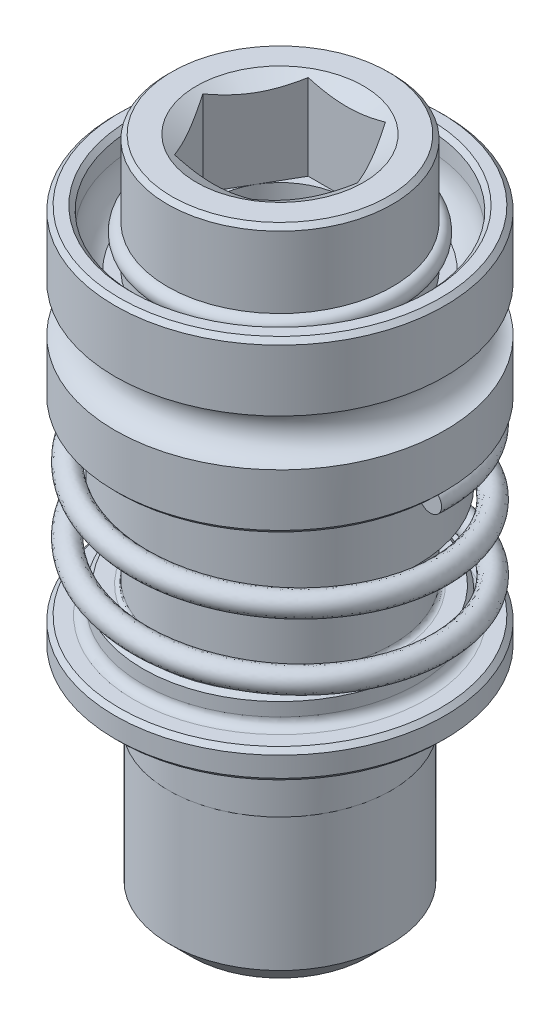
ISO-10303-21;
HEADER;
FILE_DESCRIPTION(('STEP AP214'),'2;1');
FILE_NAME('part.step','',(''),(''),'','','');
FILE_SCHEMA(('AUTOMOTIVE_DESIGN { 1 0 10303 214 1 1 1 1 }'));
ENDSEC;
DATA;
#1=APPLICATION_CONTEXT('core data for automotive mechanical design processes');
#2=APPLICATION_PROTOCOL_DEFINITION('international standard','automotive_design',2000,#1);
#3=PRODUCT_CONTEXT('',#1,'mechanical');
#4=PRODUCT('Part','Part','',(#3));
#5=PRODUCT_RELATED_PRODUCT_CATEGORY('part','',(#4));
#6=PRODUCT_DEFINITION_FORMATION('','',#4);
#7=PRODUCT_DEFINITION_CONTEXT('part definition',#1,'design');
#8=PRODUCT_DEFINITION('design','',#6,#7);
#9=PRODUCT_DEFINITION_SHAPE('','',#8);
#10=(LENGTH_UNIT() NAMED_UNIT(*) SI_UNIT(.MILLI.,.METRE.));
#11=(NAMED_UNIT(*) PLANE_ANGLE_UNIT() SI_UNIT($,.RADIAN.));
#12=(NAMED_UNIT(*) SI_UNIT($,.STERADIAN.) SOLID_ANGLE_UNIT());
#13=UNCERTAINTY_MEASURE_WITH_UNIT(LENGTH_MEASURE(1.E-05),#10,'distance_accuracy_value','');
#14=(GEOMETRIC_REPRESENTATION_CONTEXT(3) GLOBAL_UNCERTAINTY_ASSIGNED_CONTEXT((#13)) GLOBAL_UNIT_ASSIGNED_CONTEXT((#10,
#11,#12)) REPRESENTATION_CONTEXT('',''));
#15=CARTESIAN_POINT('',(0.,0.,0.));
#16=DIRECTION('',(0.,0.,1.));
#17=DIRECTION('',(1.,0.,0.));
#18=AXIS2_PLACEMENT_3D('',#15,#16,#17);
#19=CARTESIAN_POINT('',(0.,-18.3,0.));
#20=DIRECTION('',(0.,1.,0.));
#21=DIRECTION('',(0.,0.,1.));
#22=AXIS2_PLACEMENT_3D('',#19,#20,#21);
#23=TOROIDAL_SURFACE('',#22,6.55,0.4);
#24=CARTESIAN_POINT('',(0.,-18.3,0.));
#25=DIRECTION('',(0.,1.,0.));
#26=DIRECTION('',(0.,0.,1.));
#27=AXIS2_PLACEMENT_3D('',#24,#25,#26);
#28=CIRCLE('',#27,6.15);
#29=CARTESIAN_POINT('',(0.,-18.3,6.15));
#30=VERTEX_POINT('',#29);
#31=EDGE_CURVE('E1127',#30,#30,#28,.T.);
#32=ORIENTED_EDGE('',*,*,#31,.F.);
#33=EDGE_LOOP('',(#32));
#34=FACE_BOUND('',#33,.T.);
#35=CARTESIAN_POINT('',(-6.55,-18.3,0.));
#36=DIRECTION('',(0.,0.,-1.));
#37=DIRECTION('',(-1.,0.,0.));
#38=AXIS2_PLACEMENT_3D('',#35,#36,#37);
#39=CIRCLE('',#38,0.4);
#40=CARTESIAN_POINT('',(-6.55,-18.7,0.));
#41=VERTEX_POINT('',#40);
#42=CARTESIAN_POINT('',(-6.53113876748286,-18.6995550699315,0.));
#43=VERTEX_POINT('',#42);
#44=EDGE_CURVE('E150',#41,#43,#39,.F.);
#45=ORIENTED_EDGE('',*,*,#44,.F.);
#46=CARTESIAN_POINT('',(0.,-18.7,0.));
#47=DIRECTION('',(0.,1.,0.));
#48=DIRECTION('',(0.,0.,1.));
#49=AXIS2_PLACEMENT_3D('',#46,#47,#48);
#50=CIRCLE('',#49,6.55);
#51=CARTESIAN_POINT('',(-6.54892987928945,-18.7,-0.118395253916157));
#52=VERTEX_POINT('',#51);
#53=EDGE_CURVE('E153',#52,#41,#50,.F.);
#54=ORIENTED_EDGE('',*,*,#53,.F.);
#55=CARTESIAN_POINT('',(-6.53113876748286,-18.6995550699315,0.));
#56=CARTESIAN_POINT('',(-6.53426674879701,-18.6997030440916,-0.019707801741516));
#57=CARTESIAN_POINT('',(-6.5373133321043,-18.6998141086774,-0.0394279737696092));
#58=CARTESIAN_POINT('',(-6.54324370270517,-18.6999624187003,-0.0788930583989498));
#59=CARTESIAN_POINT('',(-6.54612748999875,-18.6999996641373,-0.0986379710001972));
#60=CARTESIAN_POINT('',(-6.54892987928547,-18.7,-0.118395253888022));
#61=B_SPLINE_CURVE_WITH_KNOTS('',3,(#55,#56,#57,#58,#59,#60),.UNSPECIFIED.,.F.,.F.,(4,2,4),(0.,
0.0598632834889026,0.119726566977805),.UNSPECIFIED.);
#62=EDGE_CURVE('E36',#43,#52,#61,.T.);
#63=ORIENTED_EDGE('',*,*,#62,.F.);
#64=EDGE_LOOP('',(#45,#54,#63));
#65=FACE_BOUND('',#64,.T.);
#66=ADVANCED_FACE('F15',(#34,#65),#23,.F.);
#67=CARTESIAN_POINT('',(5.05,-18.7,0.));
#68=DIRECTION('',(0.,1.,0.));
#69=DIRECTION('',(0.,0.,1.));
#70=AXIS2_PLACEMENT_3D('',#67,#68,#69);
#71=PLANE('',#70);
#72=CARTESIAN_POINT('',(0.,-18.7,0.));
#73=DIRECTION('',(0.,1.,0.));
#74=DIRECTION('',(0.,0.,1.));
#75=AXIS2_PLACEMENT_3D('',#72,#73,#74);
#76=CIRCLE('',#75,7.2);
#77=CARTESIAN_POINT('',(0.,-18.7,7.2));
#78=VERTEX_POINT('',#77);
#79=EDGE_CURVE('E497',#78,#78,#76,.T.);
#80=ORIENTED_EDGE('',*,*,#79,.T.);
#81=EDGE_LOOP('',(#80));
#82=FACE_BOUND('',#81,.T.);
#83=ORIENTED_EDGE('',*,*,#53,.T.);
#84=DIRECTION('',(-1.,0.,0.));
#85=VECTOR('',#84,1.);
#86=CARTESIAN_POINT('',(5.05,-18.7,0.));
#87=LINE('',#86,#85);
#88=CARTESIAN_POINT('',(-6.96794494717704,-18.7,0.));
#89=VERTEX_POINT('',#88);
#90=EDGE_CURVE('E23',#41,#89,#87,.T.);
#91=ORIENTED_EDGE('',*,*,#90,.T.);
#92=CARTESIAN_POINT('',(-6.96794494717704,-18.7,0.));
#93=CARTESIAN_POINT('',(-6.96460479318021,-18.7,-0.0247344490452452));
#94=CARTESIAN_POINT('',(-6.96103490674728,-18.7,-0.04943873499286));
#95=CARTESIAN_POINT('',(-6.95339273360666,-18.7,-0.0988094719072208));
#96=CARTESIAN_POINT('',(-6.94931965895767,-18.7,-0.123475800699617));
#97=CARTESIAN_POINT('',(-6.94063560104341,-18.7,-0.172731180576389));
#98=CARTESIAN_POINT('',(-6.93602425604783,-18.7000000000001,-0.197320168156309));
#99=CARTESIAN_POINT('',(-6.92605094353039,-18.6999999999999,-0.247193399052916));
#100=CARTESIAN_POINT('',(-6.92066917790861,-18.6999999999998,-0.272473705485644));
#101=CARTESIAN_POINT('',(-6.90920047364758,-18.7000000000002,-0.322860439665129));
#102=CARTESIAN_POINT('',(-6.90311391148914,-18.7000000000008,-0.347966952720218));
#103=CARTESIAN_POINT('',(-6.89011942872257,-18.6999999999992,-0.397951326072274));
#104=CARTESIAN_POINT('',(-6.88321205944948,-18.699999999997,-0.422829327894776));
#105=CARTESIAN_POINT('',(-6.87028808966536,-18.6999999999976,-0.465917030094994));
#106=CARTESIAN_POINT('',(-6.86449975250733,-18.6999999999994,-0.484195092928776));
#107=CARTESIAN_POINT('',(-6.85222613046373,-18.7000000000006,-0.520541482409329));
#108=CARTESIAN_POINT('',(-6.84574011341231,-18.7000000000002,-0.538609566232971));
#109=CARTESIAN_POINT('',(-6.83190262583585,-18.6999999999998,-0.574277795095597));
#110=CARTESIAN_POINT('',(-6.82455696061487,-18.7,-0.591880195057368));
#111=CARTESIAN_POINT('',(-6.80860161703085,-18.7,-0.626494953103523));
#112=CARTESIAN_POINT('',(-6.79999470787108,-18.7,-0.643508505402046));
#113=CARTESIAN_POINT('',(-6.78538942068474,-18.7,-0.668086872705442));
#114=CARTESIAN_POINT('',(-6.78022283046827,-18.7,-0.67614239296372));
#115=CARTESIAN_POINT('',(-6.7690400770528,-18.7,-0.691677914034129));
#116=CARTESIAN_POINT('',(-6.76302441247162,-18.7,-0.699158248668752));
#117=CARTESIAN_POINT('',(-6.75292848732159,-18.7,-0.709414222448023));
#118=CARTESIAN_POINT('',(-6.74936427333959,-18.7,-0.712685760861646));
#119=CARTESIAN_POINT('',(-6.74178009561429,-18.7,-0.718628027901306));
#120=CARTESIAN_POINT('',(-6.73776299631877,-18.7,-0.721302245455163));
#121=CARTESIAN_POINT('',(-6.72944503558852,-18.7,-0.725464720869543));
#122=CARTESIAN_POINT('',(-6.72518129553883,-18.7,-0.727020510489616));
#123=CARTESIAN_POINT('',(-6.71628459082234,-18.7,-0.728561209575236));
#124=CARTESIAN_POINT('',(-6.71164881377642,-18.7,-0.728532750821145));
#125=CARTESIAN_POINT('',(-6.70328083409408,-18.7,-0.72679333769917));
#126=CARTESIAN_POINT('',(-6.69950577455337,-18.7,-0.725273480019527));
#127=CARTESIAN_POINT('',(-6.69063089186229,-18.7,-0.720255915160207));
#128=CARTESIAN_POINT('',(-6.68591424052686,-18.7,-0.716133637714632));
#129=CARTESIAN_POINT('',(-6.67658688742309,-18.7,-0.706035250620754));
#130=CARTESIAN_POINT('',(-6.67223232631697,-18.7,-0.699850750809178));
#131=CARTESIAN_POINT('',(-6.66438125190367,-18.7,-0.686924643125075));
#132=CARTESIAN_POINT('',(-6.66089125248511,-18.7,-0.680179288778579));
#133=CARTESIAN_POINT('',(-6.65148578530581,-18.7,-0.660030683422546));
#134=CARTESIAN_POINT('',(-6.64634006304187,-18.7,-0.646279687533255));
#135=CARTESIAN_POINT('',(-6.63708525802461,-18.7,-0.618426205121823));
#136=CARTESIAN_POINT('',(-6.63297899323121,-18.7,-0.604322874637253));
#137=CARTESIAN_POINT('',(-6.62540237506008,-18.7,-0.575891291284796));
#138=CARTESIAN_POINT('',(-6.62193437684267,-18.7,-0.56156240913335));
#139=CARTESIAN_POINT('',(-6.61543082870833,-18.7,-0.53283134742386));
#140=CARTESIAN_POINT('',(-6.61239467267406,-18.7,-0.518429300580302));
#141=CARTESIAN_POINT('',(-6.60383390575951,-18.7,-0.475693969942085));
#142=CARTESIAN_POINT('',(-6.59872308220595,-18.7,-0.447278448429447));
#143=CARTESIAN_POINT('',(-6.58907313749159,-18.7,-0.3903316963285));
#144=CARTESIAN_POINT('',(-6.58453447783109,-18.7,-0.36180039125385));
#145=CARTESIAN_POINT('',(-6.57576492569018,-18.7,-0.304674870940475));
#146=CARTESIAN_POINT('',(-6.57153420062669,-18.7,-0.276080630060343));
#147=CARTESIAN_POINT('',(-6.56337692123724,-18.7,-0.219965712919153));
#148=CARTESIAN_POINT('',(-6.55944492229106,-18.7,-0.192445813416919));
#149=CARTESIAN_POINT('',(-6.55162121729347,-18.7,-0.137417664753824));
#150=CARTESIAN_POINT('',(-6.54772948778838,-18.7,-0.10990941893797));
#151=CARTESIAN_POINT('',(-6.53992507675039,-18.7,-0.0549319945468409));
#152=CARTESIAN_POINT('',(-6.53601242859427,-18.7,-0.0274628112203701));
#153=CARTESIAN_POINT('',(-6.53205505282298,-18.7,0.));
#154=B_SPLINE_CURVE_WITH_KNOTS('',3,(#92,#93,#94,#95,#96,#97,#98,#99,#100,#101,#102,#103,#104,
#105,#106,#107,#108,#109,#110,#111,#112,#113,#114,#115,#116,#117,#118,#119,#120,#121,#122,#123,
#124,#125,#126,#127,#128,#129,#130,#131,#132,#133,#134,#135,#136,#137,#138,#139,#140,#141,#142,
#143,#144,#145,#146,#147,#148,#149,#150,#151,#152,#153),.UNSPECIFIED.,.F.,.F.,(4,2,2,2,2,2,2,2,
2,2,2,2,2,2,2,2,2,2,2,2,2,2,2,2,2,2,2,2,2,2,4),(0.,0.0748770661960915,0.149872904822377,
0.224919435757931,0.302450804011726,0.379940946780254,0.457379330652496,0.514887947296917,
0.572457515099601,0.629658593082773,0.686735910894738,0.715424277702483,0.744095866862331,
0.758574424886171,0.772966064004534,0.786392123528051,0.799931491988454,0.811936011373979,
0.830413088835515,0.852993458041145,0.875739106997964,0.919676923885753,0.9637326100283,
1.0079477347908,1.05210017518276,1.1386994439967,1.22536812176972,1.31208357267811,
1.39548173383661,1.47882822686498,1.56206754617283),.UNSPECIFIED.);
#155=EDGE_CURVE('E137',#89,#52,#154,.T.);
#156=ORIENTED_EDGE('',*,*,#155,.T.);
#157=EDGE_LOOP('',(#83,#91,#156));
#158=FACE_BOUND('',#157,.T.);
#159=ADVANCED_FACE('F152',(#82,#158),#71,.T.);
#160=CARTESIAN_POINT('',(1.25,-33.5,-4.29651136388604));
#161=DIRECTION('',(1.,0.,0.));
#162=DIRECTION('',(0.,0.,-1.));
#163=AXIS2_PLACEMENT_3D('',#160,#161,#162);
#164=PLANE('',#163);
#165=DIRECTION('',(0.,0.,1.));
#166=VECTOR('',#165,1.);
#167=CARTESIAN_POINT('',(1.25,-28.2013311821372,-4.29651136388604));
#168=LINE('',#167,#166);
#169=CARTESIAN_POINT('',(1.25,-28.2013311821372,-3.26917420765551));
#170=VERTEX_POINT('',#169);
#171=CARTESIAN_POINT('',(1.25,-28.2013311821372,-3.23893291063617));
#172=VERTEX_POINT('',#171);
#173=EDGE_CURVE('E1195',#170,#172,#168,.T.);
#174=ORIENTED_EDGE('',*,*,#173,.F.);
#175=DIRECTION('',(0.,1.,0.));
#176=VECTOR('',#175,1.);
#177=CARTESIAN_POINT('',(1.25,0.,-3.26917420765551));
#178=LINE('',#177,#176);
#179=CARTESIAN_POINT('',(1.25,-28.8,-3.26917420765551));
#180=VERTEX_POINT('',#179);
#181=EDGE_CURVE('E724',#180,#170,#178,.T.);
#182=ORIENTED_EDGE('',*,*,#181,.F.);
#183=CARTESIAN_POINT('',(1.25,-28.5976171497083,-3.57123064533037));
#184=CARTESIAN_POINT('',(1.25,-28.6133900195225,-3.5654790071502));
#185=CARTESIAN_POINT('',(1.25,-28.6286741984,-3.55834027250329));
#186=CARTESIAN_POINT('',(1.25,-28.6578161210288,-3.54155435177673));
#187=CARTESIAN_POINT('',(1.25,-28.6716713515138,-3.53190284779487));
#188=CARTESIAN_POINT('',(1.25,-28.6975488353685,-3.51046172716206));
#189=CARTESIAN_POINT('',(1.25,-28.7095759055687,-3.49867791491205));
#190=CARTESIAN_POINT('',(1.25,-28.731568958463,-3.47333440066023));
#191=CARTESIAN_POINT('',(1.25,-28.7415354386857,-3.45977512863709));
#192=CARTESIAN_POINT('',(1.25,-28.7595816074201,-3.43068951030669));
#193=CARTESIAN_POINT('',(1.25,-28.7675687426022,-3.4151058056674));
#194=CARTESIAN_POINT('',(1.25,-28.7809772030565,-3.382871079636));
#195=CARTESIAN_POINT('',(1.25,-28.7863977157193,-3.36621972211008));
#196=CARTESIAN_POINT('',(1.25,-28.7948348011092,-3.33129450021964));
#197=CARTESIAN_POINT('',(1.25,-28.7976938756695,-3.31298252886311));
#198=CARTESIAN_POINT('',(1.25,-28.8004273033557,-3.27613615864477));
#199=CARTESIAN_POINT('',(1.25,-28.800300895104,-3.25760170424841));
#200=CARTESIAN_POINT('',(1.25,-28.7970184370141,-3.22005246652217));
#201=CARTESIAN_POINT('',(1.25,-28.7937413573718,-3.20104814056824));
#202=CARTESIAN_POINT('',(1.25,-28.7840509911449,-3.16385261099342));
#203=CARTESIAN_POINT('',(1.25,-28.7776373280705,-3.14566150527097));
#204=CARTESIAN_POINT('',(1.25,-28.761787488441,-3.11061259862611));
#205=CARTESIAN_POINT('',(1.25,-28.7523472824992,-3.09375661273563));
#206=CARTESIAN_POINT('',(1.25,-28.7306395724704,-3.06196963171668));
#207=CARTESIAN_POINT('',(1.25,-28.7183726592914,-3.04703823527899));
#208=CARTESIAN_POINT('',(1.25,-28.6919401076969,-3.02032020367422));
#209=CARTESIAN_POINT('',(1.25,-28.6778908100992,-3.0084187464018));
#210=CARTESIAN_POINT('',(1.25,-28.6478530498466,-2.98738212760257));
#211=CARTESIAN_POINT('',(1.25,-28.6318656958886,-2.97824539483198));
#212=CARTESIAN_POINT('',(1.25,-28.5997447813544,-2.96375810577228));
#213=CARTESIAN_POINT('',(1.25,-28.5837189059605,-2.95816870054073));
#214=CARTESIAN_POINT('',(1.25,-28.5509232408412,-2.94996997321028));
#215=CARTESIAN_POINT('',(1.25,-28.5341538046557,-2.94735925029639));
#216=CARTESIAN_POINT('',(1.25,-28.5015118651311,-2.94531155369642));
#217=CARTESIAN_POINT('',(1.25,-28.4856512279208,-2.94568083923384));
#218=CARTESIAN_POINT('',(1.25,-28.4542272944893,-2.94911873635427));
#219=CARTESIAN_POINT('',(1.25,-28.4386639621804,-2.95218701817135));
#220=CARTESIAN_POINT('',(1.25,-28.4084841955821,-2.9608311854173));
#221=CARTESIAN_POINT('',(1.25,-28.3938577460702,-2.96637232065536));
#222=CARTESIAN_POINT('',(1.25,-28.365690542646,-2.97973723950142));
#223=CARTESIAN_POINT('',(1.25,-28.3521499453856,-2.98756135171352));
#224=CARTESIAN_POINT('',(1.25,-28.3259278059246,-3.00558443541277));
#225=CARTESIAN_POINT('',(1.25,-28.3133043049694,-3.01586767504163));
#226=CARTESIAN_POINT('',(1.25,-28.2898183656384,-3.03827710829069));
#227=CARTESIAN_POINT('',(1.25,-28.2789564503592,-3.05040384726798));
#228=CARTESIAN_POINT('',(1.25,-28.258473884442,-3.0770816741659));
#229=CARTESIAN_POINT('',(1.25,-28.2489986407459,-3.09174438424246));
#230=CARTESIAN_POINT('',(1.25,-28.2324580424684,-3.12237072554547));
#231=CARTESIAN_POINT('',(1.25,-28.2253934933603,-3.1383347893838));
#232=CARTESIAN_POINT('',(1.25,-28.2133883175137,-3.17229268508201));
#233=CARTESIAN_POINT('',(1.25,-28.2086283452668,-3.19035053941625));
#234=CARTESIAN_POINT('',(1.25,-28.2020861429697,-3.22699935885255));
#235=CARTESIAN_POINT('',(1.25,-28.2003046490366,-3.24559045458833));
#236=CARTESIAN_POINT('',(1.25,-28.1997572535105,-3.2835051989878));
#237=CARTESIAN_POINT('',(1.25,-28.2011047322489,-3.30283063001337));
#238=CARTESIAN_POINT('',(1.25,-28.2070531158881,-3.34097756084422));
#239=CARTESIAN_POINT('',(1.25,-28.2116541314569,-3.35979904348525));
#240=CARTESIAN_POINT('',(1.25,-28.22398757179,-3.39619886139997));
#241=CARTESIAN_POINT('',(1.25,-28.2316909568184,-3.41378699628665));
#242=CARTESIAN_POINT('',(1.25,-28.2500823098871,-3.44733041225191));
#243=CARTESIAN_POINT('',(1.25,-28.2607695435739,-3.4632860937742));
#244=CARTESIAN_POINT('',(1.25,-28.2843060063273,-3.4922851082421));
#245=CARTESIAN_POINT('',(1.25,-28.2970296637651,-3.5054302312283));
#246=CARTESIAN_POINT('',(1.25,-28.3246290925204,-3.52922530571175));
#247=CARTESIAN_POINT('',(1.25,-28.3395039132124,-3.53987635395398));
#248=CARTESIAN_POINT('',(1.25,-28.3699961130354,-3.55768828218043));
#249=CARTESIAN_POINT('',(1.25,-28.3855118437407,-3.56502328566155));
#250=CARTESIAN_POINT('',(1.25,-28.4176016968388,-3.57683279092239));
#251=CARTESIAN_POINT('',(1.25,-28.4341757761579,-3.58130740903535));
#252=CARTESIAN_POINT('',(1.25,-28.4670391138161,-3.58706887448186));
#253=CARTESIAN_POINT('',(1.25,-28.4833034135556,-3.58849935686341));
#254=CARTESIAN_POINT('',(1.25,-28.5158196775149,-3.58854671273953));
#255=CARTESIAN_POINT('',(1.25,-28.5320716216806,-3.58716795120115));
#256=CARTESIAN_POINT('',(1.25,-28.5565076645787,-3.58296832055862));
#257=CARTESIAN_POINT('',(1.25,-28.5648736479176,-3.58113735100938));
#258=CARTESIAN_POINT('',(1.25,-28.5814078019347,-3.57673461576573));
#259=CARTESIAN_POINT('',(1.25,-28.5895759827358,-3.57416288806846));
#260=CARTESIAN_POINT('',(1.25,-28.5976171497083,-3.57123064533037));
#261=B_SPLINE_CURVE_WITH_KNOTS('',3,(#183,#184,#185,#186,#187,#188,#189,#190,#191,#192,#193,
#194,#195,#196,#197,#198,#199,#200,#201,#202,#203,#204,#205,#206,#207,#208,#209,#210,#211,#212,
#213,#214,#215,#216,#217,#218,#219,#220,#221,#222,#223,#224,#225,#226,#227,#228,#229,#230,#231,
#232,#233,#234,#235,#236,#237,#238,#239,#240,#241,#242,#243,#244,#245,#246,#247,#248,#249,#250,
#251,#252,#253,#254,#255,#256,#257,#258,#259,#260),.UNSPECIFIED.,.T.,.F.,(4,2,2,2,2,2,2,2,2,2,2,
2,2,2,2,2,2,2,2,2,2,2,2,2,2,2,2,2,2,2,2,2,2,2,2,2,2,2,4),(0.,0.0503332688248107,
0.100753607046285,0.151038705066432,0.201311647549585,0.253616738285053,0.305938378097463,
0.361291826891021,0.416659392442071,0.474242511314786,0.531832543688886,0.589499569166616,
0.64715455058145,0.702099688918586,0.757013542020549,0.807664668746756,0.858291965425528,
0.905655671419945,0.953013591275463,0.999725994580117,1.04644512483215,1.09508112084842,
1.14373153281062,1.19588005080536,1.24804597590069,1.3038192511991,1.35960630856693,
1.41744622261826,1.47528810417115,1.53260069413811,1.58989919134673,1.64449833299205,
1.6990734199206,1.7502980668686,1.8015206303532,1.85026720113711,1.89893808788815,
1.92459980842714,1.95026021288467),.UNSPECIFIED.);
#262=EDGE_CURVE('E727',#180,#172,#261,.T.);
#263=ORIENTED_EDGE('',*,*,#262,.T.);
#264=EDGE_LOOP('',(#174,#182,#263));
#265=FACE_BOUND('',#264,.T.);
#266=ADVANCED_FACE('F743',(#265),#164,.F.);
#267=CARTESIAN_POINT('',(-1.25,-33.5,-4.29651136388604));
#268=DIRECTION('',(-1.,0.,0.));
#269=DIRECTION('',(0.,0.,1.));
#270=AXIS2_PLACEMENT_3D('',#267,#268,#269);
#271=PLANE('',#270);
#272=DIRECTION('',(0.,0.,-1.));
#273=VECTOR('',#272,1.);
#274=CARTESIAN_POINT('',(-1.25,-28.2013311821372,-4.29651136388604));
#275=LINE('',#274,#273);
#276=CARTESIAN_POINT('',(-1.25,-28.2013311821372,-3.23893291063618));
#277=VERTEX_POINT('',#276);
#278=CARTESIAN_POINT('',(-1.25,-28.2013311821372,-3.26917420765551));
#279=VERTEX_POINT('',#278);
#280=EDGE_CURVE('E322',#277,#279,#275,.T.);
#281=ORIENTED_EDGE('',*,*,#280,.F.);
#282=CARTESIAN_POINT('',(-1.25,-28.5976171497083,-3.57123064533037));
#283=CARTESIAN_POINT('',(-1.25,-28.5825945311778,-3.57670698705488));
#284=CARTESIAN_POINT('',(-1.25,-28.5671059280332,-3.58093401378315));
#285=CARTESIAN_POINT('',(-1.25,-28.5356282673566,-3.58672920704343));
#286=CARTESIAN_POINT('',(-1.25,-28.5196387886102,-3.58829507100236));
#287=CARTESIAN_POINT('',(-1.25,-28.4876259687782,-3.58870510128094));
#288=CARTESIAN_POINT('',(-1.25,-28.4716026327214,-3.5875496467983));
#289=CARTESIAN_POINT('',(-1.25,-28.4399826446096,-3.58256067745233));
#290=CARTESIAN_POINT('',(-1.25,-28.4243859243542,-3.57872759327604));
#291=CARTESIAN_POINT('',(-1.25,-28.3940590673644,-3.56852699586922));
#292=CARTESIAN_POINT('',(-1.25,-28.3793283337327,-3.56216125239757));
#293=CARTESIAN_POINT('',(-1.25,-28.3511027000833,-3.5471150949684));
#294=CARTESIAN_POINT('',(-1.25,-28.3376079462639,-3.53843440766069));
#295=CARTESIAN_POINT('',(-1.25,-28.3117989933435,-3.51875151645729));
#296=CARTESIAN_POINT('',(-1.25,-28.2995312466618,-3.50768849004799));
#297=CARTESIAN_POINT('',(-1.25,-28.2769152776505,-3.48375135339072));
#298=CARTESIAN_POINT('',(-1.25,-28.2665674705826,-3.47087685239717));
#299=CARTESIAN_POINT('',(-1.25,-28.2475074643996,-3.44297522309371));
#300=CARTESIAN_POINT('',(-1.25,-28.238908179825,-3.4278710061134));
#301=CARTESIAN_POINT('',(-1.25,-28.2242072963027,-3.39649361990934));
#302=CARTESIAN_POINT('',(-1.25,-28.2181063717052,-3.380220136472));
#303=CARTESIAN_POINT('',(-1.25,-28.2082111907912,-3.34595566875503));
#304=CARTESIAN_POINT('',(-1.25,-28.2045719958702,-3.32791985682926));
#305=CARTESIAN_POINT('',(-1.25,-28.2002329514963,-3.29149742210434));
#306=CARTESIAN_POINT('',(-1.25,-28.199533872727,-3.27311070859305));
#307=CARTESIAN_POINT('',(-1.25,-28.2011018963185,-3.2356549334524));
#308=CARTESIAN_POINT('',(-1.25,-28.2035002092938,-3.2165912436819));
#309=CARTESIAN_POINT('',(-1.25,-28.2114346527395,-3.17912481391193));
#310=CARTESIAN_POINT('',(-1.25,-28.21697125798,-3.16072217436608));
#311=CARTESIAN_POINT('',(-1.25,-28.2311291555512,-3.12497540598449));
#312=CARTESIAN_POINT('',(-1.25,-28.2397738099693,-3.1076404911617));
#313=CARTESIAN_POINT('',(-1.25,-28.2599676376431,-3.07474806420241));
#314=CARTESIAN_POINT('',(-1.25,-28.2715163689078,-3.05919028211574));
#315=CARTESIAN_POINT('',(-1.25,-28.2967309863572,-3.03101562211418));
#316=CARTESIAN_POINT('',(-1.25,-28.3102917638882,-3.01830492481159));
#317=CARTESIAN_POINT('',(-1.25,-28.3395043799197,-2.99556669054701));
#318=CARTESIAN_POINT('',(-1.25,-28.355155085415,-2.98553770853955));
#319=CARTESIAN_POINT('',(-1.25,-28.3868301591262,-2.96927058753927));
#320=CARTESIAN_POINT('',(-1.25,-28.4027367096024,-2.96280308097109));
#321=CARTESIAN_POINT('',(-1.25,-28.4354574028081,-2.95285669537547));
#322=CARTESIAN_POINT('',(-1.25,-28.4522710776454,-2.94937629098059));
#323=CARTESIAN_POINT('',(-1.25,-28.4850738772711,-2.94570509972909));
#324=CARTESIAN_POINT('',(-1.25,-28.5010397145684,-2.94530365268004));
#325=CARTESIAN_POINT('',(-1.25,-28.532800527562,-2.94725315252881));
#326=CARTESIAN_POINT('',(-1.25,-28.5485955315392,-2.94960363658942));
#327=CARTESIAN_POINT('',(-1.25,-28.5792163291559,-2.95687252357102));
#328=CARTESIAN_POINT('',(-1.25,-28.5940557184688,-2.96173408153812));
#329=CARTESIAN_POINT('',(-1.25,-28.6227475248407,-2.97379837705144));
#330=CARTESIAN_POINT('',(-1.25,-28.6365998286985,-2.98100138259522));
#331=CARTESIAN_POINT('',(-1.25,-28.6634540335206,-2.99777660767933));
#332=CARTESIAN_POINT('',(-1.25,-28.6764101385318,-3.00742195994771));
#333=CARTESIAN_POINT('',(-1.25,-28.700652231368,-3.02861960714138));
#334=CARTESIAN_POINT('',(-1.25,-28.711937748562,-3.04017243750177));
#335=CARTESIAN_POINT('',(-1.25,-28.7333548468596,-3.06570768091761));
#336=CARTESIAN_POINT('',(-1.25,-28.7433515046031,-3.0798032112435));
#337=CARTESIAN_POINT('',(-1.25,-28.7610225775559,-3.1093808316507));
#338=CARTESIAN_POINT('',(-1.25,-28.768696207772,-3.12486338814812));
#339=CARTESIAN_POINT('',(-1.25,-28.7820581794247,-3.15796075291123));
#340=CARTESIAN_POINT('',(-1.25,-28.7875652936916,-3.17564886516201));
#341=CARTESIAN_POINT('',(-1.25,-28.7956689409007,-3.21168096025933));
#342=CARTESIAN_POINT('',(-1.25,-28.7982646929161,-3.23002511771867));
#343=CARTESIAN_POINT('',(-1.25,-28.8005345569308,-3.26768062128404));
#344=CARTESIAN_POINT('',(-1.25,-28.8000796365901,-3.28699990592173));
#345=CARTESIAN_POINT('',(-1.25,-28.7959264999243,-3.32528915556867));
#346=CARTESIAN_POINT('',(-1.25,-28.7922281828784,-3.34425910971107));
#347=CARTESIAN_POINT('',(-1.25,-28.7816490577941,-3.3812342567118));
#348=CARTESIAN_POINT('',(-1.25,-28.7747775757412,-3.39924210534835));
#349=CARTESIAN_POINT('',(-1.25,-28.757973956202,-3.43377851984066));
#350=CARTESIAN_POINT('',(-1.25,-28.7480416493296,-3.45030700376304));
#351=CARTESIAN_POINT('',(-1.25,-28.7258282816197,-3.48063104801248));
#352=CARTESIAN_POINT('',(-1.25,-28.7136651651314,-3.49451297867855));
#353=CARTESIAN_POINT('',(-1.25,-28.6870550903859,-3.5198565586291));
#354=CARTESIAN_POINT('',(-1.25,-28.6726121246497,-3.53132235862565));
#355=CARTESIAN_POINT('',(-1.25,-28.647916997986,-3.54744339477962));
#356=CARTESIAN_POINT('',(-1.25,-28.6382453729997,-3.55300527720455));
#357=CARTESIAN_POINT('',(-1.25,-28.618330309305,-3.56299055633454));
#358=CARTESIAN_POINT('',(-1.25,-28.6080868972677,-3.56741400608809));
#359=CARTESIAN_POINT('',(-1.25,-28.5976171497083,-3.57123064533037));
#360=B_SPLINE_CURVE_WITH_KNOTS('',3,(#282,#283,#284,#285,#286,#287,#288,#289,#290,#291,#292,
#293,#294,#295,#296,#297,#298,#299,#300,#301,#302,#303,#304,#305,#306,#307,#308,#309,#310,#311,
#312,#313,#314,#315,#316,#317,#318,#319,#320,#321,#322,#323,#324,#325,#326,#327,#328,#329,#330,
#331,#332,#333,#334,#335,#336,#337,#338,#339,#340,#341,#342,#343,#344,#345,#346,#347,#348,#349,
#350,#351,#352,#353,#354,#355,#356,#357,#358,#359),.UNSPECIFIED.,.T.,.F.,(4,2,2,2,2,2,2,2,2,2,2,
2,2,2,2,2,2,2,2,2,2,2,2,2,2,2,2,2,2,2,2,2,2,2,2,2,2,2,4),(0.,0.047929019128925,
0.0958994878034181,0.143863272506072,0.19181934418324,0.239741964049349,0.287670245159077,
0.33700955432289,0.38635952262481,0.438273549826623,0.490201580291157,0.545154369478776,
0.600121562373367,0.657495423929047,0.714877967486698,0.772701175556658,0.830515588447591,
0.885980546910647,0.941415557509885,0.99265726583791,1.04387279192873,1.09154994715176,
1.13921908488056,1.18585354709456,1.23249334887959,1.28074143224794,1.32900308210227,
1.38062268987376,1.43225972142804,1.48758962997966,1.54293437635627,1.60063434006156,
1.65833609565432,1.71586933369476,1.77340575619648,1.82849360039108,1.88348602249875,
1.91689085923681,1.95029413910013),.UNSPECIFIED.);
#361=CARTESIAN_POINT('',(-1.25,-28.8,-3.26917420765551));
#362=VERTEX_POINT('',#361);
#363=EDGE_CURVE('E735',#277,#362,#360,.T.);
#364=ORIENTED_EDGE('',*,*,#363,.T.);
#365=DIRECTION('',(0.,1.,0.));
#366=VECTOR('',#365,1.);
#367=CARTESIAN_POINT('',(-1.25,0.,-3.26917420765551));
#368=LINE('',#367,#366);
#369=EDGE_CURVE('E763',#279,#362,#368,.F.);
#370=ORIENTED_EDGE('',*,*,#369,.F.);
#371=EDGE_LOOP('',(#281,#364,#370));
#372=FACE_BOUND('',#371,.T.);
#373=ADVANCED_FACE('F747',(#372),#271,.F.);
#374=CARTESIAN_POINT('',(0.,-28.5,0.));
#375=DIRECTION('',(0.,-1.,0.));
#376=DIRECTION('',(0.,0.,-1.));
#377=AXIS2_PLACEMENT_3D('',#374,#375,#376);
#378=TOROIDAL_SURFACE('',#377,3.5,0.3);
#379=ORIENTED_EDGE('',*,*,#363,.F.);
#380=CARTESIAN_POINT('',(0.,-28.2013311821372,0.));
#381=DIRECTION('',(0.,-1.,0.));
#382=DIRECTION('',(0.,0.,-1.));
#383=AXIS2_PLACEMENT_3D('',#380,#381,#382);
#384=CIRCLE('',#383,3.4717699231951);
#385=EDGE_CURVE('E306',#277,#172,#384,.F.);
#386=ORIENTED_EDGE('',*,*,#385,.T.);
#387=ORIENTED_EDGE('',*,*,#262,.F.);
#388=CARTESIAN_POINT('',(0.,-28.8,0.));
#389=DIRECTION('',(0.,1.,0.));
#390=DIRECTION('',(-1.,0.,0.));
#391=AXIS2_PLACEMENT_3D('',#388,#389,#390);
#392=CIRCLE('',#391,3.5);
#393=CARTESIAN_POINT('',(3.3896551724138,-28.8,-0.871916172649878));
#394=VERTEX_POINT('',#393);
#395=EDGE_CURVE('E466',#394,#180,#392,.T.);
#396=ORIENTED_EDGE('',*,*,#395,.F.);
#397=CARTESIAN_POINT('',(0.,-28.8,0.));
#398=DIRECTION('',(0.,1.,0.));
#399=DIRECTION('',(0.,0.,1.));
#400=AXIS2_PLACEMENT_3D('',#397,#398,#399);
#401=CIRCLE('',#400,3.5);
#402=CARTESIAN_POINT('',(3.3896551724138,-28.8,0.871916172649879));
#403=VERTEX_POINT('',#402);
#404=EDGE_CURVE('E714',#403,#394,#401,.T.);
#405=ORIENTED_EDGE('',*,*,#404,.F.);
#406=EDGE_CURVE('E718',#362,#403,#401,.T.);
#407=ORIENTED_EDGE('',*,*,#406,.F.);
#408=EDGE_LOOP('',(#379,#386,#387,#396,#405,#407));
#409=FACE_BOUND('',#408,.T.);
#410=ADVANCED_FACE('F254',(#409),#378,.T.);
#411=CARTESIAN_POINT('',(0.,0.,0.));
#412=DIRECTION('',(0.,1.,0.));
#413=DIRECTION('',(0.,0.,1.));
#414=AXIS2_PLACEMENT_3D('',#411,#412,#413);
#415=CYLINDRICAL_SURFACE('',#414,3.);
#416=CARTESIAN_POINT('',(-2.6400549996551,-7.4,1.42481818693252));
#417=CARTESIAN_POINT('',(-2.64005910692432,-7.49618065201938,1.42481705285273));
#418=CARTESIAN_POINT('',(-2.64389282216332,-7.59249182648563,1.41777714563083));
#419=CARTESIAN_POINT('',(-2.65883295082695,-7.78259690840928,1.38955243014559));
#420=CARTESIAN_POINT('',(-2.6699555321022,-7.87638473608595,1.36833617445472));
#421=CARTESIAN_POINT('',(-2.69825051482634,-8.05866712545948,1.31165707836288));
#422=CARTESIAN_POINT('',(-2.71542524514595,-8.14715963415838,1.27618875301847));
#423=CARTESIAN_POINT('',(-2.75383785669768,-8.31604538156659,1.19102853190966));
#424=CARTESIAN_POINT('',(-2.77507398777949,-8.39644208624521,1.14134275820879));
#425=CARTESIAN_POINT('',(-2.81834740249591,-8.54412031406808,1.02974934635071));
#426=CARTESIAN_POINT('',(-2.84034187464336,-8.6117215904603,0.968250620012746));
#427=CARTESIAN_POINT('',(-2.88289255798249,-8.73395177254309,0.8330232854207));
#428=CARTESIAN_POINT('',(-2.90344984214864,-8.78859043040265,0.759303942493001));
#429=CARTESIAN_POINT('',(-2.93820912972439,-8.87713374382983,0.610038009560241));
#430=CARTESIAN_POINT('',(-2.95285774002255,-8.91264044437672,0.535548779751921));
#431=CARTESIAN_POINT('',(-2.97679498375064,-8.96943933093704,0.380539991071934));
#432=CARTESIAN_POINT('',(-2.9860894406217,-8.99074696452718,0.300027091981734));
#433=CARTESIAN_POINT('',(-2.99728332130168,-9.01625296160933,0.146466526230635));
#434=CARTESIAN_POINT('',(-2.99997504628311,-9.02228760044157,0.073777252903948));
#435=CARTESIAN_POINT('',(-3.00002455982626,-9.0224008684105,-0.0716017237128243));
#436=CARTESIAN_POINT('',(-2.99738427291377,-9.01648381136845,-0.144291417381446));
#437=CARTESIAN_POINT('',(-2.98735661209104,-8.99363352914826,-0.283366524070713));
#438=CARTESIAN_POINT('',(-2.98024189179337,-8.97733237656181,-0.349877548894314));
#439=CARTESIAN_POINT('',(-2.96220830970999,-8.93496137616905,-0.479149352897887));
#440=CARTESIAN_POINT('',(-2.95128911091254,-8.90889066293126,-0.541909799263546));
#441=CARTESIAN_POINT('',(-2.92610722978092,-8.84661164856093,-0.664829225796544));
#442=CARTESIAN_POINT('',(-2.91172465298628,-8.81002771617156,-0.724772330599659));
#443=CARTESIAN_POINT('',(-2.88116065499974,-8.72841374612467,-0.838071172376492));
#444=CARTESIAN_POINT('',(-2.86497856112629,-8.68338054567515,-0.891424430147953));
#445=CARTESIAN_POINT('',(-2.83035944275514,-8.58086529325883,-0.996208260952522));
#446=CARTESIAN_POINT('',(-2.81186658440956,-8.52256639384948,-1.04682033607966));
#447=CARTESIAN_POINT('',(-2.77593937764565,-8.39872570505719,-1.1386829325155));
#448=CARTESIAN_POINT('',(-2.75850554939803,-8.3331804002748,-1.17992888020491));
#449=CARTESIAN_POINT('',(-2.72422467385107,-8.18823306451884,-1.25721977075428));
#450=CARTESIAN_POINT('',(-2.70769556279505,-8.10811072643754,-1.2920578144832));
#451=CARTESIAN_POINT('',(-2.67942169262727,-7.94285273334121,-1.34971577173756));
#452=CARTESIAN_POINT('',(-2.66767873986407,-7.85771519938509,-1.37253114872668));
#453=CARTESIAN_POINT('',(-2.64943446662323,-7.67793192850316,-1.40745275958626));
#454=CARTESIAN_POINT('',(-2.64339759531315,-7.58305447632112,-1.41861683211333));
#455=CARTESIAN_POINT('',(-2.63882091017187,-7.3924975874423,-1.42711113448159));
#456=CARTESIAN_POINT('',(-2.64028240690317,-7.29681801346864,-1.42443894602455));
#457=CARTESIAN_POINT('',(-2.65066187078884,-7.10514584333,-1.40503251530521));
#458=CARTESIAN_POINT('',(-2.65974425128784,-7.00919324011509,-1.38798816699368));
#459=CARTESIAN_POINT('',(-2.68455714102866,-6.82191601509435,-1.33936267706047));
#460=CARTESIAN_POINT('',(-2.70028854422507,-6.73059201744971,-1.30777958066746));
#461=CARTESIAN_POINT('',(-2.73640257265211,-6.55616554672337,-1.23040677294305));
#462=CARTESIAN_POINT('',(-2.7567416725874,-6.4729959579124,-1.18474864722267));
#463=CARTESIAN_POINT('',(-2.7996961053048,-6.3167462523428,-1.0793183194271));
#464=CARTESIAN_POINT('',(-2.82231091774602,-6.24366383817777,-1.01954933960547));
#465=CARTESIAN_POINT('',(-2.86545283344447,-6.11467123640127,-0.890781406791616));
#466=CARTESIAN_POINT('',(-2.88602232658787,-6.05797598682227,-0.822587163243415));
#467=CARTESIAN_POINT('',(-2.92385541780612,-5.95857877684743,-0.675852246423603));
#468=CARTESIAN_POINT('',(-2.94112272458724,-5.91586107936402,-0.597323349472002));
#469=CARTESIAN_POINT('',(-2.96803840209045,-5.85106219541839,-0.4428328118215));
#470=CARTESIAN_POINT('',(-2.97837325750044,-5.82705707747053,-0.36779777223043));
#471=CARTESIAN_POINT('',(-2.9933396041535,-5.79264042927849,-0.214134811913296));
#472=CARTESIAN_POINT('',(-2.99797579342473,-5.78221770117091,-0.1355099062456));
#473=CARTESIAN_POINT('',(-3.00079419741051,-5.77586580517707,0.0137286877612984));
#474=CARTESIAN_POINT('',(-2.9996303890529,-5.77846815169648,0.0842720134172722));
#475=CARTESIAN_POINT('',(-2.99245498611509,-5.79472822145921,0.22380729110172));
#476=CARTESIAN_POINT('',(-2.98644422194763,-5.80838405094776,0.292799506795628));
#477=CARTESIAN_POINT('',(-2.97034707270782,-5.84580858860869,0.425976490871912));
#478=CARTESIAN_POINT('',(-2.96034278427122,-5.86937407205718,0.490228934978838));
#479=CARTESIAN_POINT('',(-2.93718574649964,-5.92572730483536,0.613925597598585));
#480=CARTESIAN_POINT('',(-2.92403229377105,-5.95851711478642,0.673368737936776));
#481=CARTESIAN_POINT('',(-2.89469371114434,-6.03488800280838,0.790340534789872));
#482=CARTESIAN_POINT('',(-2.87836053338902,-6.07906527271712,0.847441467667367));
#483=CARTESIAN_POINT('',(-2.84480213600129,-6.17546750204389,0.954060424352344));
#484=CARTESIAN_POINT('',(-2.82757660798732,-6.22769525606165,1.00357580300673));
#485=CARTESIAN_POINT('',(-2.7916095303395,-6.34545927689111,1.09994055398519));
#486=CARTESIAN_POINT('',(-2.7729296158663,-6.41183898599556,1.14578207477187));
#487=CARTESIAN_POINT('',(-2.73790439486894,-6.5512602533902,1.22712932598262));
#488=CARTESIAN_POINT('',(-2.72156127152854,-6.62430793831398,1.26262542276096));
#489=CARTESIAN_POINT('',(-2.69105890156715,-6.78359163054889,1.3264975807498));
#490=CARTESIAN_POINT('',(-2.6773355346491,-6.87039551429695,1.35366635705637));
#491=CARTESIAN_POINT('',(-2.65596706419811,-7.04761946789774,1.39513035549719));
#492=CARTESIAN_POINT('',(-2.6483112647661,-7.13803287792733,1.40944823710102));
#493=CARTESIAN_POINT('',(-2.64272281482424,-7.25745815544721,1.41986588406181));
#494=CARTESIAN_POINT('',(-2.64172439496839,-7.28592304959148,1.42172255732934));
#495=CARTESIAN_POINT('',(-2.64038987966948,-7.34292146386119,1.42419887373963));
#496=CARTESIAN_POINT('',(-2.64005378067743,-7.37145498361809,1.42481852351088));
#497=CARTESIAN_POINT('',(-2.6400549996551,-7.4,1.42481818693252));
#498=B_SPLINE_CURVE_WITH_KNOTS('',3,(#416,#417,#418,#419,#420,#421,#422,#423,#424,#425,#426,
#427,#428,#429,#430,#431,#432,#433,#434,#435,#436,#437,#438,#439,#440,#441,#442,#443,#444,#445,
#446,#447,#448,#449,#450,#451,#452,#453,#454,#455,#456,#457,#458,#459,#460,#461,#462,#463,#464,
#465,#466,#467,#468,#469,#470,#471,#472,#473,#474,#475,#476,#477,#478,#479,#480,#481,#482,#483,
#484,#485,#486,#487,#488,#489,#490,#491,#492,#493,#494,#495,#496,#497),.UNSPECIFIED.,.T.,.F.,(4,
2,2,2,2,2,2,2,2,2,2,2,2,2,2,2,2,2,2,2,2,2,2,2,2,2,2,2,2,2,2,2,2,2,2,2,2,2,2,2,4),(0.,
0.288436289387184,0.577514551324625,0.866704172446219,1.15576945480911,1.43620960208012,
1.71643809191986,1.96639945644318,2.21608843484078,2.43391585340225,2.651664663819,
2.85728273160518,3.06291901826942,3.27708461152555,3.4913305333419,3.72853173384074,
3.96584851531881,4.2314675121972,4.4971866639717,4.78303456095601,5.06893242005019,
5.36116173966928,5.65343036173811,5.94304546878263,6.23259450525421,6.50414456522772,
6.77538783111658,7.01240172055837,7.24922008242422,7.45998242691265,7.67070866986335,
7.87730930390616,8.08395612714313,8.30511738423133,8.52635558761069,8.77375858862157,
9.02139124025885,9.29617347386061,9.57047023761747,9.65607438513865,9.74167807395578),.UNSPECIFIED.);
#499=CARTESIAN_POINT('',(-2.6400549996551,-7.4,1.42481818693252));
#500=VERTEX_POINT('',#499);
#501=EDGE_CURVE('E242',#500,#500,#498,.T.);
#502=ORIENTED_EDGE('',*,*,#501,.F.);
#503=EDGE_LOOP('',(#502));
#504=FACE_BOUND('',#503,.T.);
#505=CARTESIAN_POINT('',(1.42481818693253,-7.4,2.64005499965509));
#506=CARTESIAN_POINT('',(1.42481705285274,-7.49618065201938,2.64005910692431));
#507=CARTESIAN_POINT('',(1.41777714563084,-7.59249182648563,2.64389282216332));
#508=CARTESIAN_POINT('',(1.3895524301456,-7.78259690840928,2.65883295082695));
#509=CARTESIAN_POINT('',(1.36833617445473,-7.87638473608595,2.6699555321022));
#510=CARTESIAN_POINT('',(1.31165707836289,-8.05866712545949,2.69825051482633));
#511=CARTESIAN_POINT('',(1.27618875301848,-8.14715963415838,2.71542524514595));
#512=CARTESIAN_POINT('',(1.19102853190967,-8.31604538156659,2.75383785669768));
#513=CARTESIAN_POINT('',(1.1413427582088,-8.39644208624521,2.77507398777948));
#514=CARTESIAN_POINT('',(1.02974934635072,-8.54412031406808,2.8183474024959));
#515=CARTESIAN_POINT('',(0.968250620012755,-8.6117215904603,2.84034187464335));
#516=CARTESIAN_POINT('',(0.833023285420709,-8.73395177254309,2.88289255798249));
#517=CARTESIAN_POINT('',(0.759303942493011,-8.78859043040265,2.90344984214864));
#518=CARTESIAN_POINT('',(0.610038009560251,-8.87713374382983,2.93820912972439));
#519=CARTESIAN_POINT('',(0.535548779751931,-8.91264044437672,2.95285774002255));
#520=CARTESIAN_POINT('',(0.380539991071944,-8.96943933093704,2.97679498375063));
#521=CARTESIAN_POINT('',(0.300027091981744,-8.99074696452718,2.9860894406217));
#522=CARTESIAN_POINT('',(0.146466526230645,-9.01625296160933,2.99728332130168));
#523=CARTESIAN_POINT('',(0.0737772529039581,-9.02228760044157,2.99997504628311));
#524=CARTESIAN_POINT('',(-0.0716017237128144,-9.0224008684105,3.00002455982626));
#525=CARTESIAN_POINT('',(-0.144291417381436,-9.01648381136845,2.99738427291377));
#526=CARTESIAN_POINT('',(-0.283366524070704,-8.99363352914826,2.98735661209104));
#527=CARTESIAN_POINT('',(-0.349877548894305,-8.97733237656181,2.98024189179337));
#528=CARTESIAN_POINT('',(-0.479149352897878,-8.93496137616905,2.96220830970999));
#529=CARTESIAN_POINT('',(-0.541909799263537,-8.90889066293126,2.95128911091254));
#530=CARTESIAN_POINT('',(-0.664829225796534,-8.84661164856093,2.92610722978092));
#531=CARTESIAN_POINT('',(-0.724772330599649,-8.81002771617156,2.91172465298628));
#532=CARTESIAN_POINT('',(-0.838071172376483,-8.72841374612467,2.88116065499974));
#533=CARTESIAN_POINT('',(-0.891424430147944,-8.68338054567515,2.8649785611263));
#534=CARTESIAN_POINT('',(-0.996208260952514,-8.58086529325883,2.83035944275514));
#535=CARTESIAN_POINT('',(-1.04682033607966,-8.52256639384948,2.81186658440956));
#536=CARTESIAN_POINT('',(-1.13868293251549,-8.39872570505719,2.77593937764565));
#537=CARTESIAN_POINT('',(-1.1799288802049,-8.3331804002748,2.75850554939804));
#538=CARTESIAN_POINT('',(-1.25721977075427,-8.18823306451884,2.72422467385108));
#539=CARTESIAN_POINT('',(-1.29205781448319,-8.10811072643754,2.70769556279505));
#540=CARTESIAN_POINT('',(-1.34971577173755,-7.94285273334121,2.67942169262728));
#541=CARTESIAN_POINT('',(-1.37253114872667,-7.85771519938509,2.66767873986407));
#542=CARTESIAN_POINT('',(-1.40745275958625,-7.67793192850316,2.64943446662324));
#543=CARTESIAN_POINT('',(-1.41861683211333,-7.58305447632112,2.64339759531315));
#544=CARTESIAN_POINT('',(-1.42711113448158,-7.3924975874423,2.63882091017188));
#545=CARTESIAN_POINT('',(-1.42443894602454,-7.29681801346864,2.64028240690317));
#546=CARTESIAN_POINT('',(-1.4050325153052,-7.10514584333,2.65066187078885));
#547=CARTESIAN_POINT('',(-1.38798816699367,-7.00919324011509,2.65974425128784));
#548=CARTESIAN_POINT('',(-1.33936267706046,-6.82191601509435,2.68455714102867));
#549=CARTESIAN_POINT('',(-1.30777958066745,-6.73059201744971,2.70028854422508));
#550=CARTESIAN_POINT('',(-1.23040677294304,-6.55616554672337,2.73640257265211));
#551=CARTESIAN_POINT('',(-1.18474864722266,-6.4729959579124,2.75674167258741));
#552=CARTESIAN_POINT('',(-1.07931831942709,-6.3167462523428,2.7996961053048));
#553=CARTESIAN_POINT('',(-1.01954933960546,-6.24366383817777,2.82231091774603));
#554=CARTESIAN_POINT('',(-0.890781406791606,-6.11467123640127,2.86545283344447));
#555=CARTESIAN_POINT('',(-0.822587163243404,-6.05797598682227,2.88602232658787));
#556=CARTESIAN_POINT('',(-0.675852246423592,-5.95857877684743,2.92385541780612));
#557=CARTESIAN_POINT('',(-0.59732334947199,-5.91586107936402,2.94112272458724));
#558=CARTESIAN_POINT('',(-0.442832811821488,-5.85106219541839,2.96803840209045));
#559=CARTESIAN_POINT('',(-0.367797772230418,-5.82705707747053,2.97837325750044));
#560=CARTESIAN_POINT('',(-0.214134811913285,-5.79264042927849,2.9933396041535));
#561=CARTESIAN_POINT('',(-0.135509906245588,-5.78221770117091,2.99797579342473));
#562=CARTESIAN_POINT('',(0.0137286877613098,-5.77586580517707,3.00079419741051));
#563=CARTESIAN_POINT('',(0.0842720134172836,-5.77846815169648,2.9996303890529));
#564=CARTESIAN_POINT('',(0.223807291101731,-5.79472822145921,2.99245498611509));
#565=CARTESIAN_POINT('',(0.292799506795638,-5.80838405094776,2.98644422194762));
#566=CARTESIAN_POINT('',(0.425976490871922,-5.84580858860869,2.97034707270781));
#567=CARTESIAN_POINT('',(0.490228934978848,-5.86937407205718,2.96034278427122));
#568=CARTESIAN_POINT('',(0.613925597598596,-5.92572730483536,2.93718574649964));
#569=CARTESIAN_POINT('',(0.673368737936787,-5.95851711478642,2.92403229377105));
#570=CARTESIAN_POINT('',(0.790340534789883,-6.03488800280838,2.89469371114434));
#571=CARTESIAN_POINT('',(0.847441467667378,-6.07906527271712,2.87836053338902));
#572=CARTESIAN_POINT('',(0.954060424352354,-6.17546750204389,2.84480213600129));
#573=CARTESIAN_POINT('',(1.00357580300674,-6.22769525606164,2.82757660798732));
#574=CARTESIAN_POINT('',(1.0999405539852,-6.34545927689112,2.7916095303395));
#575=CARTESIAN_POINT('',(1.14578207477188,-6.41183898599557,2.77292961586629));
#576=CARTESIAN_POINT('',(1.22712932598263,-6.5512602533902,2.73790439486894));
#577=CARTESIAN_POINT('',(1.26262542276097,-6.62430793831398,2.72156127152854));
#578=CARTESIAN_POINT('',(1.32649758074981,-6.78359163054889,2.69105890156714));
#579=CARTESIAN_POINT('',(1.35366635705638,-6.87039551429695,2.67733553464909));
#580=CARTESIAN_POINT('',(1.3951303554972,-7.04761946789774,2.65596706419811));
#581=CARTESIAN_POINT('',(1.40944823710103,-7.13803287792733,2.64831126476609));
#582=CARTESIAN_POINT('',(1.41986588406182,-7.25745815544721,2.64272281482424));
#583=CARTESIAN_POINT('',(1.42172255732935,-7.28592304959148,2.64172439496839));
#584=CARTESIAN_POINT('',(1.42419887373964,-7.34292146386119,2.64038987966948));
#585=CARTESIAN_POINT('',(1.42481852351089,-7.37145498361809,2.64005378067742));
#586=CARTESIAN_POINT('',(1.42481818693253,-7.4,2.64005499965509));
#587=B_SPLINE_CURVE_WITH_KNOTS('',3,(#505,#506,#507,#508,#509,#510,#511,#512,#513,#514,#515,
#516,#517,#518,#519,#520,#521,#522,#523,#524,#525,#526,#527,#528,#529,#530,#531,#532,#533,#534,
#535,#536,#537,#538,#539,#540,#541,#542,#543,#544,#545,#546,#547,#548,#549,#550,#551,#552,#553,
#554,#555,#556,#557,#558,#559,#560,#561,#562,#563,#564,#565,#566,#567,#568,#569,#570,#571,#572,
#573,#574,#575,#576,#577,#578,#579,#580,#581,#582,#583,#584,#585,#586),.UNSPECIFIED.,.T.,.F.,(4,
2,2,2,2,2,2,2,2,2,2,2,2,2,2,2,2,2,2,2,2,2,2,2,2,2,2,2,2,2,2,2,2,2,2,2,2,2,2,2,4),(0.,
0.288436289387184,0.577514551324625,0.866704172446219,1.15576945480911,1.43620960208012,
1.71643809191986,1.96639945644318,2.21608843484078,2.43391585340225,2.651664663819,
2.85728273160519,3.06291901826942,3.27708461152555,3.4913305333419,3.72853173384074,
3.96584851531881,4.2314675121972,4.4971866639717,4.78303456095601,5.06893242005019,
5.36116173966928,5.65343036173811,5.94304546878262,6.23259450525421,6.50414456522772,
6.77538783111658,7.01240172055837,7.24922008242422,7.45998242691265,7.67070866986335,
7.87730930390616,8.08395612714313,8.30511738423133,8.52635558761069,8.77375858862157,
9.02139124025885,9.29617347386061,9.57047023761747,9.65607438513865,9.74167807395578),.UNSPECIFIED.);
#588=CARTESIAN_POINT('',(1.42481818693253,-7.4,2.64005499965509));
#589=VERTEX_POINT('',#588);
#590=EDGE_CURVE('E268',#589,#589,#587,.T.);
#591=ORIENTED_EDGE('',*,*,#590,.F.);
#592=EDGE_LOOP('',(#591));
#593=FACE_BOUND('',#592,.T.);
#594=CARTESIAN_POINT('',(2.64005499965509,-7.4,-1.42481818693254));
#595=CARTESIAN_POINT('',(2.64005910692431,-7.30381934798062,-1.42481705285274));
#596=CARTESIAN_POINT('',(2.64389282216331,-7.20750817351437,-1.41777714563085));
#597=CARTESIAN_POINT('',(2.65883295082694,-7.01740309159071,-1.38955243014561));
#598=CARTESIAN_POINT('',(2.66995553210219,-6.92361526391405,-1.36833617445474));
#599=CARTESIAN_POINT('',(2.69825051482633,-6.74133287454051,-1.3116570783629));
#600=CARTESIAN_POINT('',(2.71542524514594,-6.65284036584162,-1.27618875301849));
#601=CARTESIAN_POINT('',(2.75383785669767,-6.48395461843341,-1.19102853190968));
#602=CARTESIAN_POINT('',(2.77507398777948,-6.40355791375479,-1.1413427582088));
#603=CARTESIAN_POINT('',(2.8183474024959,-6.25587968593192,-1.02974934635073));
#604=CARTESIAN_POINT('',(2.84034187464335,-6.1882784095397,-0.968250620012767));
#605=CARTESIAN_POINT('',(2.88289255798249,-6.06604822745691,-0.83302328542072));
#606=CARTESIAN_POINT('',(2.90344984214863,-6.01140956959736,-0.759303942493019));
#607=CARTESIAN_POINT('',(2.93820912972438,-5.92286625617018,-0.61003800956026));
#608=CARTESIAN_POINT('',(2.95285774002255,-5.88735955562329,-0.535548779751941));
#609=CARTESIAN_POINT('',(2.97679498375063,-5.83056066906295,-0.380539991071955));
#610=CARTESIAN_POINT('',(2.9860894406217,-5.80925303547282,-0.300027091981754));
#611=CARTESIAN_POINT('',(2.99728332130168,-5.78374703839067,-0.146466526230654));
#612=CARTESIAN_POINT('',(2.99997504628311,-5.77771239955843,-0.0737772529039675));
#613=CARTESIAN_POINT('',(3.00002455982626,-5.7775991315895,0.0716017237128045));
#614=CARTESIAN_POINT('',(2.99738427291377,-5.78351618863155,0.144291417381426));
#615=CARTESIAN_POINT('',(2.98735661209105,-5.80636647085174,0.283366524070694));
#616=CARTESIAN_POINT('',(2.98024189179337,-5.82266762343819,0.349877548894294));
#617=CARTESIAN_POINT('',(2.96220830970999,-5.86503862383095,0.479149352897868));
#618=CARTESIAN_POINT('',(2.95128911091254,-5.89110933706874,0.541909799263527));
#619=CARTESIAN_POINT('',(2.92610722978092,-5.95338835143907,0.664829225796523));
#620=CARTESIAN_POINT('',(2.91172465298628,-5.98997228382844,0.724772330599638));
#621=CARTESIAN_POINT('',(2.88116065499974,-6.07158625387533,0.838071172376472));
#622=CARTESIAN_POINT('',(2.8649785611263,-6.11661945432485,0.891424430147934));
#623=CARTESIAN_POINT('',(2.83035944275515,-6.21913470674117,0.996208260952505));
#624=CARTESIAN_POINT('',(2.81186658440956,-6.27743360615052,1.04682033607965));
#625=CARTESIAN_POINT('',(2.77593937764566,-6.40127429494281,1.13868293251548));
#626=CARTESIAN_POINT('',(2.75850554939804,-6.46681959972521,1.17992888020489));
#627=CARTESIAN_POINT('',(2.72422467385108,-6.61176693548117,1.25721977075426));
#628=CARTESIAN_POINT('',(2.70769556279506,-6.69188927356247,1.29205781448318));
#629=CARTESIAN_POINT('',(2.67942169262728,-6.8571472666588,1.34971577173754));
#630=CARTESIAN_POINT('',(2.66767873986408,-6.94228480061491,1.37253114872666));
#631=CARTESIAN_POINT('',(2.64943446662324,-7.12206807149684,1.40745275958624));
#632=CARTESIAN_POINT('',(2.64339759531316,-7.21694552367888,1.41861683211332));
#633=CARTESIAN_POINT('',(2.63882091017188,-7.4075024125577,1.42711113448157));
#634=CARTESIAN_POINT('',(2.64028240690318,-7.50318198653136,1.42443894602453));
#635=CARTESIAN_POINT('',(2.65066187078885,-7.69485415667,1.40503251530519));
#636=CARTESIAN_POINT('',(2.65974425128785,-7.79080675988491,1.38798816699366));
#637=CARTESIAN_POINT('',(2.68455714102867,-7.97808398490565,1.33936267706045));
#638=CARTESIAN_POINT('',(2.70028854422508,-8.06940798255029,1.30777958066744));
#639=CARTESIAN_POINT('',(2.73640257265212,-8.24383445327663,1.23040677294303));
#640=CARTESIAN_POINT('',(2.75674167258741,-8.3270040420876,1.18474864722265));
#641=CARTESIAN_POINT('',(2.7996961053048,-8.4832537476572,1.07931831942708));
#642=CARTESIAN_POINT('',(2.82231091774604,-8.55633616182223,1.01954933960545));
#643=CARTESIAN_POINT('',(2.86545283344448,-8.68532876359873,0.890781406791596));
#644=CARTESIAN_POINT('',(2.88602232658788,-8.74202401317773,0.822587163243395));
#645=CARTESIAN_POINT('',(2.92385541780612,-8.84142122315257,0.675852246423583));
#646=CARTESIAN_POINT('',(2.94112272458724,-8.88413892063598,0.597323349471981));
#647=CARTESIAN_POINT('',(2.96803840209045,-8.94893780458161,0.442832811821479));
#648=CARTESIAN_POINT('',(2.97837325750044,-8.97294292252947,0.367797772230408));
#649=CARTESIAN_POINT('',(2.9933396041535,-9.00735957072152,0.214134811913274));
#650=CARTESIAN_POINT('',(2.99797579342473,-9.0177822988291,0.135509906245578));
#651=CARTESIAN_POINT('',(3.00079419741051,-9.02413419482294,-0.0137286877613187));
#652=CARTESIAN_POINT('',(2.9996303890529,-9.02153184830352,-0.0842720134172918));
#653=CARTESIAN_POINT('',(2.99245498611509,-9.00527177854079,-0.22380729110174));
#654=CARTESIAN_POINT('',(2.98644422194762,-8.99161594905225,-0.292799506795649));
#655=CARTESIAN_POINT('',(2.97034707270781,-8.95419141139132,-0.425976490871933));
#656=CARTESIAN_POINT('',(2.96034278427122,-8.93062592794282,-0.490228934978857));
#657=CARTESIAN_POINT('',(2.93718574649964,-8.87427269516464,-0.613925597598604));
#658=CARTESIAN_POINT('',(2.92403229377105,-8.84148288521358,-0.673368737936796));
#659=CARTESIAN_POINT('',(2.89469371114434,-8.76511199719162,-0.790340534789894));
#660=CARTESIAN_POINT('',(2.87836053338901,-8.72093472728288,-0.847441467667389));
#661=CARTESIAN_POINT('',(2.84480213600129,-8.62453249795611,-0.954060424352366));
#662=CARTESIAN_POINT('',(2.82757660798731,-8.57230474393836,-1.00357580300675));
#663=CARTESIAN_POINT('',(2.79160953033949,-8.45454072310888,-1.09994055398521));
#664=CARTESIAN_POINT('',(2.77292961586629,-8.38816101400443,-1.14578207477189));
#665=CARTESIAN_POINT('',(2.73790439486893,-8.2487397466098,-1.22712932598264));
#666=CARTESIAN_POINT('',(2.72156127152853,-8.17569206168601,-1.26262542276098));
#667=CARTESIAN_POINT('',(2.69105890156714,-8.01640836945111,-1.32649758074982));
#668=CARTESIAN_POINT('',(2.67733553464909,-7.92960448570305,-1.35366635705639));
#669=CARTESIAN_POINT('',(2.6559670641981,-7.75238053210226,-1.39513035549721));
#670=CARTESIAN_POINT('',(2.64831126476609,-7.66196712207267,-1.40944823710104));
#671=CARTESIAN_POINT('',(2.64272281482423,-7.54254184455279,-1.41986588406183));
#672=CARTESIAN_POINT('',(2.64172439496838,-7.51407695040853,-1.42172255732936));
#673=CARTESIAN_POINT('',(2.64038987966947,-7.45707853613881,-1.42419887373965));
#674=CARTESIAN_POINT('',(2.64005378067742,-7.42854501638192,-1.4248185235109));
#675=CARTESIAN_POINT('',(2.64005499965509,-7.4,-1.42481818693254));
#676=B_SPLINE_CURVE_WITH_KNOTS('',3,(#594,#595,#596,#597,#598,#599,#600,#601,#602,#603,#604,
#605,#606,#607,#608,#609,#610,#611,#612,#613,#614,#615,#616,#617,#618,#619,#620,#621,#622,#623,
#624,#625,#626,#627,#628,#629,#630,#631,#632,#633,#634,#635,#636,#637,#638,#639,#640,#641,#642,
#643,#644,#645,#646,#647,#648,#649,#650,#651,#652,#653,#654,#655,#656,#657,#658,#659,#660,#661,
#662,#663,#664,#665,#666,#667,#668,#669,#670,#671,#672,#673,#674,#675),.UNSPECIFIED.,.T.,.F.,(4,
2,2,2,2,2,2,2,2,2,2,2,2,2,2,2,2,2,2,2,2,2,2,2,2,2,2,2,2,2,2,2,2,2,2,2,2,2,2,2,4),(0.,
0.288436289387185,0.577514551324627,0.866704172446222,1.15576945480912,1.43620960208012,
1.71643809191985,1.96639945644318,2.21608843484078,2.43391585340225,2.651664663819,
2.85728273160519,3.06291901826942,3.27708461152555,3.4913305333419,3.72853173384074,
3.96584851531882,4.2314675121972,4.4971866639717,4.78303456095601,5.06893242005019,
5.36116173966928,5.65343036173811,5.94304546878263,6.23259450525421,6.50414456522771,
6.77538783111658,7.01240172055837,7.24922008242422,7.45998242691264,7.67070866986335,
7.87730930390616,8.08395612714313,8.30511738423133,8.52635558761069,8.77375858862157,
9.02139124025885,9.29617347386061,9.57047023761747,9.65607438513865,9.74167807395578),.UNSPECIFIED.);
#677=CARTESIAN_POINT('',(2.64005499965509,-7.4,-1.42481818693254));
#678=VERTEX_POINT('',#677);
#679=EDGE_CURVE('E262',#678,#678,#676,.T.);
#680=ORIENTED_EDGE('',*,*,#679,.T.);
#681=EDGE_LOOP('',(#680));
#682=FACE_BOUND('',#681,.T.);
#683=CARTESIAN_POINT('',(0.,-4.,0.));
#684=DIRECTION('',(0.,1.,0.));
#685=DIRECTION('',(0.,0.,1.));
#686=AXIS2_PLACEMENT_3D('',#683,#684,#685);
#687=CIRCLE('',#686,3.);
#688=CARTESIAN_POINT('',(-2.59807621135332,-4.,1.5));
#689=VERTEX_POINT('',#688);
#690=CARTESIAN_POINT('',(0.,-4.,3.));
#691=VERTEX_POINT('',#690);
#692=EDGE_CURVE('E295',#689,#691,#687,.T.);
#693=ORIENTED_EDGE('',*,*,#692,.T.);
#694=CARTESIAN_POINT('',(2.59807621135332,-4.,1.5));
#695=VERTEX_POINT('',#694);
#696=EDGE_CURVE('E507',#691,#695,#687,.T.);
#697=ORIENTED_EDGE('',*,*,#696,.T.);
#698=CARTESIAN_POINT('',(2.59807621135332,-4.,-1.5));
#699=VERTEX_POINT('',#698);
#700=EDGE_CURVE('E509',#695,#699,#687,.T.);
#701=ORIENTED_EDGE('',*,*,#700,.T.);
#702=CARTESIAN_POINT('',(0.,-4.,-3.));
#703=VERTEX_POINT('',#702);
#704=EDGE_CURVE('E514',#699,#703,#687,.T.);
#705=ORIENTED_EDGE('',*,*,#704,.T.);
#706=CARTESIAN_POINT('',(-2.59807621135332,-4.,-1.5));
#707=VERTEX_POINT('',#706);
#708=EDGE_CURVE('E508',#703,#707,#687,.T.);
#709=ORIENTED_EDGE('',*,*,#708,.T.);
#710=EDGE_CURVE('E506',#707,#689,#687,.T.);
#711=ORIENTED_EDGE('',*,*,#710,.T.);
#712=EDGE_LOOP('',(#693,#697,#701,#705,#709,#711));
#713=FACE_BOUND('',#712,.T.);
#714=CARTESIAN_POINT('',(-1.42481818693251,-7.4,-2.64005499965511));
#715=CARTESIAN_POINT('',(-1.42481705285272,-7.49618065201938,-2.64005910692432));
#716=CARTESIAN_POINT('',(-1.41777714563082,-7.59249182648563,-2.64389282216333));
#717=CARTESIAN_POINT('',(-1.38955243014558,-7.78259690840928,-2.65883295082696));
#718=CARTESIAN_POINT('',(-1.36833617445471,-7.87638473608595,-2.66995553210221));
#719=CARTESIAN_POINT('',(-1.31165707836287,-8.05866712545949,-2.69825051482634));
#720=CARTESIAN_POINT('',(-1.27618875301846,-8.14715963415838,-2.71542524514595));
#721=CARTESIAN_POINT('',(-1.19102853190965,-8.31604538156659,-2.75383785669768));
#722=CARTESIAN_POINT('',(-1.14134275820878,-8.39644208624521,-2.77507398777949));
#723=CARTESIAN_POINT('',(-1.0297493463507,-8.54412031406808,-2.81834740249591));
#724=CARTESIAN_POINT('',(-0.968250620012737,-8.6117215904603,-2.84034187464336));
#725=CARTESIAN_POINT('',(-0.833023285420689,-8.73395177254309,-2.88289255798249));
#726=CARTESIAN_POINT('',(-0.75930394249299,-8.78859043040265,-2.90344984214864));
#727=CARTESIAN_POINT('',(-0.61003800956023,-8.87713374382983,-2.93820912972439));
#728=CARTESIAN_POINT('',(-0.53554877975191,-8.91264044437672,-2.95285774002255));
#729=CARTESIAN_POINT('',(-0.380539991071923,-8.96943933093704,-2.97679498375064));
#730=CARTESIAN_POINT('',(-0.300027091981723,-8.99074696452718,-2.98608944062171));
#731=CARTESIAN_POINT('',(-0.146466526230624,-9.01625296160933,-2.99728332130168));
#732=CARTESIAN_POINT('',(-0.0737772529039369,-9.02228760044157,-2.99997504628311));
#733=CARTESIAN_POINT('',(0.0716017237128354,-9.0224008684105,-3.00002455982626));
#734=CARTESIAN_POINT('',(0.144291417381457,-9.01648381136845,-2.99738427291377));
#735=CARTESIAN_POINT('',(0.283366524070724,-8.99363352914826,-2.98735661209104));
#736=CARTESIAN_POINT('',(0.349877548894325,-8.97733237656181,-2.98024189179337));
#737=CARTESIAN_POINT('',(0.479149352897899,-8.93496137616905,-2.96220830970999));
#738=CARTESIAN_POINT('',(0.541909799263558,-8.90889066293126,-2.95128911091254));
#739=CARTESIAN_POINT('',(0.664829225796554,-8.84661164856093,-2.92610722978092));
#740=CARTESIAN_POINT('',(0.72477233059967,-8.81002771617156,-2.91172465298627));
#741=CARTESIAN_POINT('',(0.838071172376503,-8.72841374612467,-2.88116065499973));
#742=CARTESIAN_POINT('',(0.891424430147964,-8.68338054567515,-2.86497856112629));
#743=CARTESIAN_POINT('',(0.996208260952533,-8.58086529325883,-2.83035944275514));
#744=CARTESIAN_POINT('',(1.04682033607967,-8.52256639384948,-2.81186658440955));
#745=CARTESIAN_POINT('',(1.13868293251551,-8.39872570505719,-2.77593937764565));
#746=CARTESIAN_POINT('',(1.17992888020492,-8.3331804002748,-2.75850554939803));
#747=CARTESIAN_POINT('',(1.25721977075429,-8.18823306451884,-2.72422467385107));
#748=CARTESIAN_POINT('',(1.29205781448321,-8.10811072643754,-2.70769556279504));
#749=CARTESIAN_POINT('',(1.34971577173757,-7.94285273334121,-2.67942169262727));
#750=CARTESIAN_POINT('',(1.37253114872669,-7.85771519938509,-2.66767873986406));
#751=CARTESIAN_POINT('',(1.40745275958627,-7.67793192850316,-2.64943446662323));
#752=CARTESIAN_POINT('',(1.41861683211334,-7.58305447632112,-2.64339759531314));
#753=CARTESIAN_POINT('',(1.4271111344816,-7.3924975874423,-2.63882091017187));
#754=CARTESIAN_POINT('',(1.42443894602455,-7.29681801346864,-2.64028240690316));
#755=CARTESIAN_POINT('',(1.40503251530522,-7.10514584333,-2.65066187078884));
#756=CARTESIAN_POINT('',(1.38798816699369,-7.00919324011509,-2.65974425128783));
#757=CARTESIAN_POINT('',(1.33936267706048,-6.82191601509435,-2.68455714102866));
#758=CARTESIAN_POINT('',(1.30777958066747,-6.73059201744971,-2.70028854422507));
#759=CARTESIAN_POINT('',(1.23040677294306,-6.55616554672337,-2.73640257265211));
#760=CARTESIAN_POINT('',(1.18474864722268,-6.4729959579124,-2.7567416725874));
#761=CARTESIAN_POINT('',(1.07931831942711,-6.3167462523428,-2.79969610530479));
#762=CARTESIAN_POINT('',(1.01954933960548,-6.24366383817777,-2.82231091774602));
#763=CARTESIAN_POINT('',(0.890781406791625,-6.11467123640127,-2.86545283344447));
#764=CARTESIAN_POINT('',(0.822587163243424,-6.05797598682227,-2.88602232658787));
#765=CARTESIAN_POINT('',(0.675852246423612,-5.95857877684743,-2.92385541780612));
#766=CARTESIAN_POINT('',(0.59732334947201,-5.91586107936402,-2.94112272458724));
#767=CARTESIAN_POINT('',(0.442832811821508,-5.85106219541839,-2.96803840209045));
#768=CARTESIAN_POINT('',(0.367797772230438,-5.82705707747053,-2.97837325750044));
#769=CARTESIAN_POINT('',(0.214134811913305,-5.79264042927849,-2.9933396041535));
#770=CARTESIAN_POINT('',(0.135509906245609,-5.78221770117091,-2.99797579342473));
#771=CARTESIAN_POINT('',(-0.0137286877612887,-5.77586580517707,-3.00079419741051));
#772=CARTESIAN_POINT('',(-0.0842720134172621,-5.77846815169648,-2.9996303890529));
#773=CARTESIAN_POINT('',(-0.22380729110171,-5.79472822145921,-2.99245498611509));
#774=CARTESIAN_POINT('',(-0.292799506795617,-5.80838405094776,-2.98644422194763));
#775=CARTESIAN_POINT('',(-0.425976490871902,-5.84580858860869,-2.97034707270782));
#776=CARTESIAN_POINT('',(-0.490228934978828,-5.86937407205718,-2.96034278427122));
#777=CARTESIAN_POINT('',(-0.613925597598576,-5.92572730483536,-2.93718574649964));
#778=CARTESIAN_POINT('',(-0.673368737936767,-5.95851711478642,-2.92403229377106));
#779=CARTESIAN_POINT('',(-0.790340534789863,-6.03488800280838,-2.89469371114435));
#780=CARTESIAN_POINT('',(-0.847441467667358,-6.07906527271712,-2.87836053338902));
#781=CARTESIAN_POINT('',(-0.954060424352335,-6.17546750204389,-2.8448021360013));
#782=CARTESIAN_POINT('',(-1.00357580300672,-6.22769525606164,-2.82757660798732));
#783=CARTESIAN_POINT('',(-1.09994055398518,-6.34545927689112,-2.7916095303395));
#784=CARTESIAN_POINT('',(-1.14578207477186,-6.41183898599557,-2.7729296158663));
#785=CARTESIAN_POINT('',(-1.22712932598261,-6.5512602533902,-2.73790439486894));
#786=CARTESIAN_POINT('',(-1.26262542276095,-6.62430793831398,-2.72156127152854));
#787=CARTESIAN_POINT('',(-1.32649758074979,-6.78359163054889,-2.69105890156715));
#788=CARTESIAN_POINT('',(-1.35366635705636,-6.87039551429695,-2.6773355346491));
#789=CARTESIAN_POINT('',(-1.39513035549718,-7.04761946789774,-2.65596706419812));
#790=CARTESIAN_POINT('',(-1.40944823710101,-7.13803287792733,-2.6483112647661));
#791=CARTESIAN_POINT('',(-1.4198658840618,-7.25745815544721,-2.64272281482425));
#792=CARTESIAN_POINT('',(-1.42172255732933,-7.28592304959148,-2.6417243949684));
#793=CARTESIAN_POINT('',(-1.42419887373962,-7.34292146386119,-2.64038987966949));
#794=CARTESIAN_POINT('',(-1.42481852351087,-7.37145498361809,-2.64005378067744));
#795=CARTESIAN_POINT('',(-1.42481818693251,-7.4,-2.64005499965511));
#796=B_SPLINE_CURVE_WITH_KNOTS('',3,(#714,#715,#716,#717,#718,#719,#720,#721,#722,#723,#724,
#725,#726,#727,#728,#729,#730,#731,#732,#733,#734,#735,#736,#737,#738,#739,#740,#741,#742,#743,
#744,#745,#746,#747,#748,#749,#750,#751,#752,#753,#754,#755,#756,#757,#758,#759,#760,#761,#762,
#763,#764,#765,#766,#767,#768,#769,#770,#771,#772,#773,#774,#775,#776,#777,#778,#779,#780,#781,
#782,#783,#784,#785,#786,#787,#788,#789,#790,#791,#792,#793,#794,#795),.UNSPECIFIED.,.T.,.F.,(4,
2,2,2,2,2,2,2,2,2,2,2,2,2,2,2,2,2,2,2,2,2,2,2,2,2,2,2,2,2,2,2,2,2,2,2,2,2,2,2,4),(0.,
0.288436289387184,0.577514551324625,0.86670417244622,1.15576945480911,1.43620960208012,
1.71643809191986,1.96639945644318,2.21608843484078,2.43391585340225,2.651664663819,
2.85728273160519,3.06291901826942,3.27708461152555,3.4913305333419,3.72853173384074,
3.96584851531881,4.2314675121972,4.4971866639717,4.78303456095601,5.06893242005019,
5.36116173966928,5.65343036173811,5.94304546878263,6.23259450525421,6.50414456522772,
6.77538783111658,7.01240172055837,7.24922008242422,7.45998242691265,7.67070866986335,
7.87730930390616,8.08395612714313,8.30511738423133,8.52635558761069,8.77375858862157,
9.02139124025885,9.2961734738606,9.57047023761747,9.65607438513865,9.74167807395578),.UNSPECIFIED.);
#797=CARTESIAN_POINT('',(-1.42481818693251,-7.4,-2.64005499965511));
#798=VERTEX_POINT('',#797);
#799=EDGE_CURVE('E233',#798,#798,#796,.T.);
#800=ORIENTED_EDGE('',*,*,#799,.F.);
#801=EDGE_LOOP('',(#800));
#802=FACE_BOUND('',#801,.T.);
#803=CARTESIAN_POINT('',(0.,-13.4563139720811,0.));
#804=DIRECTION('',(0.,-1.,0.));
#805=DIRECTION('',(0.,0.,-1.));
#806=AXIS2_PLACEMENT_3D('',#803,#804,#805);
#807=CIRCLE('',#806,3.);
#808=CARTESIAN_POINT('',(0.,-13.4563139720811,-3.));
#809=VERTEX_POINT('',#808);
#810=EDGE_CURVE('E145',#809,#809,#807,.F.);
#811=ORIENTED_EDGE('',*,*,#810,.F.);
#812=EDGE_LOOP('',(#811));
#813=FACE_BOUND('',#812,.T.);
#814=ADVANCED_FACE('F248',(#504,#593,#682,#713,#802,#813),#415,.F.);
#815=CARTESIAN_POINT('',(2.9,-28.,0.));
#816=DIRECTION('',(0.,-1.,0.));
#817=DIRECTION('',(0.,0.,-1.));
#818=AXIS2_PLACEMENT_3D('',#815,#816,#817);
#819=CYLINDRICAL_SURFACE('',#818,1.);
#820=DIRECTION('',(0.,-1.,0.));
#821=VECTOR('',#820,1.);
#822=CARTESIAN_POINT('',(3.38965517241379,-29.,0.87191617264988));
#823=LINE('',#822,#821);
#824=CARTESIAN_POINT('',(3.3896551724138,-29.8,0.871916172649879));
#825=VERTEX_POINT('',#824);
#826=EDGE_CURVE('E353',#825,#403,#823,.F.);
#827=ORIENTED_EDGE('',*,*,#826,.T.);
#828=CARTESIAN_POINT('',(2.9,-28.8,0.));
#829=DIRECTION('',(0.,1.,0.));
#830=DIRECTION('',(0.,0.,1.));
#831=AXIS2_PLACEMENT_3D('',#828,#829,#830);
#832=CIRCLE('',#831,1.);
#833=EDGE_CURVE('E769',#403,#394,#832,.T.);
#834=ORIENTED_EDGE('',*,*,#833,.T.);
#835=DIRECTION('',(0.,-1.,0.));
#836=VECTOR('',#835,1.);
#837=CARTESIAN_POINT('',(3.38965517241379,-29.,-0.87191617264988));
#838=LINE('',#837,#836);
#839=CARTESIAN_POINT('',(3.3896551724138,-29.8,-0.871916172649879));
#840=VERTEX_POINT('',#839);
#841=EDGE_CURVE('E356',#394,#840,#838,.T.);
#842=ORIENTED_EDGE('',*,*,#841,.T.);
#843=CARTESIAN_POINT('',(3.38941380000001,-29.7998,-0.872051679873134));
#844=CARTESIAN_POINT('',(3.41167694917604,-29.8182484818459,-0.859557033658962));
#845=CARTESIAN_POINT('',(3.43369304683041,-29.836344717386,-0.846079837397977));
#846=CARTESIAN_POINT('',(3.4769267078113,-29.8716218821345,-0.817207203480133));
#847=CARTESIAN_POINT('',(3.49814812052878,-29.8888074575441,-0.801823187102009));
#848=CARTESIAN_POINT('',(3.53975070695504,-29.9222691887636,-0.76903851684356));
#849=CARTESIAN_POINT('',(3.56013172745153,-29.9385451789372,-0.751637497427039));
#850=CARTESIAN_POINT('',(3.59995442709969,-29.9701482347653,-0.714706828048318));
#851=CARTESIAN_POINT('',(3.61939002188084,-29.9854692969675,-0.695165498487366));
#852=CARTESIAN_POINT('',(3.6381862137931,-30.0002,-0.674597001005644));
#853=B_SPLINE_CURVE_WITH_KNOTS('',3,(#843,#844,#845,#846,#847,#848,#849,#850,#851,#852),
.UNSPECIFIED.,.F.,.F.,(4,2,2,2,4),(0.,0.0944878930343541,0.188434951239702,0.28239906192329,
0.37690421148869),.UNSPECIFIED.);
#854=CARTESIAN_POINT('',(3.63793103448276,-30.,-0.674876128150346));
#855=VERTEX_POINT('',#854);
#856=EDGE_CURVE('E693',#840,#855,#853,.T.);
#857=ORIENTED_EDGE('',*,*,#856,.T.);
#858=CARTESIAN_POINT('',(2.9,-30.,0.));
#859=DIRECTION('',(0.,-1.,0.));
#860=DIRECTION('',(0.,0.,-1.));
#861=AXIS2_PLACEMENT_3D('',#858,#859,#860);
#862=CIRCLE('',#861,1.);
#863=CARTESIAN_POINT('',(3.63793103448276,-30.,0.674876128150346));
#864=VERTEX_POINT('',#863);
#865=EDGE_CURVE('E351',#855,#864,#862,.T.);
#866=ORIENTED_EDGE('',*,*,#865,.T.);
#867=CARTESIAN_POINT('',(3.6381862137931,-30.0002,0.674597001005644));
#868=CARTESIAN_POINT('',(3.61939002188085,-29.9854692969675,0.695165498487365));
#869=CARTESIAN_POINT('',(3.59995442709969,-29.9701482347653,0.714706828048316));
#870=CARTESIAN_POINT('',(3.56013172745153,-29.9385451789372,0.751637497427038));
#871=CARTESIAN_POINT('',(3.53975070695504,-29.9222691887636,0.76903851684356));
#872=CARTESIAN_POINT('',(3.49814812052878,-29.8888074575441,0.801823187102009));
#873=CARTESIAN_POINT('',(3.4769267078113,-29.8716218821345,0.817207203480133));
#874=CARTESIAN_POINT('',(3.43369304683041,-29.836344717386,0.846079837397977));
#875=CARTESIAN_POINT('',(3.41167694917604,-29.8182484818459,0.859557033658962));
#876=CARTESIAN_POINT('',(3.38941380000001,-29.7998,0.872051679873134));
#877=B_SPLINE_CURVE_WITH_KNOTS('',3,(#867,#868,#869,#870,#871,#872,#873,#874,#875,#876),
.UNSPECIFIED.,.F.,.F.,(4,2,2,2,4),(0.,0.0945051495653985,0.188469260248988,0.282416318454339,
0.37690421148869),.UNSPECIFIED.);
#878=EDGE_CURVE('E686',#864,#825,#877,.T.);
#879=ORIENTED_EDGE('',*,*,#878,.T.);
#880=EDGE_LOOP('',(#827,#834,#842,#857,#866,#879));
#881=FACE_BOUND('',#880,.T.);
#882=ADVANCED_FACE('F253',(#881),#819,.F.);
#883=CARTESIAN_POINT('',(3.65612326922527,-7.4,0.));
#884=DIRECTION('',(0.,1.,0.));
#885=DIRECTION('',(-1.,0.,0.));
#886=AXIS2_PLACEMENT_3D('',#883,#884,#885);
#887=SPHERICAL_SURFACE('',#886,1.75);
#888=ORIENTED_EDGE('',*,*,#679,.F.);
#889=EDGE_LOOP('',(#888));
#890=FACE_BOUND('',#889,.T.);
#891=ADVANCED_FACE('F256',(#890),#887,.T.);
#892=CARTESIAN_POINT('',(0.,-7.4,3.65612326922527));
#893=DIRECTION('',(0.,1.,0.));
#894=DIRECTION('',(0.,0.,-1.));
#895=AXIS2_PLACEMENT_3D('',#892,#893,#894);
#896=SPHERICAL_SURFACE('',#895,1.75);
#897=ORIENTED_EDGE('',*,*,#590,.T.);
#898=EDGE_LOOP('',(#897));
#899=FACE_BOUND('',#898,.T.);
#900=ADVANCED_FACE('F273',(#899),#896,.T.);
#901=CARTESIAN_POINT('',(-3.65612326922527,-7.4,0.));
#902=DIRECTION('',(0.,1.,0.));
#903=DIRECTION('',(1.,0.,0.));
#904=AXIS2_PLACEMENT_3D('',#901,#902,#903);
#905=SPHERICAL_SURFACE('',#904,1.75);
#906=ORIENTED_EDGE('',*,*,#501,.T.);
#907=EDGE_LOOP('',(#906));
#908=FACE_BOUND('',#907,.T.);
#909=ADVANCED_FACE('F228',(#908),#905,.T.);
#910=CARTESIAN_POINT('',(0.,-7.4,-3.65612326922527));
#911=DIRECTION('',(0.,1.,0.));
#912=DIRECTION('',(0.,0.,1.));
#913=AXIS2_PLACEMENT_3D('',#910,#911,#912);
#914=SPHERICAL_SURFACE('',#913,1.75);
#915=ORIENTED_EDGE('',*,*,#799,.T.);
#916=EDGE_LOOP('',(#915));
#917=FACE_BOUND('',#916,.T.);
#918=ADVANCED_FACE('F223',(#917),#914,.T.);
#919=CARTESIAN_POINT('',(0.,-0.54719381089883,0.));
#920=DIRECTION('',(0.,1.,0.));
#921=DIRECTION('',(0.,0.,1.));
#922=AXIS2_PLACEMENT_3D('',#919,#920,#921);
#923=CONICAL_SURFACE('',#922,2.802232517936,1.0471975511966);
#924=CARTESIAN_POINT('',(0.,0.,0.));
#925=DIRECTION('',(0.,-1.,0.));
#926=DIRECTION('',(0.,0.,-1.));
#927=AXIS2_PLACEMENT_3D('',#924,#925,#926);
#928=CIRCLE('',#927,3.75);
#929=CARTESIAN_POINT('',(0.,0.,-3.75));
#930=VERTEX_POINT('',#929);
#931=EDGE_CURVE('E358',#930,#930,#928,.T.);
#932=ORIENTED_EDGE('',*,*,#931,.F.);
#933=EDGE_LOOP('',(#932));
#934=FACE_BOUND('',#933,.T.);
#935=CARTESIAN_POINT('',(5.23930385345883,1.32063607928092,-3.));
#936=CARTESIAN_POINT('',(5.11410270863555,1.25791646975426,-3.));
#937=CARTESIAN_POINT('',(4.98868494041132,1.19562478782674,-3.));
#938=CARTESIAN_POINT('',(4.73732151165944,1.072106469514,-3.));
#939=CARTESIAN_POINT('',(4.61137583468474,1.01087986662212,-3.));
#940=CARTESIAN_POINT('',(4.3586179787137,0.889584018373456,-3.));
#941=CARTESIAN_POINT('',(4.23180457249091,0.829517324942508,-3.));
#942=CARTESIAN_POINT('',(3.97744266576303,0.710953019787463,-3.));
#943=CARTESIAN_POINT('',(3.84989415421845,0.652455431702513,-3.));
#944=CARTESIAN_POINT('',(3.58811434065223,0.534782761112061,-3.));
#945=CARTESIAN_POINT('',(3.45384253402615,0.475697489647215,-3.));
#946=CARTESIAN_POINT('',(3.18416003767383,0.360188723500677,-3.));
#947=CARTESIAN_POINT('',(3.04874938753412,0.303765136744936,-3.));
#948=CARTESIAN_POINT('',(2.77666525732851,0.194339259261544,-3.));
#949=CARTESIAN_POINT('',(2.63999283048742,0.141334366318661,-3.));
#950=CARTESIAN_POINT('',(2.36500230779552,0.0396351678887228,-3.));
#951=CARTESIAN_POINT('',(2.22668376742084,-0.00905794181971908,-3.));
#952=CARTESIAN_POINT('',(1.91604334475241,-0.111497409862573,-3.));
#953=CARTESIAN_POINT('',(1.74324194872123,-0.163815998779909,-3.));
#954=CARTESIAN_POINT('',(1.39463489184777,-0.257079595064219,-3.));
#955=CARTESIAN_POINT('',(1.21883105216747,-0.298031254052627,-3.));
#956=CARTESIAN_POINT('',(0.867326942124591,-0.364578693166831,-3.));
#957=CARTESIAN_POINT('',(0.691675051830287,-0.390422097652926,-3.));
#958=CARTESIAN_POINT('',(0.338699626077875,-0.424894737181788,-3.));
#959=CARTESIAN_POINT('',(0.161376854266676,-0.433531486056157,-3.));
#960=CARTESIAN_POINT('',(-0.19433689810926,-0.432441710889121,-3.));
#961=CARTESIAN_POINT('',(-0.372727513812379,-0.422598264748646,-3.));
#962=CARTESIAN_POINT('',(-0.727721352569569,-0.38564537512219,-3.));
#963=CARTESIAN_POINT('',(-0.904323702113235,-0.358527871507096,-3.));
#964=CARTESIAN_POINT('',(-1.25767427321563,-0.289470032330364,-3.));
#965=CARTESIAN_POINT('',(-1.43437266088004,-0.247282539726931,-3.));
#966=CARTESIAN_POINT('',(-1.78473698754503,-0.151658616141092,-3.));
#967=CARTESIAN_POINT('',(-1.95840112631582,-0.0982157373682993,-3.));
#968=CARTESIAN_POINT('',(-2.2678421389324,0.00523795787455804,-3.));
#969=CARTESIAN_POINT('',(-2.40413509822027,0.0537328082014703,-3.));
#970=CARTESIAN_POINT('',(-2.6751400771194,0.154827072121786,-3.));
#971=CARTESIAN_POINT('',(-2.80985252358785,0.207425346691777,-3.));
#972=CARTESIAN_POINT('',(-3.07806114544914,0.315883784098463,-3.));
#973=CARTESIAN_POINT('',(-3.21155638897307,0.371746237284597,-3.));
#974=CARTESIAN_POINT('',(-3.47745099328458,0.486023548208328,-3.));
#975=CARTESIAN_POINT('',(-3.60985031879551,0.544438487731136,-3.));
#976=CARTESIAN_POINT('',(-3.86806155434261,0.660749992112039,-3.));
#977=CARTESIAN_POINT('',(-3.99391211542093,0.718561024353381,-3.));
#978=CARTESIAN_POINT('',(-4.24490179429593,0.835699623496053,-3.));
#979=CARTESIAN_POINT('',(-4.37004092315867,0.895027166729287,-3.));
#980=CARTESIAN_POINT('',(-4.61949146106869,1.01481623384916,-3.));
#981=CARTESIAN_POINT('',(-4.74380396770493,1.0752754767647,-3.));
#982=CARTESIAN_POINT('',(-4.99191600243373,1.19722938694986,-3.));
#983=CARTESIAN_POINT('',(-5.1157155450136,1.2587240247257,-3.));
#984=CARTESIAN_POINT('',(-5.23930385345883,1.32063607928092,-3.));
#985=B_SPLINE_CURVE_WITH_KNOTS('',3,(#935,#936,#937,#938,#939,#940,#941,#942,#943,#944,#945,
#946,#947,#948,#949,#950,#951,#952,#953,#954,#955,#956,#957,#958,#959,#960,#961,#962,#963,#964,
#965,#966,#967,#968,#969,#970,#971,#972,#973,#974,#975,#976,#977,#978,#979,#980,#981,#982,#983,
#984),.UNSPECIFIED.,.F.,.F.,(4,2,2,2,2,2,2,2,2,2,2,2,2,2,2,2,2,2,2,2,2,2,2,2,4),(0.,
0.420099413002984,0.840212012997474,1.26116253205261,1.6821193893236,2.12218736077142,
2.56224009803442,3.00195382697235,3.44178912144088,3.98314454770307,4.52418251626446,
5.05608444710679,5.58775405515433,6.12279881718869,6.65809341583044,7.20260382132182,
7.74742700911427,8.18134296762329,8.61513890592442,9.04924296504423,9.48336094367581,
9.89882982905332,10.314292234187,10.7289921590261,11.1436802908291),.UNSPECIFIED.);
#986=CARTESIAN_POINT('',(1.73205080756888,-0.165063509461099,-3.));
#987=VERTEX_POINT('',#986);
#988=CARTESIAN_POINT('',(-1.73205080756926,-0.165063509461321,-3.));
#989=VERTEX_POINT('',#988);
#990=EDGE_CURVE('E411',#987,#989,#985,.T.);
#991=ORIENTED_EDGE('',*,*,#990,.F.);
#992=CARTESIAN_POINT('',(3.4642170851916,-0.164996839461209,0.000200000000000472));
#993=CARTESIAN_POINT('',(3.38810199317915,-0.208958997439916,-0.131635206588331));
#994=CARTESIAN_POINT('',(3.31132988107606,-0.248941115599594,-0.264608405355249));
#995=CARTESIAN_POINT('',(3.15645624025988,-0.318730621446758,-0.532857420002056));
#996=CARTESIAN_POINT('',(3.078351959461,-0.348513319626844,-0.668138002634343));
#997=CARTESIAN_POINT('',(2.92311136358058,-0.39487486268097,-0.937022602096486));
#998=CARTESIAN_POINT('',(2.84599893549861,-0.411762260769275,-1.07058524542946));
#999=CARTESIAN_POINT('',(2.69141120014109,-0.4319230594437,-1.3383390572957));
#1000=CARTESIAN_POINT('',(2.61393645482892,-0.435213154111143,-1.47252925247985));
#1001=CARTESIAN_POINT('',(2.46916798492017,-0.428372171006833,-1.72327559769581));
#1002=CARTESIAN_POINT('',(2.40185259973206,-0.419920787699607,-1.83986926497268));
#1003=CARTESIAN_POINT('',(2.2676603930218,-0.393133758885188,-2.07229698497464));
#1004=CARTESIAN_POINT('',(2.2007840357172,-0.374788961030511,-2.18813023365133));
#1005=CARTESIAN_POINT('',(2.06631510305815,-0.328927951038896,-2.42103725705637));
#1006=CARTESIAN_POINT('',(1.99873954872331,-0.30121731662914,-2.53808155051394));
#1007=CARTESIAN_POINT('',(1.86459637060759,-0.238324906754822,-2.77042435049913));
#1008=CARTESIAN_POINT('',(1.79802702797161,-0.203157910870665,-2.88572583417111));
#1009=CARTESIAN_POINT('',(1.73193533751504,-0.16499683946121,-3.0002));
#1010=B_SPLINE_CURVE_WITH_KNOTS('',3,(#992,#993,#994,#995,#996,#997,#998,#999,#1000,#1001,#1002,
#1003,#1004,#1005,#1006,#1007,#1008,#1009),.UNSPECIFIED.,.F.,.F.,(4,2,2,2,2,2,2,2,4),(0.,
0.475539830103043,0.952222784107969,1.41710776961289,1.88142182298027,2.28572436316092,
2.69040156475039,3.10405572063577,3.51689749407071),.UNSPECIFIED.);
#1011=CARTESIAN_POINT('',(3.46410161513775,-0.165063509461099,0.));
#1012=VERTEX_POINT('',#1011);
#1013=EDGE_CURVE('E404',#1012,#987,#1010,.T.);
#1014=ORIENTED_EDGE('',*,*,#1013,.F.);
#1015=CARTESIAN_POINT('',(1.73193533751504,-0.164996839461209,3.0002));
#1016=CARTESIAN_POINT('',(1.80805042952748,-0.208958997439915,2.86836479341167));
#1017=CARTESIAN_POINT('',(1.88482254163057,-0.248941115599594,2.73539159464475));
#1018=CARTESIAN_POINT('',(2.03969618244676,-0.318730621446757,2.46714257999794));
#1019=CARTESIAN_POINT('',(2.11780046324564,-0.348513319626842,2.33186199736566));
#1020=CARTESIAN_POINT('',(2.27304105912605,-0.394874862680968,2.06297739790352));
#1021=CARTESIAN_POINT('',(2.35015348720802,-0.411762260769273,1.92941475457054));
#1022=CARTESIAN_POINT('',(2.50474122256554,-0.431923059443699,1.66166094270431));
#1023=CARTESIAN_POINT('',(2.58221596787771,-0.435213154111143,1.52747074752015));
#1024=CARTESIAN_POINT('',(2.72698443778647,-0.428372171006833,1.27672440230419));
#1025=CARTESIAN_POINT('',(2.79429982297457,-0.419920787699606,1.16013073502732));
#1026=CARTESIAN_POINT('',(2.92849202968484,-0.393133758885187,0.927703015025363));
#1027=CARTESIAN_POINT('',(2.99536838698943,-0.37478896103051,0.811869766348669));
#1028=CARTESIAN_POINT('',(3.12983731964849,-0.328927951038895,0.578962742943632));
#1029=CARTESIAN_POINT('',(3.19741287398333,-0.30121731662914,0.461918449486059));
#1030=CARTESIAN_POINT('',(3.33155605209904,-0.238324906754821,0.229575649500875));
#1031=CARTESIAN_POINT('',(3.39812539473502,-0.203157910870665,0.114274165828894));
#1032=CARTESIAN_POINT('',(3.4642170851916,-0.16499683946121,-0.000199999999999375));
#1033=B_SPLINE_CURVE_WITH_KNOTS('',3,(#1015,#1016,#1017,#1018,#1019,#1020,#1021,#1022,#1023,
#1024,#1025,#1026,#1027,#1028,#1029,#1030,#1031,#1032),.UNSPECIFIED.,.F.,.F.,(4,2,2,2,2,2,2,2,
4),(0.,0.475539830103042,0.952222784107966,1.41710776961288,1.88142182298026,2.28572436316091,
2.69040156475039,3.10405572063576,3.5168974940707),.UNSPECIFIED.);
#1034=CARTESIAN_POINT('',(1.73205080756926,-0.165063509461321,3.));
#1035=VERTEX_POINT('',#1034);
#1036=EDGE_CURVE('E370',#1035,#1012,#1033,.T.);
#1037=ORIENTED_EDGE('',*,*,#1036,.F.);
#1038=CARTESIAN_POINT('',(-5.23930385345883,1.32063607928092,3.));
#1039=CARTESIAN_POINT('',(-5.11410270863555,1.25791646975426,3.));
#1040=CARTESIAN_POINT('',(-4.98868494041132,1.19562478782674,3.));
#1041=CARTESIAN_POINT('',(-4.73732151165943,1.072106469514,3.));
#1042=CARTESIAN_POINT('',(-4.61137583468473,1.01087986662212,3.));
#1043=CARTESIAN_POINT('',(-4.3586179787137,0.889584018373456,3.));
#1044=CARTESIAN_POINT('',(-4.2318045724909,0.829517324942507,3.));
#1045=CARTESIAN_POINT('',(-3.97744266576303,0.710953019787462,3.));
#1046=CARTESIAN_POINT('',(-3.84989415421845,0.652455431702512,3.));
#1047=CARTESIAN_POINT('',(-3.58811434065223,0.53478276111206,3.));
#1048=CARTESIAN_POINT('',(-3.45384253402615,0.475697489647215,3.));
#1049=CARTESIAN_POINT('',(-3.18416003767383,0.360188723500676,3.));
#1050=CARTESIAN_POINT('',(-3.04874938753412,0.303765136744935,3.));
#1051=CARTESIAN_POINT('',(-2.7766652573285,0.194339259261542,3.));
#1052=CARTESIAN_POINT('',(-2.63999283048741,0.14133436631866,3.));
#1053=CARTESIAN_POINT('',(-2.36500230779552,0.0396351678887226,3.));
#1054=CARTESIAN_POINT('',(-2.22668376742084,-0.00905794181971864,3.));
#1055=CARTESIAN_POINT('',(-1.91604334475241,-0.111497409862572,3.));
#1056=CARTESIAN_POINT('',(-1.74324194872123,-0.16381599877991,3.));
#1057=CARTESIAN_POINT('',(-1.39463489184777,-0.257079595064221,3.));
#1058=CARTESIAN_POINT('',(-1.21883105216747,-0.298031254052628,3.));
#1059=CARTESIAN_POINT('',(-0.867326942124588,-0.364578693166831,3.));
#1060=CARTESIAN_POINT('',(-0.691675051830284,-0.390422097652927,3.));
#1061=CARTESIAN_POINT('',(-0.338699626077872,-0.424894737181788,3.));
#1062=CARTESIAN_POINT('',(-0.161376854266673,-0.433531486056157,3.));
#1063=CARTESIAN_POINT('',(0.194336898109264,-0.43244171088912,3.));
#1064=CARTESIAN_POINT('',(0.372727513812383,-0.422598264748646,3.));
#1065=CARTESIAN_POINT('',(0.727721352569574,-0.38564537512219,3.));
#1066=CARTESIAN_POINT('',(0.904323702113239,-0.358527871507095,3.));
#1067=CARTESIAN_POINT('',(1.25767427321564,-0.289470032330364,3.));
#1068=CARTESIAN_POINT('',(1.43437266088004,-0.24728253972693,3.));
#1069=CARTESIAN_POINT('',(1.78473698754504,-0.151658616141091,3.));
#1070=CARTESIAN_POINT('',(1.95840112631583,-0.0982157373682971,3.));
#1071=CARTESIAN_POINT('',(2.26784213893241,0.00523795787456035,3.));
#1072=CARTESIAN_POINT('',(2.40413509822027,0.0537328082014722,3.));
#1073=CARTESIAN_POINT('',(2.6751400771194,0.154827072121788,3.));
#1074=CARTESIAN_POINT('',(2.80985252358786,0.207425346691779,3.));
#1075=CARTESIAN_POINT('',(3.07806114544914,0.315883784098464,3.));
#1076=CARTESIAN_POINT('',(3.21155638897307,0.371746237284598,3.));
#1077=CARTESIAN_POINT('',(3.47745099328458,0.486023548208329,3.));
#1078=CARTESIAN_POINT('',(3.60985031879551,0.544438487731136,3.));
#1079=CARTESIAN_POINT('',(3.86806155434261,0.66074999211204,3.));
#1080=CARTESIAN_POINT('',(3.99391211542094,0.718561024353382,3.));
#1081=CARTESIAN_POINT('',(4.24490179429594,0.835699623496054,3.));
#1082=CARTESIAN_POINT('',(4.37004092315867,0.895027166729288,3.));
#1083=CARTESIAN_POINT('',(4.61949146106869,1.01481623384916,3.));
#1084=CARTESIAN_POINT('',(4.74380396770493,1.0752754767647,3.));
#1085=CARTESIAN_POINT('',(4.99191600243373,1.19722938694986,3.));
#1086=CARTESIAN_POINT('',(5.1157155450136,1.2587240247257,3.));
#1087=CARTESIAN_POINT('',(5.23930385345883,1.32063607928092,3.));
#1088=B_SPLINE_CURVE_WITH_KNOTS('',3,(#1038,#1039,#1040,#1041,#1042,#1043,#1044,#1045,#1046,
#1047,#1048,#1049,#1050,#1051,#1052,#1053,#1054,#1055,#1056,#1057,#1058,#1059,#1060,#1061,#1062,
#1063,#1064,#1065,#1066,#1067,#1068,#1069,#1070,#1071,#1072,#1073,#1074,#1075,#1076,#1077,#1078,
#1079,#1080,#1081,#1082,#1083,#1084,#1085,#1086,#1087),.UNSPECIFIED.,.F.,.F.,(4,2,2,2,2,2,2,2,2,
2,2,2,2,2,2,2,2,2,2,2,2,2,2,2,4),(0.,0.420099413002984,0.840212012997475,1.26116253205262,
1.6821193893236,2.12218736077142,2.56224009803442,3.00195382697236,3.44178912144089,
3.98314454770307,4.52418251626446,5.05608444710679,5.58775405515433,6.12279881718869,
6.65809341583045,7.20260382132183,7.74742700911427,8.1813429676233,8.61513890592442,
9.04924296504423,9.48336094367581,9.89882982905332,10.314292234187,10.7289921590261,
11.1436802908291),.UNSPECIFIED.);
#1089=CARTESIAN_POINT('',(-1.73205080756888,-0.165063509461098,3.));
#1090=VERTEX_POINT('',#1089);
#1091=EDGE_CURVE('E361',#1090,#1035,#1088,.T.);
#1092=ORIENTED_EDGE('',*,*,#1091,.F.);
#1093=CARTESIAN_POINT('',(-3.4642170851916,-0.164996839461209,-0.000200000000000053));
#1094=CARTESIAN_POINT('',(-3.38810199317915,-0.208958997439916,0.131635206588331));
#1095=CARTESIAN_POINT('',(-3.31132988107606,-0.248941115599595,0.264608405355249));
#1096=CARTESIAN_POINT('',(-3.15645624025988,-0.318730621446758,0.532857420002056));
#1097=CARTESIAN_POINT('',(-3.078351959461,-0.348513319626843,0.668138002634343));
#1098=CARTESIAN_POINT('',(-2.92311136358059,-0.394874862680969,0.937022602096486));
#1099=CARTESIAN_POINT('',(-2.84599893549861,-0.411762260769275,1.07058524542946));
#1100=CARTESIAN_POINT('',(-2.69141120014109,-0.4319230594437,1.3383390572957));
#1101=CARTESIAN_POINT('',(-2.61393645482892,-0.435213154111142,1.47252925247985));
#1102=CARTESIAN_POINT('',(-2.46916798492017,-0.428372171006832,1.72327559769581));
#1103=CARTESIAN_POINT('',(-2.40185259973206,-0.419920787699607,1.83986926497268));
#1104=CARTESIAN_POINT('',(-2.2676603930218,-0.393133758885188,2.07229698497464));
#1105=CARTESIAN_POINT('',(-2.2007840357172,-0.374788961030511,2.18813023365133));
#1106=CARTESIAN_POINT('',(-2.06631510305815,-0.328927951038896,2.42103725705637));
#1107=CARTESIAN_POINT('',(-1.99873954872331,-0.30121731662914,2.53808155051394));
#1108=CARTESIAN_POINT('',(-1.86459637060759,-0.238324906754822,2.77042435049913));
#1109=CARTESIAN_POINT('',(-1.79802702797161,-0.203157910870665,2.88572583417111));
#1110=CARTESIAN_POINT('',(-1.73193533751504,-0.164996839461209,3.0002));
#1111=B_SPLINE_CURVE_WITH_KNOTS('',3,(#1093,#1094,#1095,#1096,#1097,#1098,#1099,#1100,#1101,
#1102,#1103,#1104,#1105,#1106,#1107,#1108,#1109,#1110),.UNSPECIFIED.,.F.,.F.,(4,2,2,2,2,2,2,2,
4),(0.,0.475539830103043,0.952222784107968,1.41710776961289,1.88142182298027,2.28572436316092,
2.69040156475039,3.10405572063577,3.51689749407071),.UNSPECIFIED.);
#1112=CARTESIAN_POINT('',(-3.46410161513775,-0.165063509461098,0.));
#1113=VERTEX_POINT('',#1112);
#1114=EDGE_CURVE('E393',#1113,#1090,#1111,.T.);
#1115=ORIENTED_EDGE('',*,*,#1114,.F.);
#1116=CARTESIAN_POINT('',(-1.73193533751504,-0.164996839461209,-3.0002));
#1117=CARTESIAN_POINT('',(-1.80805042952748,-0.208958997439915,-2.86836479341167));
#1118=CARTESIAN_POINT('',(-1.88482254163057,-0.248941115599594,-2.73539159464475));
#1119=CARTESIAN_POINT('',(-2.03969618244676,-0.318730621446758,-2.46714257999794));
#1120=CARTESIAN_POINT('',(-2.11780046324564,-0.348513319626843,-2.33186199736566));
#1121=CARTESIAN_POINT('',(-2.27304105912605,-0.394874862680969,-2.06297739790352));
#1122=CARTESIAN_POINT('',(-2.35015348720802,-0.411762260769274,-1.92941475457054));
#1123=CARTESIAN_POINT('',(-2.50474122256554,-0.431923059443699,-1.6616609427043));
#1124=CARTESIAN_POINT('',(-2.58221596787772,-0.435213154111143,-1.52747074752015));
#1125=CARTESIAN_POINT('',(-2.72698443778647,-0.428372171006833,-1.27672440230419));
#1126=CARTESIAN_POINT('',(-2.79429982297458,-0.419920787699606,-1.16013073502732));
#1127=CARTESIAN_POINT('',(-2.92849202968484,-0.393133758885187,-0.92770301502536));
#1128=CARTESIAN_POINT('',(-2.99536838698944,-0.37478896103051,-0.811869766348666));
#1129=CARTESIAN_POINT('',(-3.12983731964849,-0.328927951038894,-0.57896274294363));
#1130=CARTESIAN_POINT('',(-3.19741287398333,-0.301217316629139,-0.461918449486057));
#1131=CARTESIAN_POINT('',(-3.33155605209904,-0.238324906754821,-0.229575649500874));
#1132=CARTESIAN_POINT('',(-3.39812539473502,-0.203157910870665,-0.114274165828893));
#1133=CARTESIAN_POINT('',(-3.4642170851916,-0.164996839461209,0.000200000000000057));
#1134=B_SPLINE_CURVE_WITH_KNOTS('',3,(#1116,#1117,#1118,#1119,#1120,#1121,#1122,#1123,#1124,
#1125,#1126,#1127,#1128,#1129,#1130,#1131,#1132,#1133),.UNSPECIFIED.,.F.,.F.,(4,2,2,2,2,2,2,2,
4),(0.,0.475539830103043,0.952222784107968,1.41710776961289,1.88142182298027,2.28572436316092,
2.69040156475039,3.10405572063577,3.51689749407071),.UNSPECIFIED.);
#1135=EDGE_CURVE('E417',#989,#1113,#1134,.T.);
#1136=ORIENTED_EDGE('',*,*,#1135,.F.);
#1137=EDGE_LOOP('',(#991,#1014,#1037,#1092,#1115,#1136));
#1138=FACE_BOUND('',#1137,.T.);
#1139=ADVANCED_FACE('F227',(#934,#1138),#923,.F.);
#1140=CARTESIAN_POINT('',(-1.73205080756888,-4.,-3.));
#1141=DIRECTION('',(-0.866025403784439,0.,-0.5));
#1142=DIRECTION('',(-0.5,0.,0.866025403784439));
#1143=AXIS2_PLACEMENT_3D('',#1140,#1141,#1142);
#1144=PLANE('',#1143);
#1145=DIRECTION('',(0.,1.,0.));
#1146=VECTOR('',#1145,1.);
#1147=CARTESIAN_POINT('',(-1.73205080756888,-4.,-3.));
#1148=LINE('',#1147,#1146);
#1149=CARTESIAN_POINT('',(-1.73205080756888,-4.,-3.));
#1150=VERTEX_POINT('',#1149);
#1151=EDGE_CURVE('E470',#1150,#989,#1148,.T.);
#1152=ORIENTED_EDGE('',*,*,#1151,.T.);
#1153=ORIENTED_EDGE('',*,*,#1135,.T.);
#1154=DIRECTION('',(0.,1.,0.));
#1155=VECTOR('',#1154,1.);
#1156=CARTESIAN_POINT('',(-3.46410161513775,-4.,0.));
#1157=LINE('',#1156,#1155);
#1158=CARTESIAN_POINT('',(-3.46410161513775,-4.,0.));
#1159=VERTEX_POINT('',#1158);
#1160=EDGE_CURVE('E459',#1159,#1113,#1157,.T.);
#1161=ORIENTED_EDGE('',*,*,#1160,.F.);
#1162=DIRECTION('',(-0.5,0.,0.866025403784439));
#1163=VECTOR('',#1162,1.);
#1164=CARTESIAN_POINT('',(-1.73205080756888,-4.,-3.));
#1165=LINE('',#1164,#1163);
#1166=EDGE_CURVE('E546',#707,#1159,#1165,.T.);
#1167=ORIENTED_EDGE('',*,*,#1166,.F.);
#1168=EDGE_CURVE('E524',#1150,#707,#1165,.T.);
#1169=ORIENTED_EDGE('',*,*,#1168,.F.);
#1170=EDGE_LOOP('',(#1152,#1153,#1161,#1167,#1169));
#1171=FACE_BOUND('',#1170,.T.);
#1172=ADVANCED_FACE('F384',(#1171),#1144,.F.);
#1173=CARTESIAN_POINT('',(1.73205080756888,-4.,-3.));
#1174=DIRECTION('',(0.,0.,-1.));
#1175=DIRECTION('',(-1.,0.,0.));
#1176=AXIS2_PLACEMENT_3D('',#1173,#1174,#1175);
#1177=PLANE('',#1176);
#1178=DIRECTION('',(0.,1.,0.));
#1179=VECTOR('',#1178,1.);
#1180=CARTESIAN_POINT('',(1.73205080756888,-4.,-3.));
#1181=LINE('',#1180,#1179);
#1182=CARTESIAN_POINT('',(1.73205080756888,-4.,-3.));
#1183=VERTEX_POINT('',#1182);
#1184=EDGE_CURVE('E456',#1183,#987,#1181,.T.);
#1185=ORIENTED_EDGE('',*,*,#1184,.T.);
#1186=ORIENTED_EDGE('',*,*,#990,.T.);
#1187=ORIENTED_EDGE('',*,*,#1151,.F.);
#1188=DIRECTION('',(-1.,0.,0.));
#1189=VECTOR('',#1188,1.);
#1190=CARTESIAN_POINT('',(1.73205080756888,-4.,-3.));
#1191=LINE('',#1190,#1189);
#1192=EDGE_CURVE('E521',#703,#1150,#1191,.T.);
#1193=ORIENTED_EDGE('',*,*,#1192,.F.);
#1194=EDGE_CURVE('E465',#1183,#703,#1191,.T.);
#1195=ORIENTED_EDGE('',*,*,#1194,.F.);
#1196=EDGE_LOOP('',(#1185,#1186,#1187,#1193,#1195));
#1197=FACE_BOUND('',#1196,.T.);
#1198=ADVANCED_FACE('F424',(#1197),#1177,.F.);
#1199=CARTESIAN_POINT('',(3.46410161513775,-4.,0.));
#1200=DIRECTION('',(0.866025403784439,0.,-0.5));
#1201=DIRECTION('',(-0.5,0.,-0.866025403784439));
#1202=AXIS2_PLACEMENT_3D('',#1199,#1200,#1201);
#1203=PLANE('',#1202);
#1204=DIRECTION('',(0.,1.,0.));
#1205=VECTOR('',#1204,1.);
#1206=CARTESIAN_POINT('',(3.46410161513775,-4.,0.));
#1207=LINE('',#1206,#1205);
#1208=CARTESIAN_POINT('',(3.46410161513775,-4.,0.));
#1209=VERTEX_POINT('',#1208);
#1210=EDGE_CURVE('E453',#1209,#1012,#1207,.T.);
#1211=ORIENTED_EDGE('',*,*,#1210,.T.);
#1212=ORIENTED_EDGE('',*,*,#1013,.T.);
#1213=ORIENTED_EDGE('',*,*,#1184,.F.);
#1214=DIRECTION('',(-0.5,0.,-0.866025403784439));
#1215=VECTOR('',#1214,1.);
#1216=CARTESIAN_POINT('',(3.46410161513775,-4.,0.));
#1217=LINE('',#1216,#1215);
#1218=EDGE_CURVE('E534',#699,#1183,#1217,.T.);
#1219=ORIENTED_EDGE('',*,*,#1218,.F.);
#1220=EDGE_CURVE('E529',#1209,#699,#1217,.T.);
#1221=ORIENTED_EDGE('',*,*,#1220,.F.);
#1222=EDGE_LOOP('',(#1211,#1212,#1213,#1219,#1221));
#1223=FACE_BOUND('',#1222,.T.);
#1224=ADVANCED_FACE('F427',(#1223),#1203,.F.);
#1225=CARTESIAN_POINT('',(1.73205080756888,-4.,3.));
#1226=DIRECTION('',(0.866025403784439,0.,0.5));
#1227=DIRECTION('',(0.5,0.,-0.866025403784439));
#1228=AXIS2_PLACEMENT_3D('',#1225,#1226,#1227);
#1229=PLANE('',#1228);
#1230=DIRECTION('',(0.,1.,0.));
#1231=VECTOR('',#1230,1.);
#1232=CARTESIAN_POINT('',(1.73205080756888,-4.,3.));
#1233=LINE('',#1232,#1231);
#1234=CARTESIAN_POINT('',(1.73205080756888,-4.,3.));
#1235=VERTEX_POINT('',#1234);
#1236=EDGE_CURVE('E446',#1235,#1035,#1233,.T.);
#1237=ORIENTED_EDGE('',*,*,#1236,.T.);
#1238=ORIENTED_EDGE('',*,*,#1036,.T.);
#1239=ORIENTED_EDGE('',*,*,#1210,.F.);
#1240=DIRECTION('',(0.5,0.,-0.866025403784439));
#1241=VECTOR('',#1240,1.);
#1242=CARTESIAN_POINT('',(1.73205080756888,-4.,3.));
#1243=LINE('',#1242,#1241);
#1244=EDGE_CURVE('E556',#695,#1209,#1243,.T.);
#1245=ORIENTED_EDGE('',*,*,#1244,.F.);
#1246=EDGE_CURVE('E451',#1235,#695,#1243,.T.);
#1247=ORIENTED_EDGE('',*,*,#1246,.F.);
#1248=EDGE_LOOP('',(#1237,#1238,#1239,#1245,#1247));
#1249=FACE_BOUND('',#1248,.T.);
#1250=ADVANCED_FACE('F431',(#1249),#1229,.F.);
#1251=CARTESIAN_POINT('',(-1.73205080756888,-4.,3.));
#1252=DIRECTION('',(0.,0.,1.));
#1253=DIRECTION('',(1.,0.,0.));
#1254=AXIS2_PLACEMENT_3D('',#1251,#1252,#1253);
#1255=PLANE('',#1254);
#1256=DIRECTION('',(0.,1.,0.));
#1257=VECTOR('',#1256,1.);
#1258=CARTESIAN_POINT('',(-1.73205080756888,-4.,3.));
#1259=LINE('',#1258,#1257);
#1260=CARTESIAN_POINT('',(-1.73205080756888,-4.,3.));
#1261=VERTEX_POINT('',#1260);
#1262=EDGE_CURVE('E454',#1261,#1090,#1259,.T.);
#1263=ORIENTED_EDGE('',*,*,#1262,.T.);
#1264=ORIENTED_EDGE('',*,*,#1091,.T.);
#1265=ORIENTED_EDGE('',*,*,#1236,.F.);
#1266=DIRECTION('',(1.,0.,0.));
#1267=VECTOR('',#1266,1.);
#1268=CARTESIAN_POINT('',(-1.73205080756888,-4.,3.));
#1269=LINE('',#1268,#1267);
#1270=EDGE_CURVE('E554',#691,#1235,#1269,.T.);
#1271=ORIENTED_EDGE('',*,*,#1270,.F.);
#1272=EDGE_CURVE('E555',#1261,#691,#1269,.T.);
#1273=ORIENTED_EDGE('',*,*,#1272,.F.);
#1274=EDGE_LOOP('',(#1263,#1264,#1265,#1271,#1273));
#1275=FACE_BOUND('',#1274,.T.);
#1276=ADVANCED_FACE('F377',(#1275),#1255,.F.);
#1277=CARTESIAN_POINT('',(-3.46410161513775,-4.,0.));
#1278=DIRECTION('',(-0.866025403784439,0.,0.5));
#1279=DIRECTION('',(0.5,0.,0.866025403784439));
#1280=AXIS2_PLACEMENT_3D('',#1277,#1278,#1279);
#1281=PLANE('',#1280);
#1282=ORIENTED_EDGE('',*,*,#1160,.T.);
#1283=ORIENTED_EDGE('',*,*,#1114,.T.);
#1284=ORIENTED_EDGE('',*,*,#1262,.F.);
#1285=DIRECTION('',(0.5,0.,0.866025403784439));
#1286=VECTOR('',#1285,1.);
#1287=CARTESIAN_POINT('',(-3.46410161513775,-4.,0.));
#1288=LINE('',#1287,#1286);
#1289=EDGE_CURVE('E550',#689,#1261,#1288,.T.);
#1290=ORIENTED_EDGE('',*,*,#1289,.F.);
#1291=EDGE_CURVE('E552',#1159,#689,#1288,.T.);
#1292=ORIENTED_EDGE('',*,*,#1291,.F.);
#1293=EDGE_LOOP('',(#1282,#1283,#1284,#1290,#1292));
#1294=FACE_BOUND('',#1293,.T.);
#1295=ADVANCED_FACE('F440',(#1294),#1281,.F.);
#1296=CARTESIAN_POINT('',(0.,-4.,0.));
#1297=DIRECTION('',(0.,1.,0.));
#1298=DIRECTION('',(0.,0.,1.));
#1299=AXIS2_PLACEMENT_3D('',#1296,#1297,#1298);
#1300=PLANE('',#1299);
#1301=ORIENTED_EDGE('',*,*,#1166,.T.);
#1302=ORIENTED_EDGE('',*,*,#1291,.T.);
#1303=ORIENTED_EDGE('',*,*,#710,.F.);
#1304=EDGE_LOOP('',(#1301,#1302,#1303));
#1305=FACE_BOUND('',#1304,.T.);
#1306=ADVANCED_FACE('F571',(#1305),#1300,.T.);
#1307=ORIENTED_EDGE('',*,*,#1192,.T.);
#1308=ORIENTED_EDGE('',*,*,#1168,.T.);
#1309=ORIENTED_EDGE('',*,*,#708,.F.);
#1310=EDGE_LOOP('',(#1307,#1308,#1309));
#1311=FACE_BOUND('',#1310,.T.);
#1312=ADVANCED_FACE('F520',(#1311),#1300,.T.);
#1313=ORIENTED_EDGE('',*,*,#1218,.T.);
#1314=ORIENTED_EDGE('',*,*,#1194,.T.);
#1315=ORIENTED_EDGE('',*,*,#704,.F.);
#1316=EDGE_LOOP('',(#1313,#1314,#1315));
#1317=FACE_BOUND('',#1316,.T.);
#1318=ADVANCED_FACE('F532',(#1317),#1300,.T.);
#1319=ORIENTED_EDGE('',*,*,#1244,.T.);
#1320=ORIENTED_EDGE('',*,*,#1220,.T.);
#1321=ORIENTED_EDGE('',*,*,#700,.F.);
#1322=EDGE_LOOP('',(#1319,#1320,#1321));
#1323=FACE_BOUND('',#1322,.T.);
#1324=ADVANCED_FACE('F559',(#1323),#1300,.T.);
#1325=ORIENTED_EDGE('',*,*,#1270,.T.);
#1326=ORIENTED_EDGE('',*,*,#1246,.T.);
#1327=ORIENTED_EDGE('',*,*,#696,.F.);
#1328=EDGE_LOOP('',(#1325,#1326,#1327));
#1329=FACE_BOUND('',#1328,.T.);
#1330=ADVANCED_FACE('F561',(#1329),#1300,.T.);
#1331=ORIENTED_EDGE('',*,*,#1289,.T.);
#1332=ORIENTED_EDGE('',*,*,#1272,.T.);
#1333=ORIENTED_EDGE('',*,*,#692,.F.);
#1334=EDGE_LOOP('',(#1331,#1332,#1333));
#1335=FACE_BOUND('',#1334,.T.);
#1336=ADVANCED_FACE('F388',(#1335),#1300,.T.);
#1337=CARTESIAN_POINT('',(3.,0.,0.));
#1338=DIRECTION('',(0.,1.,0.));
#1339=DIRECTION('',(0.,0.,1.));
#1340=AXIS2_PLACEMENT_3D('',#1337,#1338,#1339);
#1341=PLANE('',#1340);
#1342=ORIENTED_EDGE('',*,*,#931,.T.);
#1343=EDGE_LOOP('',(#1342));
#1344=FACE_BOUND('',#1343,.T.);
#1345=CARTESIAN_POINT('',(0.,0.,0.));
#1346=DIRECTION('',(0.,1.,0.));
#1347=DIRECTION('',(0.,0.,1.));
#1348=AXIS2_PLACEMENT_3D('',#1345,#1346,#1347);
#1349=CIRCLE('',#1348,4.85);
#1350=CARTESIAN_POINT('',(0.,0.,4.85));
#1351=VERTEX_POINT('',#1350);
#1352=EDGE_CURVE('E491',#1351,#1351,#1349,.T.);
#1353=ORIENTED_EDGE('',*,*,#1352,.T.);
#1354=EDGE_LOOP('',(#1353));
#1355=FACE_BOUND('',#1354,.T.);
#1356=ADVANCED_FACE('F582',(#1344,#1355),#1341,.T.);
#1357=CARTESIAN_POINT('',(0.,-0.200000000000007,0.));
#1358=DIRECTION('',(0.,-1.,0.));
#1359=DIRECTION('',(0.,0.,-1.));
#1360=AXIS2_PLACEMENT_3D('',#1357,#1358,#1359);
#1361=CONICAL_SURFACE('',#1360,5.05,0.785398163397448);
#1362=ORIENTED_EDGE('',*,*,#1352,.F.);
#1363=EDGE_LOOP('',(#1362));
#1364=FACE_BOUND('',#1363,.T.);
#1365=CARTESIAN_POINT('',(0.,-0.200000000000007,0.));
#1366=DIRECTION('',(0.,1.,0.));
#1367=DIRECTION('',(0.,0.,1.));
#1368=AXIS2_PLACEMENT_3D('',#1365,#1366,#1367);
#1369=CIRCLE('',#1368,5.05);
#1370=CARTESIAN_POINT('',(0.,-0.200000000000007,5.05));
#1371=VERTEX_POINT('',#1370);
#1372=EDGE_CURVE('E488',#1371,#1371,#1369,.F.);
#1373=ORIENTED_EDGE('',*,*,#1372,.F.);
#1374=EDGE_LOOP('',(#1373));
#1375=FACE_BOUND('',#1374,.T.);
#1376=ADVANCED_FACE('F588',(#1364,#1375),#1361,.T.);
#1377=CARTESIAN_POINT('',(0.,0.,0.));
#1378=DIRECTION('',(0.,-1.,0.));
#1379=DIRECTION('',(0.,0.,-1.));
#1380=AXIS2_PLACEMENT_3D('',#1377,#1378,#1379);
#1381=CYLINDRICAL_SURFACE('',#1380,5.05);
#1382=ORIENTED_EDGE('',*,*,#1372,.T.);
#1383=EDGE_LOOP('',(#1382));
#1384=FACE_BOUND('',#1383,.T.);
#1385=CARTESIAN_POINT('',(0.,-3.4,0.));
#1386=DIRECTION('',(0.,-1.,0.));
#1387=DIRECTION('',(0.,0.,-1.));
#1388=AXIS2_PLACEMENT_3D('',#1385,#1386,#1387);
#1389=CIRCLE('',#1388,5.05);
#1390=CARTESIAN_POINT('',(0.,-3.4,-5.05));
#1391=VERTEX_POINT('',#1390);
#1392=EDGE_CURVE('E703',#1391,#1391,#1389,.F.);
#1393=ORIENTED_EDGE('',*,*,#1392,.T.);
#1394=EDGE_LOOP('',(#1393));
#1395=FACE_BOUND('',#1394,.T.);
#1396=ADVANCED_FACE('F221',(#1384,#1395),#1381,.T.);
#1397=CARTESIAN_POINT('',(0.,-3.8,0.));
#1398=DIRECTION('',(0.,-1.,0.));
#1399=DIRECTION('',(0.,0.,-1.));
#1400=AXIS2_PLACEMENT_3D('',#1397,#1398,#1399);
#1401=TOROIDAL_SURFACE('',#1400,5.05,0.4);
#1402=ORIENTED_EDGE('',*,*,#1392,.F.);
#1403=EDGE_LOOP('',(#1402));
#1404=FACE_BOUND('',#1403,.T.);
#1405=CARTESIAN_POINT('',(0.,-4.2,0.));
#1406=DIRECTION('',(0.,1.,0.));
#1407=DIRECTION('',(0.,0.,1.));
#1408=AXIS2_PLACEMENT_3D('',#1405,#1406,#1407);
#1409=CIRCLE('',#1408,5.05);
#1410=CARTESIAN_POINT('',(0.,-4.2,5.05));
#1411=VERTEX_POINT('',#1410);
#1412=EDGE_CURVE('E702',#1411,#1411,#1409,.T.);
#1413=ORIENTED_EDGE('',*,*,#1412,.T.);
#1414=EDGE_LOOP('',(#1413));
#1415=FACE_BOUND('',#1414,.T.);
#1416=ADVANCED_FACE('F217',(#1404,#1415),#1401,.T.);
#1417=CARTESIAN_POINT('',(0.,0.,0.));
#1418=DIRECTION('',(0.,1.,0.));
#1419=DIRECTION('',(0.,0.,1.));
#1420=AXIS2_PLACEMENT_3D('',#1417,#1418,#1419);
#1421=CYLINDRICAL_SURFACE('',#1420,5.05);
#1422=ORIENTED_EDGE('',*,*,#1412,.F.);
#1423=EDGE_LOOP('',(#1422));
#1424=FACE_BOUND('',#1423,.T.);
#1425=CARTESIAN_POINT('',(0.,-5.28278685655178,0.));
#1426=DIRECTION('',(0.,-1.,0.));
#1427=DIRECTION('',(0.,0.,-1.));
#1428=AXIS2_PLACEMENT_3D('',#1425,#1426,#1427);
#1429=CIRCLE('',#1428,5.05);
#1430=CARTESIAN_POINT('',(0.,-5.28278685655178,-5.05));
#1431=VERTEX_POINT('',#1430);
#1432=EDGE_CURVE('E241',#1431,#1431,#1429,.F.);
#1433=ORIENTED_EDGE('',*,*,#1432,.T.);
#1434=EDGE_LOOP('',(#1433));
#1435=FACE_BOUND('',#1434,.T.);
#1436=ADVANCED_FACE('F213',(#1424,#1435),#1421,.T.);
#1437=CARTESIAN_POINT('',(3.,-5.28278685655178,0.));
#1438=DIRECTION('',(0.,-1.,0.));
#1439=DIRECTION('',(0.,0.,-1.));
#1440=AXIS2_PLACEMENT_3D('',#1437,#1438,#1439);
#1441=PLANE('',#1440);
#1442=CARTESIAN_POINT('',(0.,-5.28278685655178,0.));
#1443=DIRECTION('',(0.,-1.,0.));
#1444=DIRECTION('',(0.,0.,-1.));
#1445=AXIS2_PLACEMENT_3D('',#1442,#1443,#1444);
#1446=CIRCLE('',#1445,5.625);
#1447=CARTESIAN_POINT('',(0.,-5.28278685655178,-5.625));
#1448=VERTEX_POINT('',#1447);
#1449=EDGE_CURVE('E712',#1448,#1448,#1446,.T.);
#1450=ORIENTED_EDGE('',*,*,#1449,.F.);
#1451=EDGE_LOOP('',(#1450));
#1452=FACE_BOUND('',#1451,.T.);
#1453=ORIENTED_EDGE('',*,*,#1432,.F.);
#1454=EDGE_LOOP('',(#1453));
#1455=FACE_BOUND('',#1454,.T.);
#1456=ADVANCED_FACE('F216',(#1452,#1455),#1441,.F.);
#1457=CARTESIAN_POINT('',(0.,-2.76724239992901,0.));
#1458=DIRECTION('',(0.,1.,0.));
#1459=DIRECTION('',(0.,0.,1.));
#1460=AXIS2_PLACEMENT_3D('',#1457,#1458,#1459);
#1461=CONICAL_SURFACE('',#1460,6.7,0.785398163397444);
#1462=CARTESIAN_POINT('',(0.,-2.96724239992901,0.));
#1463=DIRECTION('',(0.,1.,0.));
#1464=DIRECTION('',(0.,0.,1.));
#1465=AXIS2_PLACEMENT_3D('',#1462,#1463,#1464);
#1466=CIRCLE('',#1465,6.5);
#1467=CARTESIAN_POINT('',(0.,-2.96724239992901,6.5));
#1468=VERTEX_POINT('',#1467);
#1469=EDGE_CURVE('E348',#1468,#1468,#1466,.T.);
#1470=ORIENTED_EDGE('',*,*,#1469,.F.);
#1471=EDGE_LOOP('',(#1470));
#1472=FACE_BOUND('',#1471,.T.);
#1473=CARTESIAN_POINT('',(0.,-2.76724239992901,0.));
#1474=DIRECTION('',(0.,1.,0.));
#1475=DIRECTION('',(0.,0.,1.));
#1476=AXIS2_PLACEMENT_3D('',#1473,#1474,#1475);
#1477=CIRCLE('',#1476,6.7);
#1478=CARTESIAN_POINT('',(0.,-2.76724239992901,6.7));
#1479=VERTEX_POINT('',#1478);
#1480=EDGE_CURVE('E345',#1479,#1479,#1477,.F.);
#1481=ORIENTED_EDGE('',*,*,#1480,.F.);
#1482=EDGE_LOOP('',(#1481));
#1483=FACE_BOUND('',#1482,.T.);
#1484=ADVANCED_FACE('F873',(#1472,#1483),#1461,.F.);
#1485=CARTESIAN_POINT('',(0.,-13.667242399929,0.));
#1486=DIRECTION('',(0.,-1.,0.));
#1487=DIRECTION('',(0.,0.,-1.));
#1488=AXIS2_PLACEMENT_3D('',#1485,#1486,#1487);
#1489=CONICAL_SURFACE('',#1488,5.05,0.785398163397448);
#1490=CARTESIAN_POINT('',(0.,-13.867242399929,0.));
#1491=DIRECTION('',(0.,1.,0.));
#1492=DIRECTION('',(0.,0.,1.));
#1493=AXIS2_PLACEMENT_3D('',#1490,#1491,#1492);
#1494=CIRCLE('',#1493,5.25);
#1495=CARTESIAN_POINT('',(0.,-13.867242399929,5.25));
#1496=VERTEX_POINT('',#1495);
#1497=EDGE_CURVE('E342',#1496,#1496,#1494,.T.);
#1498=ORIENTED_EDGE('',*,*,#1497,.F.);
#1499=EDGE_LOOP('',(#1498));
#1500=FACE_BOUND('',#1499,.T.);
#1501=CARTESIAN_POINT('',(0.,-13.667242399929,0.));
#1502=DIRECTION('',(0.,-1.,0.));
#1503=DIRECTION('',(0.,0.,-1.));
#1504=AXIS2_PLACEMENT_3D('',#1501,#1502,#1503);
#1505=CIRCLE('',#1504,5.05);
#1506=CARTESIAN_POINT('',(0.,-13.667242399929,-5.05));
#1507=VERTEX_POINT('',#1506);
#1508=EDGE_CURVE('E699',#1507,#1507,#1505,.F.);
#1509=ORIENTED_EDGE('',*,*,#1508,.T.);
#1510=EDGE_LOOP('',(#1509));
#1511=FACE_BOUND('',#1510,.T.);
#1512=ADVANCED_FACE('F868',(#1500,#1511),#1489,.F.);
#1513=CARTESIAN_POINT('',(0.,-10.767242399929,0.));
#1514=DIRECTION('',(0.,-1.,0.));
#1515=DIRECTION('',(1.,0.,0.));
#1516=AXIS2_PLACEMENT_3D('',#1513,#1514,#1515);
#1517=TOROIDAL_SURFACE('',#1516,6.55,0.4);
#1518=CARTESIAN_POINT('',(0.,-10.767242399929,0.));
#1519=DIRECTION('',(0.,-1.,0.));
#1520=DIRECTION('',(1.,0.,0.));
#1521=AXIS2_PLACEMENT_3D('',#1518,#1519,#1520);
#1522=CIRCLE('',#1521,6.15);
#1523=CARTESIAN_POINT('',(6.15,-10.767242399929,0.));
#1524=VERTEX_POINT('',#1523);
#1525=EDGE_CURVE('E339',#1524,#1524,#1522,.T.);
#1526=ORIENTED_EDGE('',*,*,#1525,.F.);
#1527=EDGE_LOOP('',(#1526));
#1528=FACE_BOUND('',#1527,.T.);
#1529=CARTESIAN_POINT('',(0.,-10.367242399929,0.));
#1530=DIRECTION('',(0.,-1.,0.));
#1531=DIRECTION('',(1.,0.,0.));
#1532=AXIS2_PLACEMENT_3D('',#1529,#1530,#1531);
#1533=CIRCLE('',#1532,6.55);
#1534=CARTESIAN_POINT('',(6.55,-10.367242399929,0.));
#1535=VERTEX_POINT('',#1534);
#1536=EDGE_CURVE('E336',#1535,#1535,#1533,.F.);
#1537=ORIENTED_EDGE('',*,*,#1536,.F.);
#1538=EDGE_LOOP('',(#1537));
#1539=FACE_BOUND('',#1538,.T.);
#1540=ADVANCED_FACE('F864',(#1528,#1539),#1517,.F.);
#1541=CARTESIAN_POINT('',(0.,-10.167242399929,0.));
#1542=DIRECTION('',(0.,1.,0.));
#1543=DIRECTION('',(0.,0.,1.));
#1544=AXIS2_PLACEMENT_3D('',#1541,#1542,#1543);
#1545=CONICAL_SURFACE('',#1544,7.4,0.785398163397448);
#1546=CARTESIAN_POINT('',(0.,-10.367242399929,0.));
#1547=DIRECTION('',(0.,-1.,0.));
#1548=DIRECTION('',(1.,0.,0.));
#1549=AXIS2_PLACEMENT_3D('',#1546,#1547,#1548);
#1550=CIRCLE('',#1549,7.2);
#1551=CARTESIAN_POINT('',(7.2,-10.367242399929,0.));
#1552=VERTEX_POINT('',#1551);
#1553=EDGE_CURVE('E333',#1552,#1552,#1550,.T.);
#1554=ORIENTED_EDGE('',*,*,#1553,.F.);
#1555=EDGE_LOOP('',(#1554));
#1556=FACE_BOUND('',#1555,.T.);
#1557=CARTESIAN_POINT('',(0.,-10.167242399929,0.));
#1558=DIRECTION('',(0.,-1.,0.));
#1559=DIRECTION('',(0.,0.,-1.));
#1560=AXIS2_PLACEMENT_3D('',#1557,#1558,#1559);
#1561=CIRCLE('',#1560,7.4);
#1562=CARTESIAN_POINT('',(0.,-10.167242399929,-7.4));
#1563=VERTEX_POINT('',#1562);
#1564=EDGE_CURVE('E330',#1563,#1563,#1561,.F.);
#1565=ORIENTED_EDGE('',*,*,#1564,.F.);
#1566=EDGE_LOOP('',(#1565));
#1567=FACE_BOUND('',#1566,.T.);
#1568=ADVANCED_FACE('F857',(#1556,#1567),#1545,.T.);
#1569=CARTESIAN_POINT('',(0.,-13.667242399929,0.));
#1570=DIRECTION('',(0.,1.,0.));
#1571=DIRECTION('',(-1.,0.,0.));
#1572=AXIS2_PLACEMENT_3D('',#1569,#1570,#1571);
#1573=CONICAL_SURFACE('',#1572,6.15,0.785398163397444);
#1574=CARTESIAN_POINT('',(0.,-13.867242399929,0.));
#1575=DIRECTION('',(0.,1.,0.));
#1576=DIRECTION('',(0.,0.,1.));
#1577=AXIS2_PLACEMENT_3D('',#1574,#1575,#1576);
#1578=CIRCLE('',#1577,5.95);
#1579=CARTESIAN_POINT('',(0.,-13.867242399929,5.95));
#1580=VERTEX_POINT('',#1579);
#1581=EDGE_CURVE('E327',#1580,#1580,#1578,.F.);
#1582=ORIENTED_EDGE('',*,*,#1581,.F.);
#1583=EDGE_LOOP('',(#1582));
#1584=FACE_BOUND('',#1583,.T.);
#1585=CARTESIAN_POINT('',(0.,-13.667242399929,0.));
#1586=DIRECTION('',(0.,1.,0.));
#1587=DIRECTION('',(-1.,0.,0.));
#1588=AXIS2_PLACEMENT_3D('',#1585,#1586,#1587);
#1589=CIRCLE('',#1588,6.15);
#1590=CARTESIAN_POINT('',(-6.15,-13.667242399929,0.));
#1591=VERTEX_POINT('',#1590);
#1592=EDGE_CURVE('E318',#1591,#1591,#1589,.T.);
#1593=ORIENTED_EDGE('',*,*,#1592,.F.);
#1594=EDGE_LOOP('',(#1593));
#1595=FACE_BOUND('',#1594,.T.);
#1596=ADVANCED_FACE('F815',(#1584,#1595),#1573,.T.);
#1597=CARTESIAN_POINT('',(7.4,-10.367242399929,0.));
#1598=DIRECTION('',(0.,-1.,0.));
#1599=DIRECTION('',(1.,0.,0.));
#1600=AXIS2_PLACEMENT_3D('',#1597,#1598,#1599);
#1601=PLANE('',#1600);
#1602=DIRECTION('',(-1.,0.,0.));
#1603=VECTOR('',#1602,1.);
#1604=CARTESIAN_POINT('',(7.4,-10.367242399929,0.));
#1605=LINE('',#1604,#1603);
#1606=CARTESIAN_POINT('',(6.88017334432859,-10.367242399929,0.));
#1607=VERTEX_POINT('',#1606);
#1608=CARTESIAN_POINT('',(6.61982665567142,-10.367242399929,0.));
#1609=VERTEX_POINT('',#1608);
#1610=EDGE_CURVE('E9',#1607,#1609,#1605,.T.);
#1611=ORIENTED_EDGE('',*,*,#1610,.F.);
#1612=CARTESIAN_POINT('',(6.88017334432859,-10.367242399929,0.));
#1613=CARTESIAN_POINT('',(6.876914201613,-10.3672423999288,-0.0132509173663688));
#1614=CARTESIAN_POINT('',(6.87349809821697,-10.3672423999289,-0.0264653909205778));
#1615=CARTESIAN_POINT('',(6.86625553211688,-10.3672423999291,-0.052824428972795));
#1616=CARTESIAN_POINT('',(6.86242784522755,-10.3672423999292,-0.0659686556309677));
#1617=CARTESIAN_POINT('',(6.85394602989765,-10.3672423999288,-0.0931953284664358));
#1618=CARTESIAN_POINT('',(6.84924964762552,-10.3672423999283,-0.107264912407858));
#1619=CARTESIAN_POINT('',(6.83909555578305,-10.3672423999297,-0.135099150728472));
#1620=CARTESIAN_POINT('',(6.8336391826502,-10.3672423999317,-0.148864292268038));
#1621=CARTESIAN_POINT('',(6.82171798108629,-10.3672423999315,-0.175681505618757));
#1622=CARTESIAN_POINT('',(6.81527369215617,-10.3672423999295,-0.188742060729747));
#1623=CARTESIAN_POINT('',(6.80426687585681,-10.3672423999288,-0.207394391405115));
#1624=CARTESIAN_POINT('',(6.80041751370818,-10.3672423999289,-0.213402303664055));
#1625=CARTESIAN_POINT('',(6.7920687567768,-10.3672423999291,-0.224940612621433));
#1626=CARTESIAN_POINT('',(6.78757215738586,-10.367242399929,-0.230472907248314));
#1627=CARTESIAN_POINT('',(6.78057058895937,-10.367242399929,-0.237544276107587));
#1628=CARTESIAN_POINT('',(6.77848603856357,-10.367242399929,-0.239490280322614));
#1629=CARTESIAN_POINT('',(6.77412674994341,-10.367242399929,-0.243156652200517));
#1630=CARTESIAN_POINT('',(6.77185163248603,-10.367242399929,-0.244876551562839));
#1631=CARTESIAN_POINT('',(6.76461278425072,-10.367242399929,-0.249587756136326));
#1632=CARTESIAN_POINT('',(6.7592646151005,-10.3672423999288,-0.252096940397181));
#1633=CARTESIAN_POINT('',(6.74975362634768,-10.3672423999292,-0.25404054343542));
#1634=CARTESIAN_POINT('',(6.74575483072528,-10.3672423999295,-0.254199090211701));
#1635=CARTESIAN_POINT('',(6.73796522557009,-10.3672423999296,-0.253138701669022));
#1636=CARTESIAN_POINT('',(6.73417417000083,-10.3672423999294,-0.251921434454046));
#1637=CARTESIAN_POINT('',(6.72514796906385,-10.367242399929,-0.247644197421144));
#1638=CARTESIAN_POINT('',(6.72024540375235,-10.367242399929,-0.243942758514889));
#1639=CARTESIAN_POINT('',(6.71042835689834,-10.367242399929,-0.234731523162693));
#1640=CARTESIAN_POINT('',(6.70574646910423,-10.367242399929,-0.229003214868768));
#1641=CARTESIAN_POINT('',(6.69718423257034,-10.367242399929,-0.216944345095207));
#1642=CARTESIAN_POINT('',(6.69330960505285,-10.367242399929,-0.210609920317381));
#1643=CARTESIAN_POINT('',(6.68275033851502,-10.367242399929,-0.191649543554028));
#1644=CARTESIAN_POINT('',(6.67678877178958,-10.367242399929,-0.178632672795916));
#1645=CARTESIAN_POINT('',(6.66585354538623,-10.367242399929,-0.152183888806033));
#1646=CARTESIAN_POINT('',(6.66088253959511,-10.367242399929,-0.138750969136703));
#1647=CARTESIAN_POINT('',(6.65156206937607,-10.367242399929,-0.111662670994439));
#1648=CARTESIAN_POINT('',(6.6472129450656,-10.367242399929,-0.0980071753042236));
#1649=CARTESIAN_POINT('',(6.63892932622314,-10.367242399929,-0.0705905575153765));
#1650=CARTESIAN_POINT('',(6.63499437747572,-10.3672423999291,-0.0568295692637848));
#1651=CARTESIAN_POINT('',(6.62923442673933,-10.3672423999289,-0.0358653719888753));
#1652=CARTESIAN_POINT('',(6.62730470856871,-10.3672423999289,-0.0286907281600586));
#1653=CARTESIAN_POINT('',(6.62351673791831,-10.3672423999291,-0.0143462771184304));
#1654=CARTESIAN_POINT('',(6.62165828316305,-10.3672423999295,-0.00717652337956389));
#1655=CARTESIAN_POINT('',(6.61982665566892,-10.3672423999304,-7.3665209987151E-13));
#1656=B_SPLINE_CURVE_WITH_KNOTS('',3,(#1612,#1613,#1614,#1615,#1616,#1617,#1618,#1619,#1620,
#1621,#1622,#1623,#1624,#1625,#1626,#1627,#1628,#1629,#1630,#1631,#1632,#1633,#1634,#1635,#1636,
#1637,#1638,#1639,#1640,#1641,#1642,#1643,#1644,#1645,#1646,#1647,#1648,#1649,#1650,#1651,#1652,
#1653,#1654,#1655),.UNSPECIFIED.,.F.,.F.,(4,2,2,2,2,2,2,2,2,2,2,2,2,2,2,2,2,2,2,2,2,4),(0.,
0.0409393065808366,0.082003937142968,0.126482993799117,0.170884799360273,0.214464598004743,
0.235849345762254,0.257144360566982,0.265683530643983,0.274240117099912,0.291484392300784,
0.303243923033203,0.314989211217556,0.333107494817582,0.355194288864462,0.377432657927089,
0.420277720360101,0.463236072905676,0.50621783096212,0.549151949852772,0.571440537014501,
0.593660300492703),.UNSPECIFIED.);
#1657=EDGE_CURVE('E188',#1607,#1609,#1656,.T.);
#1658=ORIENTED_EDGE('',*,*,#1657,.T.);
#1659=EDGE_LOOP('',(#1611,#1658));
#1660=FACE_BOUND('',#1659,.T.);
#1661=ORIENTED_EDGE('',*,*,#1536,.T.);
#1662=EDGE_LOOP('',(#1661));
#1663=FACE_BOUND('',#1662,.T.);
#1664=ORIENTED_EDGE('',*,*,#1553,.T.);
#1665=EDGE_LOOP('',(#1664));
#1666=FACE_BOUND('',#1665,.T.);
#1667=ADVANCED_FACE('F810',(#1660,#1663,#1666),#1601,.T.);
#1668=CARTESIAN_POINT('',(0.,-3.76724239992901,0.));
#1669=DIRECTION('',(0.,1.,0.));
#1670=DIRECTION('',(-1.,0.,0.));
#1671=AXIS2_PLACEMENT_3D('',#1668,#1669,#1670);
#1672=CYLINDRICAL_SURFACE('',#1671,6.15);
#1673=ORIENTED_EDGE('',*,*,#1525,.T.);
#1674=EDGE_LOOP('',(#1673));
#1675=FACE_BOUND('',#1674,.T.);
#1676=ORIENTED_EDGE('',*,*,#1592,.T.);
#1677=EDGE_LOOP('',(#1676));
#1678=FACE_BOUND('',#1677,.T.);
#1679=ADVANCED_FACE('F814',(#1675,#1678),#1672,.T.);
#1680=CARTESIAN_POINT('',(0.,-6.76724239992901,0.));
#1681=DIRECTION('',(0.,1.,0.));
#1682=DIRECTION('',(0.,0.,1.));
#1683=AXIS2_PLACEMENT_3D('',#1680,#1681,#1682);
#1684=TOROIDAL_SURFACE('',#1683,7.5,1.05);
#1685=CARTESIAN_POINT('',(0.,-5.72201515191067,0.));
#1686=DIRECTION('',(0.,-1.,0.));
#1687=DIRECTION('',(0.,0.,-1.));
#1688=AXIS2_PLACEMENT_3D('',#1685,#1686,#1687);
#1689=CIRCLE('',#1688,7.4);
#1690=CARTESIAN_POINT('',(0.,-5.72201515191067,-7.4));
#1691=VERTEX_POINT('',#1690);
#1692=EDGE_CURVE('E312',#1691,#1691,#1689,.T.);
#1693=ORIENTED_EDGE('',*,*,#1692,.T.);
#1694=EDGE_LOOP('',(#1693));
#1695=FACE_BOUND('',#1694,.T.);
#1696=CARTESIAN_POINT('',(0.,-7.81246964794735,0.));
#1697=DIRECTION('',(0.,1.,0.));
#1698=DIRECTION('',(0.,0.,1.));
#1699=AXIS2_PLACEMENT_3D('',#1696,#1697,#1698);
#1700=CIRCLE('',#1699,7.4);
#1701=CARTESIAN_POINT('',(0.,-7.81246964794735,7.4));
#1702=VERTEX_POINT('',#1701);
#1703=EDGE_CURVE('E319',#1702,#1702,#1700,.T.);
#1704=ORIENTED_EDGE('',*,*,#1703,.T.);
#1705=EDGE_LOOP('',(#1704));
#1706=FACE_BOUND('',#1705,.T.);
#1707=ADVANCED_FACE('F819',(#1695,#1706),#1684,.F.);
#1708=CARTESIAN_POINT('',(0.,-2.96724239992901,0.));
#1709=DIRECTION('',(0.,-1.,0.));
#1710=DIRECTION('',(0.,0.,-1.));
#1711=AXIS2_PLACEMENT_3D('',#1708,#1709,#1710);
#1712=CONICAL_SURFACE('',#1711,7.4,0.785398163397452);
#1713=CARTESIAN_POINT('',(0.,-2.76724239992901,0.));
#1714=DIRECTION('',(0.,1.,0.));
#1715=DIRECTION('',(0.,0.,1.));
#1716=AXIS2_PLACEMENT_3D('',#1713,#1714,#1715);
#1717=CIRCLE('',#1716,7.2);
#1718=CARTESIAN_POINT('',(0.,-2.76724239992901,7.2));
#1719=VERTEX_POINT('',#1718);
#1720=EDGE_CURVE('E315',#1719,#1719,#1717,.T.);
#1721=ORIENTED_EDGE('',*,*,#1720,.F.);
#1722=EDGE_LOOP('',(#1721));
#1723=FACE_BOUND('',#1722,.T.);
#1724=CARTESIAN_POINT('',(0.,-2.96724239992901,0.));
#1725=DIRECTION('',(0.,1.,0.));
#1726=DIRECTION('',(0.,0.,1.));
#1727=AXIS2_PLACEMENT_3D('',#1724,#1725,#1726);
#1728=CIRCLE('',#1727,7.4);
#1729=CARTESIAN_POINT('',(0.,-2.96724239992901,7.4));
#1730=VERTEX_POINT('',#1729);
#1731=EDGE_CURVE('E311',#1730,#1730,#1728,.F.);
#1732=ORIENTED_EDGE('',*,*,#1731,.F.);
#1733=EDGE_LOOP('',(#1732));
#1734=FACE_BOUND('',#1733,.T.);
#1735=ADVANCED_FACE('F823',(#1723,#1734),#1712,.T.);
#1736=CARTESIAN_POINT('',(0.,-3.76724239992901,0.));
#1737=DIRECTION('',(0.,-1.,0.));
#1738=DIRECTION('',(0.,0.,-1.));
#1739=AXIS2_PLACEMENT_3D('',#1736,#1737,#1738);
#1740=CYLINDRICAL_SURFACE('',#1739,6.5);
#1741=ORIENTED_EDGE('',*,*,#1469,.T.);
#1742=EDGE_LOOP('',(#1741));
#1743=FACE_BOUND('',#1742,.T.);
#1744=CARTESIAN_POINT('',(0.,-3.76724239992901,0.));
#1745=DIRECTION('',(0.,-1.,0.));
#1746=DIRECTION('',(0.,0.,-1.));
#1747=AXIS2_PLACEMENT_3D('',#1744,#1745,#1746);
#1748=CIRCLE('',#1747,6.5);
#1749=CARTESIAN_POINT('',(0.,-3.76724239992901,-6.5));
#1750=VERTEX_POINT('',#1749);
#1751=EDGE_CURVE('E308',#1750,#1750,#1748,.T.);
#1752=ORIENTED_EDGE('',*,*,#1751,.T.);
#1753=EDGE_LOOP('',(#1752));
#1754=FACE_BOUND('',#1753,.T.);
#1755=ADVANCED_FACE('F825',(#1743,#1754),#1740,.F.);
#1756=CARTESIAN_POINT('',(7.4,-2.76724239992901,0.));
#1757=DIRECTION('',(0.,1.,0.));
#1758=DIRECTION('',(0.,0.,1.));
#1759=AXIS2_PLACEMENT_3D('',#1756,#1757,#1758);
#1760=PLANE('',#1759);
#1761=ORIENTED_EDGE('',*,*,#1480,.T.);
#1762=EDGE_LOOP('',(#1761));
#1763=FACE_BOUND('',#1762,.T.);
#1764=ORIENTED_EDGE('',*,*,#1720,.T.);
#1765=EDGE_LOOP('',(#1764));
#1766=FACE_BOUND('',#1765,.T.);
#1767=ADVANCED_FACE('F828',(#1763,#1766),#1760,.T.);
#1768=CARTESIAN_POINT('',(0.,-3.76724239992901,0.));
#1769=DIRECTION('',(0.,-1.,0.));
#1770=DIRECTION('',(0.,0.,-1.));
#1771=AXIS2_PLACEMENT_3D('',#1768,#1769,#1770);
#1772=TOROIDAL_SURFACE('',#1771,4.75,1.75);
#1773=ORIENTED_EDGE('',*,*,#1751,.F.);
#1774=EDGE_LOOP('',(#1773));
#1775=FACE_BOUND('',#1774,.T.);
#1776=ORIENTED_EDGE('',*,*,#1449,.T.);
#1777=EDGE_LOOP('',(#1776));
#1778=FACE_BOUND('',#1777,.T.);
#1779=ADVANCED_FACE('F832',(#1775,#1778),#1772,.F.);
#1780=CARTESIAN_POINT('',(0.,-13.867242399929,0.));
#1781=DIRECTION('',(0.,1.,0.));
#1782=DIRECTION('',(0.,0.,1.));
#1783=AXIS2_PLACEMENT_3D('',#1780,#1781,#1782);
#1784=CYLINDRICAL_SURFACE('',#1783,7.4);
#1785=ORIENTED_EDGE('',*,*,#1692,.F.);
#1786=EDGE_LOOP('',(#1785));
#1787=FACE_BOUND('',#1786,.T.);
#1788=ORIENTED_EDGE('',*,*,#1731,.T.);
#1789=EDGE_LOOP('',(#1788));
#1790=FACE_BOUND('',#1789,.T.);
#1791=ADVANCED_FACE('F836',(#1787,#1790),#1784,.T.);
#1792=CARTESIAN_POINT('',(0.,-13.867242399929,0.));
#1793=DIRECTION('',(0.,1.,0.));
#1794=DIRECTION('',(0.,0.,1.));
#1795=AXIS2_PLACEMENT_3D('',#1792,#1793,#1794);
#1796=PLANE('',#1795);
#1797=ORIENTED_EDGE('',*,*,#1497,.T.);
#1798=EDGE_LOOP('',(#1797));
#1799=FACE_BOUND('',#1798,.T.);
#1800=ORIENTED_EDGE('',*,*,#1581,.T.);
#1801=EDGE_LOOP('',(#1800));
#1802=FACE_BOUND('',#1801,.T.);
#1803=ADVANCED_FACE('F838',(#1799,#1802),#1796,.F.);
#1804=ORIENTED_EDGE('',*,*,#1564,.T.);
#1805=EDGE_LOOP('',(#1804));
#1806=FACE_BOUND('',#1805,.T.);
#1807=ORIENTED_EDGE('',*,*,#1703,.F.);
#1808=EDGE_LOOP('',(#1807));
#1809=FACE_BOUND('',#1808,.T.);
#1810=ADVANCED_FACE('F211',(#1806,#1809),#1784,.T.);
#1811=CARTESIAN_POINT('',(0.,-20.2,0.));
#1812=DIRECTION('',(0.,-1.,0.));
#1813=DIRECTION('',(0.,0.,-1.));
#1814=AXIS2_PLACEMENT_3D('',#1811,#1812,#1813);
#1815=TOROIDAL_SURFACE('',#1814,5.2,0.2);
#1816=CARTESIAN_POINT('',(0.,-20.2,0.));
#1817=DIRECTION('',(0.,-1.,0.));
#1818=DIRECTION('',(0.,0.,-1.));
#1819=AXIS2_PLACEMENT_3D('',#1816,#1817,#1818);
#1820=CIRCLE('',#1819,5.);
#1821=CARTESIAN_POINT('',(0.,-20.2,-5.));
#1822=VERTEX_POINT('',#1821);
#1823=EDGE_CURVE('E1114',#1822,#1822,#1820,.T.);
#1824=ORIENTED_EDGE('',*,*,#1823,.F.);
#1825=EDGE_LOOP('',(#1824));
#1826=FACE_BOUND('',#1825,.T.);
#1827=CARTESIAN_POINT('',(0.,-20.,0.));
#1828=DIRECTION('',(0.,-1.,0.));
#1829=DIRECTION('',(0.,0.,-1.));
#1830=AXIS2_PLACEMENT_3D('',#1827,#1828,#1829);
#1831=CIRCLE('',#1830,5.2);
#1832=CARTESIAN_POINT('',(0.,-20.,-5.2));
#1833=VERTEX_POINT('',#1832);
#1834=EDGE_CURVE('E1112',#1833,#1833,#1831,.F.);
#1835=ORIENTED_EDGE('',*,*,#1834,.F.);
#1836=EDGE_LOOP('',(#1835));
#1837=FACE_BOUND('',#1836,.T.);
#1838=ADVANCED_FACE('F207',(#1826,#1837),#1815,.F.);
#1839=CARTESIAN_POINT('',(0.,-17.3,0.));
#1840=DIRECTION('',(0.,1.,0.));
#1841=DIRECTION('',(-1.,0.,0.));
#1842=AXIS2_PLACEMENT_3D('',#1839,#1840,#1841);
#1843=TOROIDAL_SURFACE('',#1842,5.25,0.2);
#1844=CARTESIAN_POINT('',(0.,-17.3,0.));
#1845=DIRECTION('',(0.,1.,0.));
#1846=DIRECTION('',(-1.,0.,0.));
#1847=AXIS2_PLACEMENT_3D('',#1844,#1845,#1846);
#1848=CIRCLE('',#1847,5.05);
#1849=CARTESIAN_POINT('',(-5.05,-17.3,0.));
#1850=VERTEX_POINT('',#1849);
#1851=EDGE_CURVE('E1115',#1850,#1850,#1848,.T.);
#1852=ORIENTED_EDGE('',*,*,#1851,.F.);
#1853=EDGE_LOOP('',(#1852));
#1854=FACE_BOUND('',#1853,.T.);
#1855=CARTESIAN_POINT('',(0.,-17.5,0.));
#1856=DIRECTION('',(0.,1.,0.));
#1857=DIRECTION('',(-1.,0.,0.));
#1858=AXIS2_PLACEMENT_3D('',#1855,#1856,#1857);
#1859=CIRCLE('',#1858,5.25);
#1860=CARTESIAN_POINT('',(-5.25,-17.5,0.));
#1861=VERTEX_POINT('',#1860);
#1862=EDGE_CURVE('E1120',#1861,#1861,#1859,.F.);
#1863=ORIENTED_EDGE('',*,*,#1862,.F.);
#1864=EDGE_LOOP('',(#1863));
#1865=FACE_BOUND('',#1864,.T.);
#1866=ADVANCED_FACE('F204',(#1854,#1865),#1843,.F.);
#1867=CARTESIAN_POINT('',(0.,-17.5,0.));
#1868=DIRECTION('',(0.,-1.,0.));
#1869=DIRECTION('',(1.,0.,0.));
#1870=AXIS2_PLACEMENT_3D('',#1867,#1868,#1869);
#1871=CONICAL_SURFACE('',#1870,5.95,0.785398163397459);
#1872=CARTESIAN_POINT('',(0.,-17.7,0.));
#1873=DIRECTION('',(0.,1.,0.));
#1874=DIRECTION('',(-1.,0.,0.));
#1875=AXIS2_PLACEMENT_3D('',#1872,#1873,#1874);
#1876=CIRCLE('',#1875,6.15);
#1877=CARTESIAN_POINT('',(-6.15,-17.7,0.));
#1878=VERTEX_POINT('',#1877);
#1879=EDGE_CURVE('E1130',#1878,#1878,#1876,.F.);
#1880=ORIENTED_EDGE('',*,*,#1879,.F.);
#1881=EDGE_LOOP('',(#1880));
#1882=FACE_BOUND('',#1881,.T.);
#1883=CARTESIAN_POINT('',(0.,-17.5,0.));
#1884=DIRECTION('',(0.,1.,0.));
#1885=DIRECTION('',(-1.,0.,0.));
#1886=AXIS2_PLACEMENT_3D('',#1883,#1884,#1885);
#1887=CIRCLE('',#1886,5.95);
#1888=CARTESIAN_POINT('',(-5.95,-17.5,0.));
#1889=VERTEX_POINT('',#1888);
#1890=EDGE_CURVE('E513',#1889,#1889,#1887,.T.);
#1891=ORIENTED_EDGE('',*,*,#1890,.F.);
#1892=EDGE_LOOP('',(#1891));
#1893=FACE_BOUND('',#1892,.T.);
#1894=ADVANCED_FACE('F202',(#1882,#1893),#1871,.T.);
#1895=CARTESIAN_POINT('',(0.,0.,0.));
#1896=DIRECTION('',(0.,1.,0.));
#1897=DIRECTION('',(-1.,0.,0.));
#1898=AXIS2_PLACEMENT_3D('',#1895,#1896,#1897);
#1899=CYLINDRICAL_SURFACE('',#1898,6.15);
#1900=ORIENTED_EDGE('',*,*,#31,.T.);
#1901=EDGE_LOOP('',(#1900));
#1902=FACE_BOUND('',#1901,.T.);
#1903=ORIENTED_EDGE('',*,*,#1879,.T.);
#1904=EDGE_LOOP('',(#1903));
#1905=FACE_BOUND('',#1904,.T.);
#1906=ADVANCED_FACE('F602',(#1902,#1905),#1899,.T.);
#1907=CARTESIAN_POINT('',(-5.05,-17.5,0.));
#1908=DIRECTION('',(0.,1.,0.));
#1909=DIRECTION('',(-1.,0.,0.));
#1910=AXIS2_PLACEMENT_3D('',#1907,#1908,#1909);
#1911=PLANE('',#1910);
#1912=ORIENTED_EDGE('',*,*,#1862,.T.);
#1913=EDGE_LOOP('',(#1912));
#1914=FACE_BOUND('',#1913,.T.);
#1915=ORIENTED_EDGE('',*,*,#1890,.T.);
#1916=EDGE_LOOP('',(#1915));
#1917=FACE_BOUND('',#1916,.T.);
#1918=ADVANCED_FACE('F605',(#1914,#1917),#1911,.T.);
#1919=CARTESIAN_POINT('',(0.,-30.,0.));
#1920=DIRECTION('',(0.,-1.,0.));
#1921=DIRECTION('',(1.,0.,0.));
#1922=AXIS2_PLACEMENT_3D('',#1919,#1920,#1921);
#1923=CONICAL_SURFACE('',#1922,3.7,0.785398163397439);
#1924=ORIENTED_EDGE('',*,*,#856,.F.);
#1925=CARTESIAN_POINT('',(0.,-29.8,0.));
#1926=DIRECTION('',(0.,1.,0.));
#1927=DIRECTION('',(-1.,0.,0.));
#1928=AXIS2_PLACEMENT_3D('',#1925,#1926,#1927);
#1929=CIRCLE('',#1928,3.5);
#1930=EDGE_CURVE('E504',#825,#840,#1929,.F.);
#1931=ORIENTED_EDGE('',*,*,#1930,.F.);
#1932=ORIENTED_EDGE('',*,*,#878,.F.);
#1933=CARTESIAN_POINT('',(0.,-30.,0.));
#1934=DIRECTION('',(0.,1.,0.));
#1935=DIRECTION('',(0.,0.,1.));
#1936=AXIS2_PLACEMENT_3D('',#1933,#1934,#1935);
#1937=CIRCLE('',#1936,3.7);
#1938=EDGE_CURVE('E501',#855,#864,#1937,.T.);
#1939=ORIENTED_EDGE('',*,*,#1938,.F.);
#1940=EDGE_LOOP('',(#1924,#1931,#1932,#1939));
#1941=FACE_BOUND('',#1940,.T.);
#1942=ADVANCED_FACE('F609',(#1941),#1923,.F.);
#1943=CARTESIAN_POINT('',(0.,-18.9,0.));
#1944=DIRECTION('',(0.,-1.,0.));
#1945=DIRECTION('',(0.,0.,-1.));
#1946=AXIS2_PLACEMENT_3D('',#1943,#1944,#1945);
#1947=CONICAL_SURFACE('',#1946,7.4,0.785398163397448);
#1948=ORIENTED_EDGE('',*,*,#79,.F.);
#1949=EDGE_LOOP('',(#1948));
#1950=FACE_BOUND('',#1949,.T.);
#1951=CARTESIAN_POINT('',(0.,-18.9,0.));
#1952=DIRECTION('',(0.,1.,0.));
#1953=DIRECTION('',(0.,0.,1.));
#1954=AXIS2_PLACEMENT_3D('',#1951,#1952,#1953);
#1955=CIRCLE('',#1954,7.4);
#1956=CARTESIAN_POINT('',(0.,-18.9,7.4));
#1957=VERTEX_POINT('',#1956);
#1958=EDGE_CURVE('E494',#1957,#1957,#1955,.F.);
#1959=ORIENTED_EDGE('',*,*,#1958,.F.);
#1960=EDGE_LOOP('',(#1959));
#1961=FACE_BOUND('',#1960,.T.);
#1962=ADVANCED_FACE('F655',(#1950,#1961),#1947,.T.);
#1963=CARTESIAN_POINT('',(0.,-20.,0.));
#1964=DIRECTION('',(0.,1.,0.));
#1965=DIRECTION('',(0.,0.,1.));
#1966=AXIS2_PLACEMENT_3D('',#1963,#1964,#1965);
#1967=CONICAL_SURFACE('',#1966,7.2,0.785398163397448);
#1968=CARTESIAN_POINT('',(0.,-19.8,0.));
#1969=DIRECTION('',(0.,-1.,0.));
#1970=DIRECTION('',(0.,0.,-1.));
#1971=AXIS2_PLACEMENT_3D('',#1968,#1969,#1970);
#1972=CIRCLE('',#1971,7.4);
#1973=CARTESIAN_POINT('',(0.,-19.8,-7.4));
#1974=VERTEX_POINT('',#1973);
#1975=EDGE_CURVE('E485',#1974,#1974,#1972,.F.);
#1976=ORIENTED_EDGE('',*,*,#1975,.F.);
#1977=EDGE_LOOP('',(#1976));
#1978=FACE_BOUND('',#1977,.T.);
#1979=CARTESIAN_POINT('',(0.,-20.,0.));
#1980=DIRECTION('',(0.,-1.,0.));
#1981=DIRECTION('',(0.,0.,-1.));
#1982=AXIS2_PLACEMENT_3D('',#1979,#1980,#1981);
#1983=CIRCLE('',#1982,7.2);
#1984=CARTESIAN_POINT('',(0.,-20.,-7.2));
#1985=VERTEX_POINT('',#1984);
#1986=EDGE_CURVE('E482',#1985,#1985,#1983,.T.);
#1987=ORIENTED_EDGE('',*,*,#1986,.F.);
#1988=EDGE_LOOP('',(#1987));
#1989=FACE_BOUND('',#1988,.T.);
#1990=ADVANCED_FACE('F643',(#1978,#1989),#1967,.T.);
#1991=CARTESIAN_POINT('',(0.,-29.,0.));
#1992=DIRECTION('',(0.,1.,0.));
#1993=DIRECTION('',(-1.,0.,0.));
#1994=AXIS2_PLACEMENT_3D('',#1991,#1992,#1993);
#1995=CONICAL_SURFACE('',#1994,4.95,0.785398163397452);
#1996=CARTESIAN_POINT('',(0.,-30.,0.));
#1997=DIRECTION('',(0.,1.,0.));
#1998=DIRECTION('',(0.,0.,1.));
#1999=AXIS2_PLACEMENT_3D('',#1996,#1997,#1998);
#2000=CIRCLE('',#1999,3.95);
#2001=CARTESIAN_POINT('',(0.,-30.,3.95));
#2002=VERTEX_POINT('',#2001);
#2003=EDGE_CURVE('E479',#2002,#2002,#2000,.F.);
#2004=ORIENTED_EDGE('',*,*,#2003,.F.);
#2005=EDGE_LOOP('',(#2004));
#2006=FACE_BOUND('',#2005,.T.);
#2007=CARTESIAN_POINT('',(0.,-29.,0.));
#2008=DIRECTION('',(0.,1.,0.));
#2009=DIRECTION('',(-1.,0.,0.));
#2010=AXIS2_PLACEMENT_3D('',#2007,#2008,#2009);
#2011=CIRCLE('',#2010,4.95);
#2012=CARTESIAN_POINT('',(-4.95,-29.,0.));
#2013=VERTEX_POINT('',#2012);
#2014=EDGE_CURVE('E476',#2013,#2013,#2011,.T.);
#2015=ORIENTED_EDGE('',*,*,#2014,.F.);
#2016=EDGE_LOOP('',(#2015));
#2017=FACE_BOUND('',#2016,.T.);
#2018=ADVANCED_FACE('F615',(#2006,#2017),#1995,.T.);
#2019=CARTESIAN_POINT('',(0.,0.,0.));
#2020=DIRECTION('',(0.,1.,0.));
#2021=DIRECTION('',(-1.,0.,0.));
#2022=AXIS2_PLACEMENT_3D('',#2019,#2020,#2021);
#2023=CYLINDRICAL_SURFACE('',#2022,4.95);
#2024=ORIENTED_EDGE('',*,*,#2014,.T.);
#2025=EDGE_LOOP('',(#2024));
#2026=FACE_BOUND('',#2025,.T.);
#2027=CARTESIAN_POINT('',(0.,-23.,0.));
#2028=DIRECTION('',(0.,1.,0.));
#2029=DIRECTION('',(-1.,0.,0.));
#2030=AXIS2_PLACEMENT_3D('',#2027,#2028,#2029);
#2031=CIRCLE('',#2030,4.95);
#2032=CARTESIAN_POINT('',(-4.95,-23.,0.));
#2033=VERTEX_POINT('',#2032);
#2034=EDGE_CURVE('E469',#2033,#2033,#2031,.T.);
#2035=ORIENTED_EDGE('',*,*,#2034,.F.);
#2036=EDGE_LOOP('',(#2035));
#2037=FACE_BOUND('',#2036,.T.);
#2038=ADVANCED_FACE('F611',(#2026,#2037),#2023,.T.);
#2039=CARTESIAN_POINT('',(5.,-23.,0.));
#2040=DIRECTION('',(0.,-1.,0.));
#2041=DIRECTION('',(1.,0.,0.));
#2042=AXIS2_PLACEMENT_3D('',#2039,#2040,#2041);
#2043=PLANE('',#2042);
#2044=ORIENTED_EDGE('',*,*,#2034,.T.);
#2045=EDGE_LOOP('',(#2044));
#2046=FACE_BOUND('',#2045,.T.);
#2047=CARTESIAN_POINT('',(0.,-23.,0.));
#2048=DIRECTION('',(0.,1.,0.));
#2049=DIRECTION('',(-1.,0.,0.));
#2050=AXIS2_PLACEMENT_3D('',#2047,#2048,#2049);
#2051=CIRCLE('',#2050,5.);
#2052=CARTESIAN_POINT('',(-5.,-23.,0.));
#2053=VERTEX_POINT('',#2052);
#2054=EDGE_CURVE('E473',#2053,#2053,#2051,.T.);
#2055=ORIENTED_EDGE('',*,*,#2054,.F.);
#2056=EDGE_LOOP('',(#2055));
#2057=FACE_BOUND('',#2056,.T.);
#2058=ADVANCED_FACE('F614',(#2046,#2057),#2043,.T.);
#2059=CARTESIAN_POINT('',(0.,-10.8990057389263,0.));
#2060=DIRECTION('',(0.,-1.,0.));
#2061=DIRECTION('',(0.,0.,-1.));
#2062=AXIS2_PLACEMENT_3D('',#2059,#2060,#2061);
#2063=CYLINDRICAL_SURFACE('',#2062,7.4);
#2064=ORIENTED_EDGE('',*,*,#1958,.T.);
#2065=EDGE_LOOP('',(#2064));
#2066=FACE_BOUND('',#2065,.T.);
#2067=ORIENTED_EDGE('',*,*,#1975,.T.);
#2068=EDGE_LOOP('',(#2067));
#2069=FACE_BOUND('',#2068,.T.);
#2070=ADVANCED_FACE('F619',(#2066,#2069),#2063,.T.);
#2071=CARTESIAN_POINT('',(3.,-20.,0.));
#2072=DIRECTION('',(0.,-1.,0.));
#2073=DIRECTION('',(0.,0.,-1.));
#2074=AXIS2_PLACEMENT_3D('',#2071,#2072,#2073);
#2075=PLANE('',#2074);
#2076=ORIENTED_EDGE('',*,*,#1834,.T.);
#2077=EDGE_LOOP('',(#2076));
#2078=FACE_BOUND('',#2077,.T.);
#2079=ORIENTED_EDGE('',*,*,#1986,.T.);
#2080=EDGE_LOOP('',(#2079));
#2081=FACE_BOUND('',#2080,.T.);
#2082=ADVANCED_FACE('F624',(#2078,#2081),#2075,.T.);
#2083=CARTESIAN_POINT('',(0.,0.,0.));
#2084=DIRECTION('',(0.,1.,0.));
#2085=DIRECTION('',(0.,0.,1.));
#2086=AXIS2_PLACEMENT_3D('',#2083,#2084,#2085);
#2087=CYLINDRICAL_SURFACE('',#2086,5.);
#2088=ORIENTED_EDGE('',*,*,#1823,.T.);
#2089=EDGE_LOOP('',(#2088));
#2090=FACE_BOUND('',#2089,.T.);
#2091=ORIENTED_EDGE('',*,*,#2054,.T.);
#2092=EDGE_LOOP('',(#2091));
#2093=FACE_BOUND('',#2092,.T.);
#2094=ADVANCED_FACE('F621',(#2090,#2093),#2087,.T.);
#2095=CARTESIAN_POINT('',(3.,-30.,0.));
#2096=DIRECTION('',(0.,1.,0.));
#2097=DIRECTION('',(0.,0.,1.));
#2098=AXIS2_PLACEMENT_3D('',#2095,#2096,#2097);
#2099=PLANE('',#2098);
#2100=ORIENTED_EDGE('',*,*,#1938,.T.);
#2101=ORIENTED_EDGE('',*,*,#865,.F.);
#2102=EDGE_LOOP('',(#2100,#2101));
#2103=FACE_BOUND('',#2102,.T.);
#2104=ORIENTED_EDGE('',*,*,#2003,.T.);
#2105=EDGE_LOOP('',(#2104));
#2106=FACE_BOUND('',#2105,.T.);
#2107=ADVANCED_FACE('F623',(#2103,#2106),#2099,.F.);
#2108=ORIENTED_EDGE('',*,*,#1508,.F.);
#2109=EDGE_LOOP('',(#2108));
#2110=FACE_BOUND('',#2109,.T.);
#2111=ORIENTED_EDGE('',*,*,#1851,.T.);
#2112=EDGE_LOOP('',(#2111));
#2113=FACE_BOUND('',#2112,.T.);
#2114=ADVANCED_FACE('F627',(#2110,#2113),#1381,.T.);
#2115=CARTESIAN_POINT('',(3.5,-28.8,0.));
#2116=DIRECTION('',(0.,1.,0.));
#2117=DIRECTION('',(0.,0.,1.));
#2118=AXIS2_PLACEMENT_3D('',#2115,#2116,#2117);
#2119=PLANE('',#2118);
#2120=ORIENTED_EDGE('',*,*,#833,.F.);
#2121=ORIENTED_EDGE('',*,*,#404,.T.);
#2122=EDGE_LOOP('',(#2120,#2121));
#2123=FACE_BOUND('',#2122,.T.);
#2124=ADVANCED_FACE('F633',(#2123),#2119,.F.);
#2125=CARTESIAN_POINT('',(0.,0.,0.));
#2126=DIRECTION('',(0.,1.,0.));
#2127=DIRECTION('',(0.,0.,1.));
#2128=AXIS2_PLACEMENT_3D('',#2125,#2126,#2127);
#2129=CYLINDRICAL_SURFACE('',#2128,3.5);
#2130=ORIENTED_EDGE('',*,*,#369,.T.);
#2131=ORIENTED_EDGE('',*,*,#406,.T.);
#2132=ORIENTED_EDGE('',*,*,#826,.F.);
#2133=ORIENTED_EDGE('',*,*,#1930,.T.);
#2134=ORIENTED_EDGE('',*,*,#841,.F.);
#2135=ORIENTED_EDGE('',*,*,#395,.T.);
#2136=ORIENTED_EDGE('',*,*,#181,.T.);
#2137=CARTESIAN_POINT('',(0.,-28.2013311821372,0.));
#2138=DIRECTION('',(0.,1.,0.));
#2139=DIRECTION('',(0.,0.,1.));
#2140=AXIS2_PLACEMENT_3D('',#2137,#2138,#2139);
#2141=CIRCLE('',#2140,3.5);
#2142=EDGE_CURVE('E721',#170,#279,#2141,.T.);
#2143=ORIENTED_EDGE('',*,*,#2142,.T.);
#2144=EDGE_LOOP('',(#2130,#2131,#2132,#2133,#2134,#2135,#2136,#2143));
#2145=FACE_BOUND('',#2144,.T.);
#2146=ADVANCED_FACE('F749',(#2145),#2129,.F.);
#2147=CARTESIAN_POINT('',(0.,-16.2898076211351,0.));
#2148=DIRECTION('',(0.,1.,0.));
#2149=DIRECTION('',(1.,0.,0.));
#2150=AXIS2_PLACEMENT_3D('',#2147,#2148,#2149);
#2151=PLANE('',#2150);
#2152=CARTESIAN_POINT('',(0.,-16.2898076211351,0.));
#2153=DIRECTION('',(0.,1.,0.));
#2154=DIRECTION('',(1.,0.,0.));
#2155=AXIS2_PLACEMENT_3D('',#2152,#2153,#2154);
#2156=CIRCLE('',#2155,1.65883686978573);
#2157=CARTESIAN_POINT('',(1.65883686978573,-16.2898076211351,0.));
#2158=VERTEX_POINT('',#2157);
#2159=EDGE_CURVE('E161',#2158,#2158,#2156,.T.);
#2160=ORIENTED_EDGE('',*,*,#2159,.T.);
#2161=EDGE_LOOP('',(#2160));
#2162=FACE_BOUND('',#2161,.T.);
#2163=ADVANCED_FACE('F782',(#2162),#2151,.T.);
#2164=CARTESIAN_POINT('',(0.,-15.8898076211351,0.));
#2165=DIRECTION('',(0.,1.,0.));
#2166=DIRECTION('',(1.,0.,0.));
#2167=AXIS2_PLACEMENT_3D('',#2164,#2165,#2166);
#2168=TOROIDAL_SURFACE('',#2167,1.65883686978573,0.4);
#2169=ORIENTED_EDGE('',*,*,#2159,.F.);
#2170=EDGE_LOOP('',(#2169));
#2171=FACE_BOUND('',#2170,.T.);
#2172=CARTESIAN_POINT('',(0.,-15.993335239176,0.));
#2173=DIRECTION('',(0.,1.,0.));
#2174=DIRECTION('',(1.,0.,0.));
#2175=AXIS2_PLACEMENT_3D('',#2172,#2173,#2174);
#2176=CIRCLE('',#2175,2.04520720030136);
#2177=CARTESIAN_POINT('',(2.04520720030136,-15.993335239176,0.));
#2178=VERTEX_POINT('',#2177);
#2179=EDGE_CURVE('E303',#2178,#2178,#2176,.F.);
#2180=ORIENTED_EDGE('',*,*,#2179,.F.);
#2181=EDGE_LOOP('',(#2180));
#2182=FACE_BOUND('',#2181,.T.);
#2183=ADVANCED_FACE('F17',(#2171,#2182),#2168,.F.);
#2184=CARTESIAN_POINT('',(0.,-12.989807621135,0.));
#2185=DIRECTION('',(0.,1.,0.));
#2186=DIRECTION('',(1.,0.,0.));
#2187=AXIS2_PLACEMENT_3D('',#2184,#2185,#2186);
#2188=CONICAL_SURFACE('',#2187,2.85,0.261799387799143);
#2189=ORIENTED_EDGE('',*,*,#2179,.T.);
#2190=EDGE_LOOP('',(#2189));
#2191=FACE_BOUND('',#2190,.T.);
#2192=CARTESIAN_POINT('',(0.,-13.4563139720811,0.));
#2193=DIRECTION('',(0.,1.,0.));
#2194=DIRECTION('',(0.,0.,-1.));
#2195=AXIS2_PLACEMENT_3D('',#2192,#2193,#2194);
#2196=CIRCLE('',#2195,2.725);
#2197=CARTESIAN_POINT('',(0.,-13.4563139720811,-2.725));
#2198=VERTEX_POINT('',#2197);
#2199=EDGE_CURVE('E771',#2198,#2198,#2196,.T.);
#2200=ORIENTED_EDGE('',*,*,#2199,.T.);
#2201=EDGE_LOOP('',(#2200));
#2202=FACE_BOUND('',#2201,.T.);
#2203=ADVANCED_FACE('F778',(#2191,#2202),#2188,.F.);
#2204=CARTESIAN_POINT('',(-2.725,-13.4563139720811,0.));
#2205=DIRECTION('',(0.,1.,0.));
#2206=DIRECTION('',(0.,0.,-1.));
#2207=AXIS2_PLACEMENT_3D('',#2204,#2205,#2206);
#2208=PLANE('',#2207);
#2209=ORIENTED_EDGE('',*,*,#2199,.F.);
#2210=EDGE_LOOP('',(#2209));
#2211=FACE_BOUND('',#2210,.T.);
#2212=ORIENTED_EDGE('',*,*,#810,.T.);
#2213=EDGE_LOOP('',(#2212));
#2214=FACE_BOUND('',#2213,.T.);
#2215=ADVANCED_FACE('F789',(#2211,#2214),#2208,.T.);
#2216=CARTESIAN_POINT('',(0.,-28.2013311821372,0.));
#2217=DIRECTION('',(0.,1.,0.));
#2218=DIRECTION('',(0.,0.,1.));
#2219=AXIS2_PLACEMENT_3D('',#2216,#2217,#2218);
#2220=PLANE('',#2219);
#2221=ORIENTED_EDGE('',*,*,#385,.F.);
#2222=ORIENTED_EDGE('',*,*,#280,.T.);
#2223=ORIENTED_EDGE('',*,*,#2142,.F.);
#2224=ORIENTED_EDGE('',*,*,#173,.T.);
#2225=EDGE_LOOP('',(#2221,#2222,#2223,#2224));
#2226=FACE_BOUND('',#2225,.T.);
#2227=ADVANCED_FACE('F798',(#2226),#2220,.F.);
#2228=CARTESIAN_POINT('',(-7.25,-18.25,0.));
#2229=DIRECTION('',(0.,0.,-1.));
#2230=DIRECTION('',(-1.,0.,0.));
#2231=AXIS2_PLACEMENT_3D('',#2228,#2229,#2230);
#2232=PLANE('',#2231);
#2233=ORIENTED_EDGE('',*,*,#90,.F.);
#2234=ORIENTED_EDGE('',*,*,#44,.T.);
#2235=CARTESIAN_POINT('',(-6.75,-18.25,0.));
#2236=DIRECTION('',(0.,0.,1.));
#2237=DIRECTION('',(1.,0.,0.));
#2238=AXIS2_PLACEMENT_3D('',#2235,#2236,#2237);
#2239=CIRCLE('',#2238,0.5);
#2240=EDGE_CURVE('E140',#43,#89,#2239,.T.);
#2241=ORIENTED_EDGE('',*,*,#2240,.T.);
#2242=EDGE_LOOP('',(#2233,#2234,#2241));
#2243=FACE_BOUND('',#2242,.T.);
#2244=ADVANCED_FACE('F148',(#2243),#2232,.F.);
#2245=CARTESIAN_POINT('',(-6.25,-18.25,0.));
#2246=CARTESIAN_POINT('',(-6.25,-18.102,-2.03074810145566));
#2247=CARTESIAN_POINT('',(-5.05635621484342,-17.954,-3.67365782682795));
#2248=CARTESIAN_POINT('',(-3.86271242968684,-17.806,-5.31656755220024));
#2249=CARTESIAN_POINT('',(-1.93135621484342,-17.658,-5.94410322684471));
#2250=CARTESIAN_POINT('',(0.,-17.51,-6.57163890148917));
#2251=CARTESIAN_POINT('',(1.93135621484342,-17.362,-5.94410322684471));
#2252=CARTESIAN_POINT('',(3.86271242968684,-17.214,-5.31656755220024));
#2253=CARTESIAN_POINT('',(5.05635621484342,-17.066,-3.67365782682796));
#2254=CARTESIAN_POINT('',(6.25,-16.918,-2.03074810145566));
#2255=CARTESIAN_POINT('',(6.25,-16.77,0.));
#2256=CARTESIAN_POINT('',(6.25,-16.622,2.03074810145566));
#2257=CARTESIAN_POINT('',(5.05635621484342,-16.474,3.67365782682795));
#2258=CARTESIAN_POINT('',(3.86271242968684,-16.326,5.31656755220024));
#2259=CARTESIAN_POINT('',(1.93135621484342,-16.178,5.94410322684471));
#2260=CARTESIAN_POINT('',(0.,-16.03,6.57163890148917));
#2261=CARTESIAN_POINT('',(-1.93135621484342,-15.882,5.94410322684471));
#2262=CARTESIAN_POINT('',(-3.86271242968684,-15.734,5.31656755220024));
#2263=CARTESIAN_POINT('',(-5.05635621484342,-15.586,3.67365782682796));
#2264=CARTESIAN_POINT('',(-6.25,-15.438,2.03074810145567));
#2265=CARTESIAN_POINT('',(-6.25,-15.29,0.));
#2266=CARTESIAN_POINT('',(-6.25,-15.142,-2.03074810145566));
#2267=CARTESIAN_POINT('',(-5.05635621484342,-14.994,-3.67365782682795));
#2268=CARTESIAN_POINT('',(-3.86271242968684,-14.846,-5.31656755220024));
#2269=CARTESIAN_POINT('',(-1.93135621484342,-14.698,-5.94410322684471));
#2270=CARTESIAN_POINT('',(0.,-14.55,-6.57163890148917));
#2271=CARTESIAN_POINT('',(1.93135621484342,-14.402,-5.94410322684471));
#2272=CARTESIAN_POINT('',(3.86271242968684,-14.254,-5.31656755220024));
#2273=CARTESIAN_POINT('',(5.05635621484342,-14.106,-3.67365782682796));
#2274=CARTESIAN_POINT('',(6.25,-13.958,-2.03074810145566));
#2275=CARTESIAN_POINT('',(6.25,-13.81,0.));
#2276=CARTESIAN_POINT('',(6.25,-13.662,2.03074810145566));
#2277=CARTESIAN_POINT('',(5.05635621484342,-13.514,3.67365782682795));
#2278=CARTESIAN_POINT('',(3.86271242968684,-13.366,5.31656755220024));
#2279=CARTESIAN_POINT('',(1.93135621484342,-13.218,5.94410322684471));
#2280=CARTESIAN_POINT('',(0.,-13.07,6.57163890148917));
#2281=CARTESIAN_POINT('',(-1.93135621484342,-12.922,5.94410322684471));
#2282=CARTESIAN_POINT('',(-3.86271242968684,-12.774,5.31656755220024));
#2283=CARTESIAN_POINT('',(-5.05635621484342,-12.626,3.67365782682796));
#2284=CARTESIAN_POINT('',(-6.25,-12.478,2.03074810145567));
#2285=CARTESIAN_POINT('',(-6.25,-12.33,0.));
#2286=CARTESIAN_POINT('',(-6.25,-12.182,-2.03074810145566));
#2287=CARTESIAN_POINT('',(-5.05635621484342,-12.034,-3.67365782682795));
#2288=CARTESIAN_POINT('',(-3.86271242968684,-11.886,-5.31656755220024));
#2289=CARTESIAN_POINT('',(-1.93135621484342,-11.738,-5.94410322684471));
#2290=CARTESIAN_POINT('',(0.,-11.59,-6.57163890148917));
#2291=CARTESIAN_POINT('',(1.93135621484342,-11.442,-5.94410322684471));
#2292=CARTESIAN_POINT('',(3.86271242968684,-11.294,-5.31656755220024));
#2293=CARTESIAN_POINT('',(5.05635621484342,-11.146,-3.67365782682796));
#2294=CARTESIAN_POINT('',(6.25,-10.998,-2.03074810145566));
#2295=CARTESIAN_POINT('',(6.25,-10.85,0.));
#2296=CARTESIAN_POINT('',(-6.25,-17.25,0.));
#2297=CARTESIAN_POINT('',(-6.25,-17.102,-2.03074810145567));
#2298=CARTESIAN_POINT('',(-5.05635621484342,-16.954,-3.67365782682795));
#2299=CARTESIAN_POINT('',(-3.86271242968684,-16.806,-5.31656755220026));
#2300=CARTESIAN_POINT('',(-1.93135621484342,-16.658,-5.94410322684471));
#2301=CARTESIAN_POINT('',(0.,-16.51,-6.57163890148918));
#2302=CARTESIAN_POINT('',(1.93135621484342,-16.362,-5.94410322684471));
#2303=CARTESIAN_POINT('',(3.86271242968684,-16.214,-5.31656755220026));
#2304=CARTESIAN_POINT('',(5.05635621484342,-16.066,-3.67365782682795));
#2305=CARTESIAN_POINT('',(6.25,-15.918,-2.03074810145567));
#2306=CARTESIAN_POINT('',(6.25,-15.77,0.));
#2307=CARTESIAN_POINT('',(6.25,-15.622,2.03074810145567));
#2308=CARTESIAN_POINT('',(5.05635621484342,-15.474,3.67365782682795));
#2309=CARTESIAN_POINT('',(3.86271242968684,-15.326,5.31656755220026));
#2310=CARTESIAN_POINT('',(1.93135621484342,-15.178,5.94410322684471));
#2311=CARTESIAN_POINT('',(0.,-15.03,6.57163890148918));
#2312=CARTESIAN_POINT('',(-1.93135621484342,-14.882,5.94410322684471));
#2313=CARTESIAN_POINT('',(-3.86271242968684,-14.734,5.31656755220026));
#2314=CARTESIAN_POINT('',(-5.05635621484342,-14.586,3.67365782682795));
#2315=CARTESIAN_POINT('',(-6.25,-14.438,2.03074810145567));
#2316=CARTESIAN_POINT('',(-6.25,-14.29,0.));
#2317=CARTESIAN_POINT('',(-6.25,-14.142,-2.03074810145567));
#2318=CARTESIAN_POINT('',(-5.05635621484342,-13.994,-3.67365782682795));
#2319=CARTESIAN_POINT('',(-3.86271242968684,-13.846,-5.31656755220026));
#2320=CARTESIAN_POINT('',(-1.93135621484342,-13.698,-5.94410322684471));
#2321=CARTESIAN_POINT('',(0.,-13.55,-6.57163890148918));
#2322=CARTESIAN_POINT('',(1.93135621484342,-13.402,-5.94410322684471));
#2323=CARTESIAN_POINT('',(3.86271242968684,-13.254,-5.31656755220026));
#2324=CARTESIAN_POINT('',(5.05635621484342,-13.106,-3.67365782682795));
#2325=CARTESIAN_POINT('',(6.25,-12.958,-2.03074810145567));
#2326=CARTESIAN_POINT('',(6.25,-12.81,0.));
#2327=CARTESIAN_POINT('',(6.25,-12.662,2.03074810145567));
#2328=CARTESIAN_POINT('',(5.05635621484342,-12.514,3.67365782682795));
#2329=CARTESIAN_POINT('',(3.86271242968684,-12.366,5.31656755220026));
#2330=CARTESIAN_POINT('',(1.93135621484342,-12.218,5.94410322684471));
#2331=CARTESIAN_POINT('',(0.,-12.07,6.57163890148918));
#2332=CARTESIAN_POINT('',(-1.93135621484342,-11.922,5.94410322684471));
#2333=CARTESIAN_POINT('',(-3.86271242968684,-11.774,5.31656755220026));
#2334=CARTESIAN_POINT('',(-5.05635621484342,-11.626,3.67365782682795));
#2335=CARTESIAN_POINT('',(-6.25,-11.478,2.03074810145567));
#2336=CARTESIAN_POINT('',(-6.25,-11.33,0.));
#2337=CARTESIAN_POINT('',(-6.25,-11.182,-2.03074810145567));
#2338=CARTESIAN_POINT('',(-5.05635621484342,-11.034,-3.67365782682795));
#2339=CARTESIAN_POINT('',(-3.86271242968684,-10.886,-5.31656755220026));
#2340=CARTESIAN_POINT('',(-1.93135621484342,-10.738,-5.94410322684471));
#2341=CARTESIAN_POINT('',(0.,-10.59,-6.57163890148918));
#2342=CARTESIAN_POINT('',(1.93135621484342,-10.442,-5.94410322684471));
#2343=CARTESIAN_POINT('',(3.86271242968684,-10.294,-5.31656755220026));
#2344=CARTESIAN_POINT('',(5.05635621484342,-10.146,-3.67365782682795));
#2345=CARTESIAN_POINT('',(6.25,-9.99800000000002,-2.03074810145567));
#2346=CARTESIAN_POINT('',(6.25,-9.85,0.));
#2347=CARTESIAN_POINT('',(-7.24999999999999,-17.25,0.));
#2348=CARTESIAN_POINT('',(-7.25,-17.102,-2.35566779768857));
#2349=CARTESIAN_POINT('',(-5.86537320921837,-16.954,-4.26144307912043));
#2350=CARTESIAN_POINT('',(-4.48074641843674,-16.806,-6.16721836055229));
#2351=CARTESIAN_POINT('',(-2.24037320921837,-16.658,-6.89515974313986));
#2352=CARTESIAN_POINT('',(0.,-16.51,-7.62310112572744));
#2353=CARTESIAN_POINT('',(2.24037320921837,-16.362,-6.89515974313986));
#2354=CARTESIAN_POINT('',(4.48074641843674,-16.214,-6.16721836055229));
#2355=CARTESIAN_POINT('',(5.86537320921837,-16.066,-4.26144307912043));
#2356=CARTESIAN_POINT('',(7.25,-15.918,-2.35566779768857));
#2357=CARTESIAN_POINT('',(7.24999999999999,-15.77,0.));
#2358=CARTESIAN_POINT('',(7.25,-15.622,2.35566779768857));
#2359=CARTESIAN_POINT('',(5.86537320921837,-15.474,4.26144307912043));
#2360=CARTESIAN_POINT('',(4.48074641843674,-15.326,6.16721836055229));
#2361=CARTESIAN_POINT('',(2.24037320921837,-15.178,6.89515974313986));
#2362=CARTESIAN_POINT('',(0.,-15.03,7.62310112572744));
#2363=CARTESIAN_POINT('',(-2.24037320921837,-14.882,6.89515974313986));
#2364=CARTESIAN_POINT('',(-4.48074641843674,-14.734,6.16721836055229));
#2365=CARTESIAN_POINT('',(-5.86537320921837,-14.586,4.26144307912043));
#2366=CARTESIAN_POINT('',(-7.25,-14.438,2.35566779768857));
#2367=CARTESIAN_POINT('',(-7.24999999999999,-14.29,0.));
#2368=CARTESIAN_POINT('',(-7.25,-14.142,-2.35566779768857));
#2369=CARTESIAN_POINT('',(-5.86537320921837,-13.994,-4.26144307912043));
#2370=CARTESIAN_POINT('',(-4.48074641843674,-13.846,-6.16721836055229));
#2371=CARTESIAN_POINT('',(-2.24037320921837,-13.698,-6.89515974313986));
#2372=CARTESIAN_POINT('',(0.,-13.55,-7.62310112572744));
#2373=CARTESIAN_POINT('',(2.24037320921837,-13.402,-6.89515974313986));
#2374=CARTESIAN_POINT('',(4.48074641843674,-13.254,-6.16721836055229));
#2375=CARTESIAN_POINT('',(5.86537320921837,-13.106,-4.26144307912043));
#2376=CARTESIAN_POINT('',(7.25,-12.958,-2.35566779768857));
#2377=CARTESIAN_POINT('',(7.24999999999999,-12.81,0.));
#2378=CARTESIAN_POINT('',(7.25,-12.662,2.35566779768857));
#2379=CARTESIAN_POINT('',(5.86537320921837,-12.514,4.26144307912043));
#2380=CARTESIAN_POINT('',(4.48074641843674,-12.366,6.16721836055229));
#2381=CARTESIAN_POINT('',(2.24037320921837,-12.218,6.89515974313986));
#2382=CARTESIAN_POINT('',(0.,-12.07,7.62310112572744));
#2383=CARTESIAN_POINT('',(-2.24037320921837,-11.922,6.89515974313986));
#2384=CARTESIAN_POINT('',(-4.48074641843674,-11.774,6.16721836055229));
#2385=CARTESIAN_POINT('',(-5.86537320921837,-11.626,4.26144307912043));
#2386=CARTESIAN_POINT('',(-7.25,-11.478,2.35566779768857));
#2387=CARTESIAN_POINT('',(-7.24999999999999,-11.33,0.));
#2388=CARTESIAN_POINT('',(-7.25,-11.182,-2.35566779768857));
#2389=CARTESIAN_POINT('',(-5.86537320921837,-11.034,-4.26144307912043));
#2390=CARTESIAN_POINT('',(-4.48074641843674,-10.886,-6.16721836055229));
#2391=CARTESIAN_POINT('',(-2.24037320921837,-10.738,-6.89515974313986));
#2392=CARTESIAN_POINT('',(0.,-10.59,-7.62310112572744));
#2393=CARTESIAN_POINT('',(2.24037320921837,-10.442,-6.89515974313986));
#2394=CARTESIAN_POINT('',(4.48074641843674,-10.294,-6.16721836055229));
#2395=CARTESIAN_POINT('',(5.86537320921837,-10.146,-4.26144307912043));
#2396=CARTESIAN_POINT('',(7.25,-9.99800000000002,-2.35566779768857));
#2397=CARTESIAN_POINT('',(7.24999999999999,-9.85,0.));
#2398=CARTESIAN_POINT('',(-7.25,-18.25,0.));
#2399=CARTESIAN_POINT('',(-7.24999999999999,-18.102,-2.35566779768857));
#2400=CARTESIAN_POINT('',(-5.86537320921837,-17.954,-4.26144307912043));
#2401=CARTESIAN_POINT('',(-4.48074641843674,-17.806,-6.16721836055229));
#2402=CARTESIAN_POINT('',(-2.24037320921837,-17.658,-6.89515974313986));
#2403=CARTESIAN_POINT('',(0.,-17.51,-7.62310112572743));
#2404=CARTESIAN_POINT('',(2.24037320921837,-17.362,-6.89515974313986));
#2405=CARTESIAN_POINT('',(4.48074641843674,-17.214,-6.16721836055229));
#2406=CARTESIAN_POINT('',(5.86537320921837,-17.066,-4.26144307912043));
#2407=CARTESIAN_POINT('',(7.24999999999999,-16.918,-2.35566779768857));
#2408=CARTESIAN_POINT('',(7.25,-16.77,0.));
#2409=CARTESIAN_POINT('',(7.24999999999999,-16.622,2.35566779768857));
#2410=CARTESIAN_POINT('',(5.86537320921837,-16.474,4.26144307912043));
#2411=CARTESIAN_POINT('',(4.48074641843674,-16.326,6.16721836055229));
#2412=CARTESIAN_POINT('',(2.24037320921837,-16.178,6.89515974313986));
#2413=CARTESIAN_POINT('',(0.,-16.03,7.62310112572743));
#2414=CARTESIAN_POINT('',(-2.24037320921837,-15.882,6.89515974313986));
#2415=CARTESIAN_POINT('',(-4.48074641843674,-15.734,6.16721836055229));
#2416=CARTESIAN_POINT('',(-5.86537320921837,-15.586,4.26144307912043));
#2417=CARTESIAN_POINT('',(-7.24999999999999,-15.438,2.35566779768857));
#2418=CARTESIAN_POINT('',(-7.25,-15.29,0.));
#2419=CARTESIAN_POINT('',(-7.24999999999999,-15.142,-2.35566779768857));
#2420=CARTESIAN_POINT('',(-5.86537320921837,-14.994,-4.26144307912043));
#2421=CARTESIAN_POINT('',(-4.48074641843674,-14.846,-6.16721836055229));
#2422=CARTESIAN_POINT('',(-2.24037320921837,-14.698,-6.89515974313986));
#2423=CARTESIAN_POINT('',(0.,-14.55,-7.62310112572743));
#2424=CARTESIAN_POINT('',(2.24037320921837,-14.402,-6.89515974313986));
#2425=CARTESIAN_POINT('',(4.48074641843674,-14.254,-6.16721836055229));
#2426=CARTESIAN_POINT('',(5.86537320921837,-14.106,-4.26144307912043));
#2427=CARTESIAN_POINT('',(7.24999999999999,-13.958,-2.35566779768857));
#2428=CARTESIAN_POINT('',(7.25,-13.81,0.));
#2429=CARTESIAN_POINT('',(7.24999999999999,-13.662,2.35566779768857));
#2430=CARTESIAN_POINT('',(5.86537320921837,-13.514,4.26144307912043));
#2431=CARTESIAN_POINT('',(4.48074641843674,-13.366,6.16721836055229));
#2432=CARTESIAN_POINT('',(2.24037320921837,-13.218,6.89515974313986));
#2433=CARTESIAN_POINT('',(0.,-13.07,7.62310112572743));
#2434=CARTESIAN_POINT('',(-2.24037320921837,-12.922,6.89515974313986));
#2435=CARTESIAN_POINT('',(-4.48074641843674,-12.774,6.16721836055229));
#2436=CARTESIAN_POINT('',(-5.86537320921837,-12.626,4.26144307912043));
#2437=CARTESIAN_POINT('',(-7.24999999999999,-12.478,2.35566779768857));
#2438=CARTESIAN_POINT('',(-7.25,-12.33,0.));
#2439=CARTESIAN_POINT('',(-7.24999999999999,-12.182,-2.35566779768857));
#2440=CARTESIAN_POINT('',(-5.86537320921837,-12.034,-4.26144307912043));
#2441=CARTESIAN_POINT('',(-4.48074641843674,-11.886,-6.16721836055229));
#2442=CARTESIAN_POINT('',(-2.24037320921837,-11.738,-6.89515974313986));
#2443=CARTESIAN_POINT('',(0.,-11.59,-7.62310112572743));
#2444=CARTESIAN_POINT('',(2.24037320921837,-11.442,-6.89515974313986));
#2445=CARTESIAN_POINT('',(4.48074641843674,-11.294,-6.16721836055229));
#2446=CARTESIAN_POINT('',(5.86537320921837,-11.146,-4.26144307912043));
#2447=CARTESIAN_POINT('',(7.24999999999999,-10.998,-2.35566779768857));
#2448=CARTESIAN_POINT('',(7.25,-10.85,0.));
#2449=CARTESIAN_POINT('',(-7.24999999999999,-19.25,0.));
#2450=CARTESIAN_POINT('',(-7.25,-19.102,-2.35566779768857));
#2451=CARTESIAN_POINT('',(-5.86537320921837,-18.954,-4.26144307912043));
#2452=CARTESIAN_POINT('',(-4.48074641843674,-18.806,-6.16721836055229));
#2453=CARTESIAN_POINT('',(-2.24037320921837,-18.658,-6.89515974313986));
#2454=CARTESIAN_POINT('',(0.,-18.51,-7.62310112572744));
#2455=CARTESIAN_POINT('',(2.24037320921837,-18.362,-6.89515974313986));
#2456=CARTESIAN_POINT('',(4.48074641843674,-18.214,-6.16721836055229));
#2457=CARTESIAN_POINT('',(5.86537320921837,-18.066,-4.26144307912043));
#2458=CARTESIAN_POINT('',(7.25,-17.918,-2.35566779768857));
#2459=CARTESIAN_POINT('',(7.24999999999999,-17.77,0.));
#2460=CARTESIAN_POINT('',(7.25,-17.622,2.35566779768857));
#2461=CARTESIAN_POINT('',(5.86537320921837,-17.474,4.26144307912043));
#2462=CARTESIAN_POINT('',(4.48074641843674,-17.326,6.16721836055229));
#2463=CARTESIAN_POINT('',(2.24037320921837,-17.178,6.89515974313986));
#2464=CARTESIAN_POINT('',(0.,-17.03,7.62310112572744));
#2465=CARTESIAN_POINT('',(-2.24037320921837,-16.882,6.89515974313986));
#2466=CARTESIAN_POINT('',(-4.48074641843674,-16.734,6.16721836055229));
#2467=CARTESIAN_POINT('',(-5.86537320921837,-16.586,4.26144307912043));
#2468=CARTESIAN_POINT('',(-7.25,-16.438,2.35566779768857));
#2469=CARTESIAN_POINT('',(-7.24999999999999,-16.29,0.));
#2470=CARTESIAN_POINT('',(-7.25,-16.142,-2.35566779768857));
#2471=CARTESIAN_POINT('',(-5.86537320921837,-15.994,-4.26144307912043));
#2472=CARTESIAN_POINT('',(-4.48074641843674,-15.846,-6.16721836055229));
#2473=CARTESIAN_POINT('',(-2.24037320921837,-15.698,-6.89515974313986));
#2474=CARTESIAN_POINT('',(0.,-15.55,-7.62310112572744));
#2475=CARTESIAN_POINT('',(2.24037320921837,-15.402,-6.89515974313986));
#2476=CARTESIAN_POINT('',(4.48074641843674,-15.254,-6.16721836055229));
#2477=CARTESIAN_POINT('',(5.86537320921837,-15.106,-4.26144307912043));
#2478=CARTESIAN_POINT('',(7.25,-14.958,-2.35566779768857));
#2479=CARTESIAN_POINT('',(7.24999999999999,-14.81,0.));
#2480=CARTESIAN_POINT('',(7.25,-14.662,2.35566779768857));
#2481=CARTESIAN_POINT('',(5.86537320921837,-14.514,4.26144307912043));
#2482=CARTESIAN_POINT('',(4.48074641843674,-14.366,6.16721836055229));
#2483=CARTESIAN_POINT('',(2.24037320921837,-14.218,6.89515974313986));
#2484=CARTESIAN_POINT('',(0.,-14.07,7.62310112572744));
#2485=CARTESIAN_POINT('',(-2.24037320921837,-13.922,6.89515974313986));
#2486=CARTESIAN_POINT('',(-4.48074641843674,-13.774,6.16721836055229));
#2487=CARTESIAN_POINT('',(-5.86537320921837,-13.626,4.26144307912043));
#2488=CARTESIAN_POINT('',(-7.25,-13.478,2.35566779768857));
#2489=CARTESIAN_POINT('',(-7.24999999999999,-13.33,0.));
#2490=CARTESIAN_POINT('',(-7.25,-13.182,-2.35566779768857));
#2491=CARTESIAN_POINT('',(-5.86537320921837,-13.034,-4.26144307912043));
#2492=CARTESIAN_POINT('',(-4.48074641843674,-12.886,-6.16721836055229));
#2493=CARTESIAN_POINT('',(-2.24037320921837,-12.738,-6.89515974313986));
#2494=CARTESIAN_POINT('',(0.,-12.59,-7.62310112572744));
#2495=CARTESIAN_POINT('',(2.24037320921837,-12.442,-6.89515974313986));
#2496=CARTESIAN_POINT('',(4.48074641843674,-12.294,-6.16721836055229));
#2497=CARTESIAN_POINT('',(5.86537320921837,-12.146,-4.26144307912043));
#2498=CARTESIAN_POINT('',(7.25,-11.998,-2.35566779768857));
#2499=CARTESIAN_POINT('',(7.24999999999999,-11.85,0.));
#2500=CARTESIAN_POINT('',(-6.25,-19.25,0.));
#2501=CARTESIAN_POINT('',(-6.25,-19.102,-2.03074810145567));
#2502=CARTESIAN_POINT('',(-5.05635621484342,-18.954,-3.67365782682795));
#2503=CARTESIAN_POINT('',(-3.86271242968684,-18.806,-5.31656755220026));
#2504=CARTESIAN_POINT('',(-1.93135621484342,-18.658,-5.94410322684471));
#2505=CARTESIAN_POINT('',(0.,-18.51,-6.57163890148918));
#2506=CARTESIAN_POINT('',(1.93135621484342,-18.362,-5.94410322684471));
#2507=CARTESIAN_POINT('',(3.86271242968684,-18.214,-5.31656755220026));
#2508=CARTESIAN_POINT('',(5.05635621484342,-18.066,-3.67365782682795));
#2509=CARTESIAN_POINT('',(6.25,-17.918,-2.03074810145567));
#2510=CARTESIAN_POINT('',(6.25,-17.77,0.));
#2511=CARTESIAN_POINT('',(6.25,-17.622,2.03074810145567));
#2512=CARTESIAN_POINT('',(5.05635621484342,-17.474,3.67365782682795));
#2513=CARTESIAN_POINT('',(3.86271242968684,-17.326,5.31656755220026));
#2514=CARTESIAN_POINT('',(1.93135621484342,-17.178,5.94410322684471));
#2515=CARTESIAN_POINT('',(0.,-17.03,6.57163890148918));
#2516=CARTESIAN_POINT('',(-1.93135621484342,-16.882,5.94410322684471));
#2517=CARTESIAN_POINT('',(-3.86271242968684,-16.734,5.31656755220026));
#2518=CARTESIAN_POINT('',(-5.05635621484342,-16.586,3.67365782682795));
#2519=CARTESIAN_POINT('',(-6.25,-16.438,2.03074810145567));
#2520=CARTESIAN_POINT('',(-6.25,-16.29,0.));
#2521=CARTESIAN_POINT('',(-6.25,-16.142,-2.03074810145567));
#2522=CARTESIAN_POINT('',(-5.05635621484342,-15.994,-3.67365782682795));
#2523=CARTESIAN_POINT('',(-3.86271242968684,-15.846,-5.31656755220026));
#2524=CARTESIAN_POINT('',(-1.93135621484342,-15.698,-5.94410322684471));
#2525=CARTESIAN_POINT('',(0.,-15.55,-6.57163890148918));
#2526=CARTESIAN_POINT('',(1.93135621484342,-15.402,-5.94410322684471));
#2527=CARTESIAN_POINT('',(3.86271242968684,-15.254,-5.31656755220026));
#2528=CARTESIAN_POINT('',(5.05635621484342,-15.106,-3.67365782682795));
#2529=CARTESIAN_POINT('',(6.25,-14.958,-2.03074810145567));
#2530=CARTESIAN_POINT('',(6.25,-14.81,0.));
#2531=CARTESIAN_POINT('',(6.25,-14.662,2.03074810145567));
#2532=CARTESIAN_POINT('',(5.05635621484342,-14.514,3.67365782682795));
#2533=CARTESIAN_POINT('',(3.86271242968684,-14.366,5.31656755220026));
#2534=CARTESIAN_POINT('',(1.93135621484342,-14.218,5.94410322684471));
#2535=CARTESIAN_POINT('',(0.,-14.07,6.57163890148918));
#2536=CARTESIAN_POINT('',(-1.93135621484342,-13.922,5.94410322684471));
#2537=CARTESIAN_POINT('',(-3.86271242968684,-13.774,5.31656755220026));
#2538=CARTESIAN_POINT('',(-5.05635621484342,-13.626,3.67365782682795));
#2539=CARTESIAN_POINT('',(-6.25,-13.478,2.03074810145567));
#2540=CARTESIAN_POINT('',(-6.25,-13.33,0.));
#2541=CARTESIAN_POINT('',(-6.25,-13.182,-2.03074810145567));
#2542=CARTESIAN_POINT('',(-5.05635621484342,-13.034,-3.67365782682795));
#2543=CARTESIAN_POINT('',(-3.86271242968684,-12.886,-5.31656755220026));
#2544=CARTESIAN_POINT('',(-1.93135621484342,-12.738,-5.94410322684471));
#2545=CARTESIAN_POINT('',(0.,-12.59,-6.57163890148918));
#2546=CARTESIAN_POINT('',(1.93135621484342,-12.442,-5.94410322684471));
#2547=CARTESIAN_POINT('',(3.86271242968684,-12.294,-5.31656755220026));
#2548=CARTESIAN_POINT('',(5.05635621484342,-12.146,-3.67365782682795));
#2549=CARTESIAN_POINT('',(6.25,-11.998,-2.03074810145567));
#2550=CARTESIAN_POINT('',(6.25,-11.85,0.));
#2551=CARTESIAN_POINT('',(-6.25,-18.25,0.));
#2552=CARTESIAN_POINT('',(-6.25,-18.102,-2.03074810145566));
#2553=CARTESIAN_POINT('',(-5.05635621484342,-17.954,-3.67365782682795));
#2554=CARTESIAN_POINT('',(-3.86271242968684,-17.806,-5.31656755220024));
#2555=CARTESIAN_POINT('',(-1.93135621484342,-17.658,-5.94410322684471));
#2556=CARTESIAN_POINT('',(0.,-17.51,-6.57163890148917));
#2557=CARTESIAN_POINT('',(1.93135621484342,-17.362,-5.94410322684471));
#2558=CARTESIAN_POINT('',(3.86271242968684,-17.214,-5.31656755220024));
#2559=CARTESIAN_POINT('',(5.05635621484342,-17.066,-3.67365782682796));
#2560=CARTESIAN_POINT('',(6.25,-16.918,-2.03074810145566));
#2561=CARTESIAN_POINT('',(6.25,-16.77,0.));
#2562=CARTESIAN_POINT('',(6.25,-16.622,2.03074810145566));
#2563=CARTESIAN_POINT('',(5.05635621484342,-16.474,3.67365782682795));
#2564=CARTESIAN_POINT('',(3.86271242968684,-16.326,5.31656755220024));
#2565=CARTESIAN_POINT('',(1.93135621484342,-16.178,5.94410322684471));
#2566=CARTESIAN_POINT('',(0.,-16.03,6.57163890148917));
#2567=CARTESIAN_POINT('',(-1.93135621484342,-15.882,5.94410322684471));
#2568=CARTESIAN_POINT('',(-3.86271242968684,-15.734,5.31656755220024));
#2569=CARTESIAN_POINT('',(-5.05635621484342,-15.586,3.67365782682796));
#2570=CARTESIAN_POINT('',(-6.25,-15.438,2.03074810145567));
#2571=CARTESIAN_POINT('',(-6.25,-15.29,0.));
#2572=CARTESIAN_POINT('',(-6.25,-15.142,-2.03074810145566));
#2573=CARTESIAN_POINT('',(-5.05635621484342,-14.994,-3.67365782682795));
#2574=CARTESIAN_POINT('',(-3.86271242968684,-14.846,-5.31656755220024));
#2575=CARTESIAN_POINT('',(-1.93135621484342,-14.698,-5.94410322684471));
#2576=CARTESIAN_POINT('',(0.,-14.55,-6.57163890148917));
#2577=CARTESIAN_POINT('',(1.93135621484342,-14.402,-5.94410322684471));
#2578=CARTESIAN_POINT('',(3.86271242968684,-14.254,-5.31656755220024));
#2579=CARTESIAN_POINT('',(5.05635621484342,-14.106,-3.67365782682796));
#2580=CARTESIAN_POINT('',(6.25,-13.958,-2.03074810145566));
#2581=CARTESIAN_POINT('',(6.25,-13.81,0.));
#2582=CARTESIAN_POINT('',(6.25,-13.662,2.03074810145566));
#2583=CARTESIAN_POINT('',(5.05635621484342,-13.514,3.67365782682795));
#2584=CARTESIAN_POINT('',(3.86271242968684,-13.366,5.31656755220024));
#2585=CARTESIAN_POINT('',(1.93135621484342,-13.218,5.94410322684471));
#2586=CARTESIAN_POINT('',(0.,-13.07,6.57163890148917));
#2587=CARTESIAN_POINT('',(-1.93135621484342,-12.922,5.94410322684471));
#2588=CARTESIAN_POINT('',(-3.86271242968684,-12.774,5.31656755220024));
#2589=CARTESIAN_POINT('',(-5.05635621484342,-12.626,3.67365782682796));
#2590=CARTESIAN_POINT('',(-6.25,-12.478,2.03074810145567));
#2591=CARTESIAN_POINT('',(-6.25,-12.33,0.));
#2592=CARTESIAN_POINT('',(-6.25,-12.182,-2.03074810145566));
#2593=CARTESIAN_POINT('',(-5.05635621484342,-12.034,-3.67365782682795));
#2594=CARTESIAN_POINT('',(-3.86271242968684,-11.886,-5.31656755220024));
#2595=CARTESIAN_POINT('',(-1.93135621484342,-11.738,-5.94410322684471));
#2596=CARTESIAN_POINT('',(0.,-11.59,-6.57163890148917));
#2597=CARTESIAN_POINT('',(1.93135621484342,-11.442,-5.94410322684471));
#2598=CARTESIAN_POINT('',(3.86271242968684,-11.294,-5.31656755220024));
#2599=CARTESIAN_POINT('',(5.05635621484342,-11.146,-3.67365782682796));
#2600=CARTESIAN_POINT('',(6.25,-10.998,-2.03074810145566));
#2601=CARTESIAN_POINT('',(6.25,-10.85,0.));
#2602=(BOUNDED_SURFACE() B_SPLINE_SURFACE(3,2,((#2245,#2246,#2247,#2248,#2249,#2250,#2251,#2252,
#2253,#2254,#2255,#2256,#2257,#2258,#2259,#2260,#2261,#2262,#2263,#2264,#2265,#2266,#2267,#2268,
#2269,#2270,#2271,#2272,#2273,#2274,#2275,#2276,#2277,#2278,#2279,#2280,#2281,#2282,#2283,#2284,
#2285,#2286,#2287,#2288,#2289,#2290,#2291,#2292,#2293,#2294,#2295),(#2296,#2297,#2298,#2299,
#2300,#2301,#2302,#2303,#2304,#2305,#2306,#2307,#2308,#2309,#2310,#2311,#2312,#2313,#2314,#2315,
#2316,#2317,#2318,#2319,#2320,#2321,#2322,#2323,#2324,#2325,#2326,#2327,#2328,#2329,#2330,#2331,
#2332,#2333,#2334,#2335,#2336,#2337,#2338,#2339,#2340,#2341,#2342,#2343,#2344,#2345,#2346),
(#2347,#2348,#2349,#2350,#2351,#2352,#2353,#2354,#2355,#2356,#2357,#2358,#2359,#2360,#2361,
#2362,#2363,#2364,#2365,#2366,#2367,#2368,#2369,#2370,#2371,#2372,#2373,#2374,#2375,#2376,#2377,
#2378,#2379,#2380,#2381,#2382,#2383,#2384,#2385,#2386,#2387,#2388,#2389,#2390,#2391,#2392,#2393,
#2394,#2395,#2396,#2397),(#2398,#2399,#2400,#2401,#2402,#2403,#2404,#2405,#2406,#2407,#2408,
#2409,#2410,#2411,#2412,#2413,#2414,#2415,#2416,#2417,#2418,#2419,#2420,#2421,#2422,#2423,#2424,
#2425,#2426,#2427,#2428,#2429,#2430,#2431,#2432,#2433,#2434,#2435,#2436,#2437,#2438,#2439,#2440,
#2441,#2442,#2443,#2444,#2445,#2446,#2447,#2448),(#2449,#2450,#2451,#2452,#2453,#2454,#2455,
#2456,#2457,#2458,#2459,#2460,#2461,#2462,#2463,#2464,#2465,#2466,#2467,#2468,#2469,#2470,#2471,
#2472,#2473,#2474,#2475,#2476,#2477,#2478,#2479,#2480,#2481,#2482,#2483,#2484,#2485,#2486,#2487,
#2488,#2489,#2490,#2491,#2492,#2493,#2494,#2495,#2496,#2497,#2498,#2499),(#2500,#2501,#2502,
#2503,#2504,#2505,#2506,#2507,#2508,#2509,#2510,#2511,#2512,#2513,#2514,#2515,#2516,#2517,#2518,
#2519,#2520,#2521,#2522,#2523,#2524,#2525,#2526,#2527,#2528,#2529,#2530,#2531,#2532,#2533,#2534,
#2535,#2536,#2537,#2538,#2539,#2540,#2541,#2542,#2543,#2544,#2545,#2546,#2547,#2548,#2549,
#2550),(#2551,#2552,#2553,#2554,#2555,#2556,#2557,#2558,#2559,#2560,#2561,#2562,#2563,#2564,
#2565,#2566,#2567,#2568,#2569,#2570,#2571,#2572,#2573,#2574,#2575,#2576,#2577,#2578,#2579,#2580,
#2581,#2582,#2583,#2584,#2585,#2586,#2587,#2588,#2589,#2590,#2591,#2592,#2593,#2594,#2595,#2596,
#2597,#2598,#2599,#2600,#2601)),.UNSPECIFIED.,.T.,.F.,.F.) B_SPLINE_SURFACE_WITH_KNOTS((4,3,4),
(3,2,2,2,2,2,2,2,2,2,2,2,2,2,2,2,2,2,2,2,2,2,2,2,2,3),(0.,0.5,1.),(0.,0.0333333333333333,
0.0666666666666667,0.1,0.133333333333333,0.166666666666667,0.2,0.233333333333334,
0.266666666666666,0.3,0.333333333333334,0.366666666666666,0.4,0.433333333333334,
0.466666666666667,0.5,0.533333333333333,0.566666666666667,0.6,0.633333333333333,
0.666666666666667,0.7,0.733333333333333,0.766666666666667,0.8,0.833333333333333),
.UNSPECIFIED.) GEOMETRIC_REPRESENTATION_ITEM() RATIONAL_B_SPLINE_SURFACE(((1.,0.951056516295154,
1.,0.951056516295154,1.,0.951056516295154,1.,0.951056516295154,1.,0.951056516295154,1.,
0.951056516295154,1.,0.951056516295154,1.,0.951056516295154,1.,0.951056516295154,1.,
0.951056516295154,1.,0.951056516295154,1.,0.951056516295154,1.,0.951056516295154,1.,
0.951056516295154,1.,0.951056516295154,1.,0.951056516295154,1.,0.951056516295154,1.,
0.951056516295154,1.,0.951056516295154,1.,0.951056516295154,1.,0.951056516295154,1.,
0.951056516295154,1.,0.951056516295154,1.,0.951056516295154,1.,0.951056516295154,1.),
(0.333333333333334,0.317018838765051,0.333333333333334,0.317018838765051,0.333333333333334,
0.317018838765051,0.333333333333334,0.317018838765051,0.333333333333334,0.317018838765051,
0.333333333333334,0.317018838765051,0.333333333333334,0.317018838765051,0.333333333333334,
0.317018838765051,0.333333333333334,0.317018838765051,0.333333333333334,0.317018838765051,
0.333333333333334,0.317018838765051,0.333333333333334,0.317018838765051,0.333333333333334,
0.317018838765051,0.333333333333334,0.317018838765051,0.333333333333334,0.317018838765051,
0.333333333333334,0.317018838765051,0.333333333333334,0.317018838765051,0.333333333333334,
0.317018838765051,0.333333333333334,0.317018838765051,0.333333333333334,0.317018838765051,
0.333333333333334,0.317018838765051,0.333333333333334,0.317018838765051,0.333333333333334,
0.317018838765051,0.333333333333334,0.317018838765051,0.333333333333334,0.317018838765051,
0.333333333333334),(0.333333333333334,0.317018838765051,0.333333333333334,0.317018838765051,
0.333333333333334,0.317018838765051,0.333333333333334,0.317018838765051,0.333333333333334,
0.317018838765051,0.333333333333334,0.317018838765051,0.333333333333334,0.317018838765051,
0.333333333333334,0.317018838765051,0.333333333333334,0.317018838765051,0.333333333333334,
0.317018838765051,0.333333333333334,0.317018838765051,0.333333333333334,0.317018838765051,
0.333333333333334,0.317018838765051,0.333333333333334,0.317018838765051,0.333333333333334,
0.317018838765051,0.333333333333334,0.317018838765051,0.333333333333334,0.317018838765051,
0.333333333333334,0.317018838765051,0.333333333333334,0.317018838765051,0.333333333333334,
0.317018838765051,0.333333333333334,0.317018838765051,0.333333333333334,0.317018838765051,
0.333333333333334,0.317018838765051,0.333333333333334,0.317018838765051,0.333333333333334,
0.317018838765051,0.333333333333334),(1.,0.951056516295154,1.,0.951056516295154,1.,
0.951056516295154,1.,0.951056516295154,1.,0.951056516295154,1.,0.951056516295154,1.,
0.951056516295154,1.,0.951056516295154,1.,0.951056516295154,1.,0.951056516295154,1.,
0.951056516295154,1.,0.951056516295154,1.,0.951056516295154,1.,0.951056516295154,1.,
0.951056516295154,1.,0.951056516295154,1.,0.951056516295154,1.,0.951056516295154,1.,
0.951056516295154,1.,0.951056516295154,1.,0.951056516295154,1.,0.951056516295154,1.,
0.951056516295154,1.,0.951056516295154,1.,0.951056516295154,1.),(0.333333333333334,
0.317018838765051,0.333333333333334,0.317018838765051,0.333333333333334,0.317018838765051,
0.333333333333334,0.317018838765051,0.333333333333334,0.317018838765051,0.333333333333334,
0.317018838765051,0.333333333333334,0.317018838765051,0.333333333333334,0.317018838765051,
0.333333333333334,0.317018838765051,0.333333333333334,0.317018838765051,0.333333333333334,
0.317018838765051,0.333333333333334,0.317018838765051,0.333333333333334,0.317018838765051,
0.333333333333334,0.317018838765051,0.333333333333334,0.317018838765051,0.333333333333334,
0.317018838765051,0.333333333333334,0.317018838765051,0.333333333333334,0.317018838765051,
0.333333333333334,0.317018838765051,0.333333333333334,0.317018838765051,0.333333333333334,
0.317018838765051,0.333333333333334,0.317018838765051,0.333333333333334,0.317018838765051,
0.333333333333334,0.317018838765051,0.333333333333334,0.317018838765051,0.333333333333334),
(0.333333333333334,0.317018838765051,0.333333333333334,0.317018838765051,0.333333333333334,
0.317018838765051,0.333333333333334,0.317018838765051,0.333333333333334,0.317018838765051,
0.333333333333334,0.317018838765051,0.333333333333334,0.317018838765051,0.333333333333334,
0.317018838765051,0.333333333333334,0.317018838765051,0.333333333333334,0.317018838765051,
0.333333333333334,0.317018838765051,0.333333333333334,0.317018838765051,0.333333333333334,
0.317018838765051,0.333333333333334,0.317018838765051,0.333333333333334,0.317018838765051,
0.333333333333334,0.317018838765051,0.333333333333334,0.317018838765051,0.333333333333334,
0.317018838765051,0.333333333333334,0.317018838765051,0.333333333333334,0.317018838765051,
0.333333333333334,0.317018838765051,0.333333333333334,0.317018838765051,0.333333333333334,
0.317018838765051,0.333333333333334,0.317018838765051,0.333333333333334,0.317018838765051,
0.333333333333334),(1.,0.951056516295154,1.,0.951056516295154,1.,0.951056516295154,1.,
0.951056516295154,1.,0.951056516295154,1.,0.951056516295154,1.,0.951056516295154,1.,
0.951056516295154,1.,0.951056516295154,1.,0.951056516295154,1.,0.951056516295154,1.,
0.951056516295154,1.,0.951056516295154,1.,0.951056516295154,1.,0.951056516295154,1.,
0.951056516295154,1.,0.951056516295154,1.,0.951056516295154,1.,0.951056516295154,1.,
0.951056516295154,1.,0.951056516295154,1.,0.951056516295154,1.,0.951056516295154,1.,
0.951056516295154,1.,0.951056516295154,1.))) REPRESENTATION_ITEM('') SURFACE());
#2603=CARTESIAN_POINT('',(6.75,-10.85,0.));
#2604=DIRECTION('',(0.,0.,1.));
#2605=DIRECTION('',(-1.,0.,0.));
#2606=AXIS2_PLACEMENT_3D('',#2603,#2604,#2605);
#2607=CIRCLE('',#2606,0.5);
#2608=EDGE_CURVE('E29',#1609,#1607,#2607,.T.);
#2609=ORIENTED_EDGE('',*,*,#1657,.F.);
#2610=ORIENTED_EDGE('',*,*,#2608,.F.);
#2611=EDGE_LOOP('',(#2609,#2610));
#2612=FACE_BOUND('',#2611,.T.);
#2613=ORIENTED_EDGE('',*,*,#2240,.F.);
#2614=ORIENTED_EDGE('',*,*,#62,.T.);
#2615=ORIENTED_EDGE('',*,*,#155,.F.);
#2616=EDGE_LOOP('',(#2613,#2614,#2615));
#2617=FACE_BOUND('',#2616,.T.);
#2618=ADVANCED_FACE('F139',(#2612,#2617),#2602,.F.);
#2619=CARTESIAN_POINT('',(7.25,-10.85,0.));
#2620=DIRECTION('',(0.,0.,1.));
#2621=DIRECTION('',(1.,0.,0.));
#2622=AXIS2_PLACEMENT_3D('',#2619,#2620,#2621);
#2623=PLANE('',#2622);
#2624=ORIENTED_EDGE('',*,*,#2608,.T.);
#2625=ORIENTED_EDGE('',*,*,#1610,.T.);
#2626=EDGE_LOOP('',(#2624,#2625));
#2627=FACE_BOUND('',#2626,.T.);
#2628=ADVANCED_FACE('F171',(#2627),#2623,.T.);
#2629=CLOSED_SHELL('',(#66,#159,#266,#373,#410,#814,#882,#891,#900,#909,#918,#1139,#1172,#1198,
#1224,#1250,#1276,#1295,#1306,#1312,#1318,#1324,#1330,#1336,#1356,#1376,#1396,#1416,#1436,#1456,
#1484,#1512,#1540,#1568,#1596,#1667,#1679,#1707,#1735,#1755,#1767,#1779,#1791,#1803,#1810,#1838,
#1866,#1894,#1906,#1918,#1942,#1962,#1990,#2018,#2038,#2058,#2070,#2082,#2094,#2107,#2114,#2124,
#2146,#2163,#2183,#2203,#2215,#2227,#2244,#2618,#2628));
#2630=MANIFOLD_SOLID_BREP('B1',#2629);
#2631=ADVANCED_BREP_SHAPE_REPRESENTATION('',(#18,#2630),#14);
#2632=SHAPE_DEFINITION_REPRESENTATION(#9,#2631);
ENDSEC;
END-ISO-10303-21;
